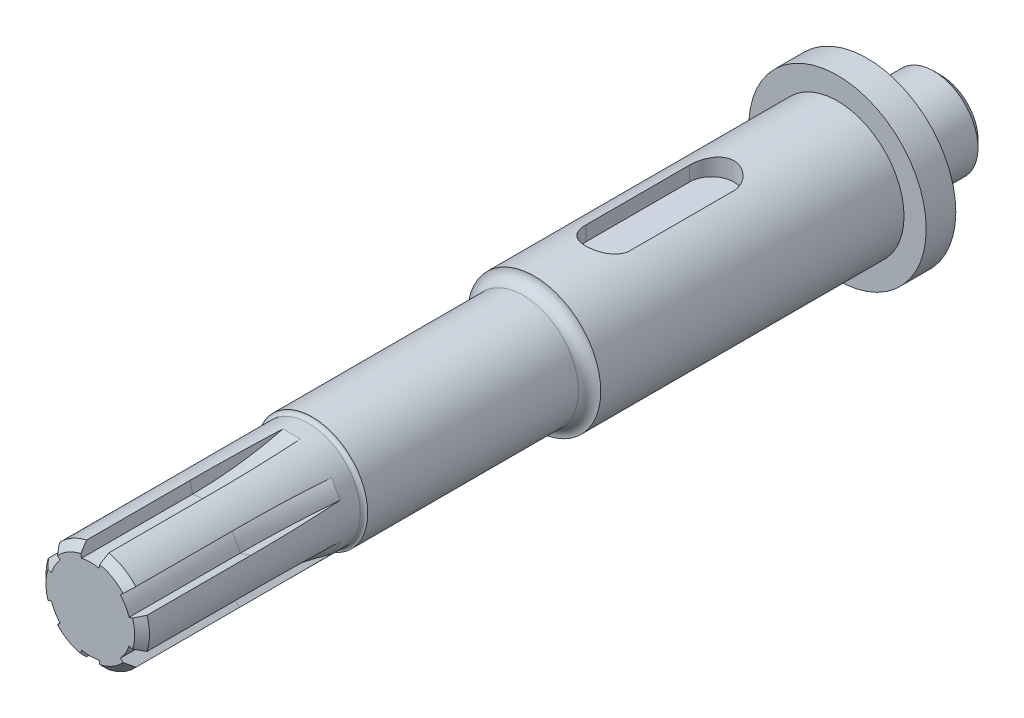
ISO-10303-21;
HEADER;
FILE_DESCRIPTION(('STEP AP214'),'2;1');
FILE_NAME('part.step','',(''),(''),'','','');
FILE_SCHEMA(('AUTOMOTIVE_DESIGN { 1 0 10303 214 1 1 1 1 }'));
ENDSEC;
DATA;
#1=APPLICATION_CONTEXT('core data for automotive mechanical design processes');
#2=APPLICATION_PROTOCOL_DEFINITION('international standard','automotive_design',2000,#1);
#3=PRODUCT_CONTEXT('',#1,'mechanical');
#4=PRODUCT('Part','Part','',(#3));
#5=PRODUCT_RELATED_PRODUCT_CATEGORY('part','',(#4));
#6=PRODUCT_DEFINITION_FORMATION('','',#4);
#7=PRODUCT_DEFINITION_CONTEXT('part definition',#1,'design');
#8=PRODUCT_DEFINITION('design','',#6,#7);
#9=PRODUCT_DEFINITION_SHAPE('','',#8);
#10=(LENGTH_UNIT() NAMED_UNIT(*) SI_UNIT(.MILLI.,.METRE.));
#11=(NAMED_UNIT(*) PLANE_ANGLE_UNIT() SI_UNIT($,.RADIAN.));
#12=(NAMED_UNIT(*) SI_UNIT($,.STERADIAN.) SOLID_ANGLE_UNIT());
#13=UNCERTAINTY_MEASURE_WITH_UNIT(LENGTH_MEASURE(1.E-05),#10,'distance_accuracy_value','');
#14=(GEOMETRIC_REPRESENTATION_CONTEXT(3) GLOBAL_UNCERTAINTY_ASSIGNED_CONTEXT((#13)) GLOBAL_UNIT_ASSIGNED_CONTEXT((#10,
#11,#12)) REPRESENTATION_CONTEXT('',''));
#15=CARTESIAN_POINT('',(0.,0.,0.));
#16=DIRECTION('',(0.,0.,1.));
#17=DIRECTION('',(1.,0.,0.));
#18=AXIS2_PLACEMENT_3D('',#15,#16,#17);
#19=CARTESIAN_POINT('',(0.,0.,115.));
#20=DIRECTION('',(0.,0.,-1.));
#21=DIRECTION('',(-1.,0.,0.));
#22=AXIS2_PLACEMENT_3D('',#19,#20,#21);
#23=CYLINDRICAL_SURFACE('',#22,7.);
#24=CARTESIAN_POINT('',(0.,0.,85.5));
#25=DIRECTION('',(0.,0.,1.));
#26=DIRECTION('',(1.,0.,0.));
#27=AXIS2_PLACEMENT_3D('',#24,#25,#26);
#28=CIRCLE('',#27,7.);
#29=CARTESIAN_POINT('',(7.,0.,85.5));
#30=VERTEX_POINT('',#29);
#31=EDGE_CURVE('E718',#30,#30,#28,.T.);
#32=ORIENTED_EDGE('',*,*,#31,.T.);
#33=EDGE_LOOP('',(#32));
#34=FACE_BOUND('',#33,.T.);
#35=DIRECTION('',(0.,0.,-1.));
#36=VECTOR('',#35,1.);
#37=CARTESIAN_POINT('',(6.67135964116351,2.11966047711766,116.));
#38=LINE('',#37,#36);
#39=CARTESIAN_POINT('',(6.67135964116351,2.11966047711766,114.));
#40=VERTEX_POINT('',#39);
#41=CARTESIAN_POINT('',(6.67135964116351,2.11966047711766,100.));
#42=VERTEX_POINT('',#41);
#43=EDGE_CURVE('E738',#40,#42,#38,.T.);
#44=ORIENTED_EDGE('',*,*,#43,.F.);
#45=CARTESIAN_POINT('',(0.,0.,114.));
#46=DIRECTION('',(0.,0.,1.));
#47=DIRECTION('',(1.,0.,0.));
#48=AXIS2_PLACEMENT_3D('',#45,#46,#47);
#49=CIRCLE('',#48,7.);
#50=CARTESIAN_POINT('',(6.6713596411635,-2.11966047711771,114.));
#51=VERTEX_POINT('',#50);
#52=EDGE_CURVE('E498',#40,#51,#49,.F.);
#53=ORIENTED_EDGE('',*,*,#52,.T.);
#54=DIRECTION('',(0.,0.,-1.));
#55=VECTOR('',#54,1.);
#56=CARTESIAN_POINT('',(6.6713596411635,-2.11966047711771,116.));
#57=LINE('',#56,#55);
#58=CARTESIAN_POINT('',(6.6713596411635,-2.11966047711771,100.));
#59=VERTEX_POINT('',#58);
#60=EDGE_CURVE('E363',#51,#59,#57,.T.);
#61=ORIENTED_EDGE('',*,*,#60,.T.);
#62=CARTESIAN_POINT('',(6.6713596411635,-2.11966047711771,100.));
#63=CARTESIAN_POINT('',(6.67135729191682,-2.11966077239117,99.4992681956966));
#64=CARTESIAN_POINT('',(6.67085200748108,-2.12125851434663,98.9985378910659));
#65=CARTESIAN_POINT('',(6.66883147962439,-2.12760538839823,97.9970919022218));
#66=CARTESIAN_POINT('',(6.66731622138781,-2.13235456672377,97.4963762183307));
#67=CARTESIAN_POINT('',(6.66218112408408,-2.14835981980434,96.2249815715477));
#68=CARTESIAN_POINT('',(6.65786700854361,-2.1617437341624,95.45433063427));
#69=CARTESIAN_POINT('',(6.64949772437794,-2.18729431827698,94.2984951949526));
#70=CARTESIAN_POINT('',(6.64639161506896,-2.19672362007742,93.9132405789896));
#71=CARTESIAN_POINT('',(6.63953821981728,-2.21735254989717,93.1427846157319));
#72=CARTESIAN_POINT('',(6.63579093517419,-2.22855217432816,92.7575832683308));
#73=CARTESIAN_POINT('',(6.62756671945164,-2.25289220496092,91.9871115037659));
#74=CARTESIAN_POINT('',(6.62308952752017,-2.26603330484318,91.6018411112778));
#75=CARTESIAN_POINT('',(6.61339318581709,-2.29417780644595,90.8313786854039));
#76=CARTESIAN_POINT('',(6.6081740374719,-2.30918120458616,90.4461866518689));
#77=CARTESIAN_POINT('',(6.59702156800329,-2.34085202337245,89.6758452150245));
#78=CARTESIAN_POINT('',(6.59108817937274,-2.35751960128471,89.290695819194));
#79=CARTESIAN_POINT('',(6.57852398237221,-2.39235571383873,88.5204763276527));
#80=CARTESIAN_POINT('',(6.57189317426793,-2.41052424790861,88.1354062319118));
#81=CARTESIAN_POINT('',(6.56492183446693,-2.42936232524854,87.7503757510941));
#82=B_SPLINE_CURVE_WITH_KNOTS('',3,(#62,#63,#64,#65,#66,#67,#68,#69,#70,#71,#72,#73,#74,#75,#76,
#77,#78,#79,#80,#81),.UNSPECIFIED.,.F.,.F.,(4,2,2,2,2,2,2,2,2,4),(0.,1.50218977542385,
3.00440158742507,5.31669407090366,6.47283809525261,7.6289797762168,8.78553554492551,
9.94208909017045,11.0987520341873,12.2554145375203),.UNSPECIFIED.);
#83=CARTESIAN_POINT('',(6.56492183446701,-2.42936232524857,87.7503757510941));
#84=VERTEX_POINT('',#83);
#85=EDGE_CURVE('E346',#59,#84,#82,.T.);
#86=ORIENTED_EDGE('',*,*,#85,.T.);
#87=CARTESIAN_POINT('',(6.56492183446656,-2.4293623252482,87.7503757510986));
#88=CARTESIAN_POINT('',(6.53098995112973,-2.52108646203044,87.7716793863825));
#89=CARTESIAN_POINT('',(6.49491536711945,-2.61263779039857,87.7903176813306));
#90=CARTESIAN_POINT('',(6.41858934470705,-2.79489363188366,87.8222405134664));
#91=CARTESIAN_POINT('',(6.37833924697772,-2.88559840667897,87.8355267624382));
#92=CARTESIAN_POINT('',(6.29374666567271,-3.06572401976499,87.8567366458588));
#93=CARTESIAN_POINT('',(6.24940396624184,-3.15514479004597,87.8646599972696));
#94=CARTESIAN_POINT('',(6.15677909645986,-3.33227548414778,87.8751366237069));
#95=CARTESIAN_POINT('',(6.10849584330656,-3.41998492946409,87.877688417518));
#96=CARTESIAN_POINT('',(6.00892723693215,-3.59200907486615,87.8774168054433));
#97=CARTESIAN_POINT('',(5.95769444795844,-3.67635433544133,87.8746694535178));
#98=CARTESIAN_POINT('',(5.85185285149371,-3.84259456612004,87.8639509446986));
#99=CARTESIAN_POINT('',(5.79724301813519,-3.92448878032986,87.8559781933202));
#100=CARTESIAN_POINT('',(5.68481622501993,-4.0856495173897,87.8347887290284));
#101=CARTESIAN_POINT('',(5.62699165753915,-4.16490903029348,87.8215590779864));
#102=CARTESIAN_POINT('',(5.50862502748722,-4.32025690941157,87.7898781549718));
#103=CARTESIAN_POINT('',(5.44808374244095,-4.39634617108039,87.7714283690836));
#104=CARTESIAN_POINT('',(5.38635040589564,-4.47070791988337,87.7503757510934));
#105=B_SPLINE_CURVE_WITH_KNOTS('',3,(#87,#88,#89,#90,#91,#92,#93,#94,#95,#96,#97,#98,#99,#100,
#101,#102,#103,#104),.UNSPECIFIED.,.F.,.F.,(4,2,2,2,2,2,2,2,4),(0.,0.300221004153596,
0.600345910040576,0.900486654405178,1.20071015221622,1.49665685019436,1.79269389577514,
2.08946409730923,2.38614989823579),.UNSPECIFIED.);
#106=CARTESIAN_POINT('',(5.38635040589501,-4.47070791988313,87.7503757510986));
#107=VERTEX_POINT('',#106);
#108=EDGE_CURVE('E333',#84,#107,#105,.T.);
#109=ORIENTED_EDGE('',*,*,#108,.T.);
#110=CARTESIAN_POINT('',(5.38635040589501,-4.47070791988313,87.7503757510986));
#111=CARTESIAN_POINT('',(5.36969322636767,-4.49077781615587,88.2504252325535));
#112=CARTESIAN_POINT('',(5.35372075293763,-4.50979202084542,88.7505418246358));
#113=CARTESIAN_POINT('',(5.32344853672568,-4.54548577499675,89.7509083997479));
#114=CARTESIAN_POINT('',(5.30914879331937,-4.56216532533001,90.2511583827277));
#115=CARTESIAN_POINT('',(5.28252522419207,-4.59296665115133,91.2517957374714));
#116=CARTESIAN_POINT('',(5.27020141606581,-4.60708840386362,91.7521831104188));
#117=CARTESIAN_POINT('',(5.25342209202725,-4.62618941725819,92.5028545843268));
#118=CARTESIAN_POINT('',(5.24811337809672,-4.63220949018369,92.7530936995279));
#119=CARTESIAN_POINT('',(5.23800293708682,-4.64363896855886,93.2535964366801));
#120=CARTESIAN_POINT('',(5.2332012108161,-4.64904837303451,93.5038600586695));
#121=CARTESIAN_POINT('',(5.21922645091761,-4.66474850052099,94.2744859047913));
#122=CARTESIAN_POINT('',(5.21092784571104,-4.6740075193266,94.7948856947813));
#123=CARTESIAN_POINT('',(5.1966448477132,-4.68988219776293,95.835758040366));
#124=CARTESIAN_POINT('',(5.19066046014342,-4.69649785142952,96.3562305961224));
#125=CARTESIAN_POINT('',(5.18105182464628,-4.70709637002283,97.3972405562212));
#126=CARTESIAN_POINT('',(5.17742764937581,-4.71107915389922,97.9177779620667));
#127=CARTESIAN_POINT('',(5.17258152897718,-4.71639717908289,98.9588768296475));
#128=CARTESIAN_POINT('',(5.1713595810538,-4.71773242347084,99.4794382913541));
#129=CARTESIAN_POINT('',(5.17135964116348,-4.71773668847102,100.));
#130=B_SPLINE_CURVE_WITH_KNOTS('',3,(#110,#111,#112,#113,#114,#115,#116,#117,#118,#119,#120,
#121,#122,#123,#124,#125,#126,#127,#128,#129),.UNSPECIFIED.,.F.,.F.,(4,2,2,2,2,2,2,2,2,4),(0.,
1.50218879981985,3.00437703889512,4.5065786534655,5.257680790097,6.00878412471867,
7.57041602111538,9.13205144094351,10.6937349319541,12.2554166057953),.UNSPECIFIED.);
#131=CARTESIAN_POINT('',(5.17135964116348,-4.71773668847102,100.));
#132=VERTEX_POINT('',#131);
#133=EDGE_CURVE('E307',#107,#132,#130,.T.);
#134=ORIENTED_EDGE('',*,*,#133,.T.);
#135=DIRECTION('',(0.,0.,-1.));
#136=VECTOR('',#135,1.);
#137=CARTESIAN_POINT('',(5.17135964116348,-4.71773668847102,116.));
#138=LINE('',#137,#136);
#139=CARTESIAN_POINT('',(5.17135964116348,-4.71773668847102,114.));
#140=VERTEX_POINT('',#139);
#141=EDGE_CURVE('E322',#140,#132,#138,.T.);
#142=ORIENTED_EDGE('',*,*,#141,.F.);
#143=CARTESIAN_POINT('',(0.,0.,114.));
#144=DIRECTION('',(0.,0.,1.));
#145=DIRECTION('',(1.,0.,0.));
#146=AXIS2_PLACEMENT_3D('',#143,#144,#145);
#147=CIRCLE('',#146,7.);
#148=CARTESIAN_POINT('',(1.5,-6.83739716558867,114.));
#149=VERTEX_POINT('',#148);
#150=EDGE_CURVE('E495',#140,#149,#147,.F.);
#151=ORIENTED_EDGE('',*,*,#150,.T.);
#152=DIRECTION('',(0.,0.,-1.));
#153=VECTOR('',#152,1.);
#154=CARTESIAN_POINT('',(1.5,-6.83739716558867,116.));
#155=LINE('',#154,#153);
#156=CARTESIAN_POINT('',(1.5,-6.83739716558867,100.));
#157=VERTEX_POINT('',#156);
#158=EDGE_CURVE('E365',#149,#157,#155,.T.);
#159=ORIENTED_EDGE('',*,*,#158,.T.);
#160=CARTESIAN_POINT('',(1.5,-6.83739716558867,100.));
#161=CARTESIAN_POINT('',(1.49999856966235,-6.8373952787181,99.4992681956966));
#162=CARTESIAN_POINT('',(1.49836224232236,-6.83775656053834,98.9985378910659));
#163=CARTESIAN_POINT('',(1.4918554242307,-6.83918016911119,97.9970919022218));
#164=CARTESIAN_POINT('',(1.48698488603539,-6.84024250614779,97.4963762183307));
#165=CARTESIAN_POINT('',(1.47055638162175,-6.84379800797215,96.2249815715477));
#166=CARTESIAN_POINT('',(1.45680851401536,-6.84675383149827,95.45433063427));
#167=CARTESIAN_POINT('',(1.43049641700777,-6.8522811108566,94.2984951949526));
#168=CARTESIAN_POINT('',(1.42077734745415,-6.85430579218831,93.9132405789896));
#169=CARTESIAN_POINT('',(1.39948547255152,-6.85868504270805,93.1427846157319));
#170=CARTESIAN_POINT('',(1.3879126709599,-6.86103961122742,92.7575832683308));
#171=CARTESIAN_POINT('',(1.36272147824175,-6.86608724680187,91.9871115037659));
#172=CARTESIAN_POINT('',(1.34910235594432,-6.86878043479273,91.6018411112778));
#173=CARTESIAN_POINT('',(1.31988033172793,-6.87445540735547,90.8313786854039));
#174=CARTESIAN_POINT('',(1.30427743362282,-6.87743719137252,90.4461866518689));
#175=CARTESIAN_POINT('',(1.27127346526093,-6.88361427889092,89.6758452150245));
#176=CARTESIAN_POINT('',(1.25387222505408,-6.88680960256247,89.290695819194));
#177=CARTESIAN_POINT('',(1.21742116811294,-6.89334674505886,88.5204763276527));
#178=CARTESIAN_POINT('',(1.19837135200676,-6.89668856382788,88.1354062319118));
#179=CARTESIAN_POINT('',(1.17857142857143,-6.90007024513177,87.7503757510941));
#180=B_SPLINE_CURVE_WITH_KNOTS('',3,(#160,#161,#162,#163,#164,#165,#166,#167,#168,#169,#170,
#171,#172,#173,#174,#175,#176,#177,#178,#179),.UNSPECIFIED.,.F.,.F.,(4,2,2,2,2,2,2,2,2,4),(0.,
1.50218977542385,3.00440158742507,5.31669407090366,6.47283809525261,7.6289797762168,
8.78553554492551,9.94208909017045,11.0987520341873,12.2554145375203),.UNSPECIFIED.);
#181=CARTESIAN_POINT('',(1.17857142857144,-6.90007024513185,87.7503757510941));
#182=VERTEX_POINT('',#181);
#183=EDGE_CURVE('E961',#157,#182,#180,.T.);
#184=ORIENTED_EDGE('',*,*,#183,.T.);
#185=CARTESIAN_POINT('',(1.17857142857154,-6.90007024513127,87.7503757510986));
#186=CARTESIAN_POINT('',(1.08217005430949,-6.91654644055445,87.7716793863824));
#187=CARTESIAN_POINT('',(0.984846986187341,-6.93108059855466,87.7903176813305));
#188=CARTESIAN_POINT('',(0.788845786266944,-6.95610824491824,87.8222405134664));
#189=CARTESIAN_POINT('',(0.690168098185,-6.96660302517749,87.8355267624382));
#190=CARTESIAN_POINT('',(0.491878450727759,-6.98340650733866,87.8567366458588));
#191=CARTESIAN_POINT('',(0.392266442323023,-6.98971498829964,87.8646599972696));
#192=CARTESIAN_POINT('',(0.192554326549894,-6.99806484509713,87.8751366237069));
#193=CARTESIAN_POINT('',(0.0924540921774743,-7.00010504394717,87.877688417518));
#194=CARTESIAN_POINT('',(-0.106307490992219,-6.99988817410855,87.8774168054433));
#195=CARTESIAN_POINT('',(-0.204969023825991,-6.99769190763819,87.8746694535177));
#196=CARTESIAN_POINT('',(-0.401858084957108,-6.98915051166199,87.8639509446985));
#197=CARTESIAN_POINT('',(-0.500085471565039,-6.98280411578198,87.8559781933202));
#198=CARTESIAN_POINT('',(-0.695868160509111,-6.96602002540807,87.8347887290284));
#199=CARTESIAN_POINT('',(-0.793421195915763,-6.95557223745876,87.8215590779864));
#200=CARTESIAN_POINT('',(-0.987139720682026,-6.93073766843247,87.7898781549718));
#201=CARTESIAN_POINT('',(-1.08330559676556,-6.91635200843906,87.7714283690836));
#202=CARTESIAN_POINT('',(-1.17857142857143,-6.90007024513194,87.7503757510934));
#203=B_SPLINE_CURVE_WITH_KNOTS('',3,(#185,#186,#187,#188,#189,#190,#191,#192,#193,#194,#195,
#196,#197,#198,#199,#200,#201,#202),.UNSPECIFIED.,.F.,.F.,(4,2,2,2,2,2,2,2,4),(0.,
0.300221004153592,0.600345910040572,0.900486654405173,1.20071015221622,1.49665685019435,
1.79269389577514,2.08946409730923,2.38614989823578),.UNSPECIFIED.);
#204=CARTESIAN_POINT('',(-1.17857142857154,-6.90007024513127,87.7503757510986));
#205=VERTEX_POINT('',#204);
#206=EDGE_CURVE('E953',#182,#205,#203,.T.);
#207=ORIENTED_EDGE('',*,*,#206,.T.);
#208=CARTESIAN_POINT('',(-1.17857142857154,-6.90007024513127,87.7503757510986));
#209=CARTESIAN_POINT('',(-1.20428105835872,-6.89567965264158,88.2504252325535));
#210=CARTESIAN_POINT('',(-1.22873407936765,-6.89135418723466,88.7505418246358));
#211=CARTESIAN_POINT('',(-1.27478188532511,-6.88298455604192,89.7509083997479));
#212=CARTESIAN_POINT('',(-1.29637667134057,-6.87894039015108,90.2511583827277));
#213=CARTESIAN_POINT('',(-1.33636318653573,-6.87128436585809,91.2517957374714));
#214=CARTESIAN_POINT('',(-1.35475488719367,-6.86767251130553,91.7521831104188));
#215=CARTESIAN_POINT('',(-1.37968651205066,-6.86269169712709,92.5028545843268));
#216=CARTESIAN_POINT('',(-1.38755440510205,-6.86110425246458,92.7530936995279));
#217=CARTESIAN_POINT('',(-1.4025078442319,-6.85806309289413,93.2535964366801));
#218=CARTESIAN_POINT('',(-1.40959338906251,-6.85660937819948,93.5038600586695));
#219=CARTESIAN_POINT('',(-1.43017747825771,-6.85235694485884,94.2744859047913));
#220=CARTESIAN_POINT('',(-1.44234532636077,-6.84979965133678,94.7948856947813));
#221=CARTESIAN_POINT('',(-1.46323470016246,-6.84536755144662,95.835758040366));
#222=CARTESIAN_POINT('',(-1.47195621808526,-6.84349274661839,96.3562305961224));
#223=CARTESIAN_POINT('',(-1.48593912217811,-6.84047068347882,97.3972405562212));
#224=CARTESIAN_POINT('',(-1.49120040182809,-6.83932344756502,97.9177779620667));
#225=CARTESIAN_POINT('',(-1.49822900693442,-6.83778559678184,98.9588768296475));
#226=CARTESIAN_POINT('',(-1.49999633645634,-6.83739498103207,99.4794382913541));
#227=CARTESIAN_POINT('',(-1.5,-6.83739716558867,100.));
#228=B_SPLINE_CURVE_WITH_KNOTS('',3,(#208,#209,#210,#211,#212,#213,#214,#215,#216,#217,#218,
#219,#220,#221,#222,#223,#224,#225,#226,#227),.UNSPECIFIED.,.F.,.F.,(4,2,2,2,2,2,2,2,2,4),(0.,
1.50218879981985,3.00437703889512,4.5065786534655,5.257680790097,6.00878412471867,
7.57041602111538,9.13205144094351,10.6937349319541,12.2554166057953),.UNSPECIFIED.);
#229=CARTESIAN_POINT('',(-1.5,-6.83739716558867,100.));
#230=VERTEX_POINT('',#229);
#231=EDGE_CURVE('E935',#205,#230,#228,.T.);
#232=ORIENTED_EDGE('',*,*,#231,.T.);
#233=DIRECTION('',(0.,0.,-1.));
#234=VECTOR('',#233,1.);
#235=CARTESIAN_POINT('',(-1.5,-6.83739716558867,116.));
#236=LINE('',#235,#234);
#237=CARTESIAN_POINT('',(-1.5,-6.83739716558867,114.));
#238=VERTEX_POINT('',#237);
#239=EDGE_CURVE('E370',#238,#230,#236,.T.);
#240=ORIENTED_EDGE('',*,*,#239,.F.);
#241=CARTESIAN_POINT('',(0.,0.,114.));
#242=DIRECTION('',(0.,0.,1.));
#243=DIRECTION('',(1.,0.,0.));
#244=AXIS2_PLACEMENT_3D('',#241,#242,#243);
#245=CIRCLE('',#244,7.);
#246=CARTESIAN_POINT('',(-5.17135964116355,-4.71773668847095,114.));
#247=VERTEX_POINT('',#246);
#248=EDGE_CURVE('E67',#238,#247,#245,.F.);
#249=ORIENTED_EDGE('',*,*,#248,.T.);
#250=DIRECTION('',(0.,0.,-1.));
#251=VECTOR('',#250,1.);
#252=CARTESIAN_POINT('',(-5.17135964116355,-4.71773668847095,116.));
#253=LINE('',#252,#251);
#254=CARTESIAN_POINT('',(-5.17135964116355,-4.71773668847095,100.));
#255=VERTEX_POINT('',#254);
#256=EDGE_CURVE('E482',#247,#255,#253,.T.);
#257=ORIENTED_EDGE('',*,*,#256,.T.);
#258=CARTESIAN_POINT('',(-5.17135964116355,-4.71773668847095,100.));
#259=CARTESIAN_POINT('',(-5.17135872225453,-4.71773450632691,99.4992681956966));
#260=CARTESIAN_POINT('',(-5.17248976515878,-4.7164980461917,98.9985378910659));
#261=CARTESIAN_POINT('',(-5.17697605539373,-4.71157478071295,97.9970919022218));
#262=CARTESIAN_POINT('',(-5.18033133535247,-4.707887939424,97.4963762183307));
#263=CARTESIAN_POINT('',(-5.19162474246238,-4.69543818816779,96.2249815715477));
#264=CARTESIAN_POINT('',(-5.2010584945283,-4.68501009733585,95.45433063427));
#265=CARTESIAN_POINT('',(-5.21900130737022,-4.6649867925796,94.2984951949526));
#266=CARTESIAN_POINT('',(-5.22561426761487,-4.65758217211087,93.9132405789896));
#267=CARTESIAN_POINT('',(-5.24005274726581,-4.64133249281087,93.1427846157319));
#268=CARTESIAN_POINT('',(-5.24787826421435,-4.63248743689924,92.7575832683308));
#269=CARTESIAN_POINT('',(-5.26484524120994,-4.61319504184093,91.9871115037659));
#270=CARTESIAN_POINT('',(-5.27398717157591,-4.60274712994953,91.6018411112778));
#271=CARTESIAN_POINT('',(-5.29351285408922,-4.5802776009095,90.8313786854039));
#272=CARTESIAN_POINT('',(-5.30389660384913,-4.56825598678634,90.4461866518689));
#273=CARTESIAN_POINT('',(-5.32574810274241,-4.54276225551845,89.6758452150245));
#274=CARTESIAN_POINT('',(-5.33721595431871,-4.52929000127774,89.290695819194));
#275=CARTESIAN_POINT('',(-5.36110281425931,-4.50099103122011,88.5204763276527));
#276=CARTESIAN_POINT('',(-5.37352182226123,-4.48616431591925,88.1354062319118));
#277=CARTESIAN_POINT('',(-5.38635040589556,-4.47070791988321,87.7503757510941));
#278=B_SPLINE_CURVE_WITH_KNOTS('',3,(#258,#259,#260,#261,#262,#263,#264,#265,#266,#267,#268,
#269,#270,#271,#272,#273,#274,#275,#276,#277),.UNSPECIFIED.,.F.,.F.,(4,2,2,2,2,2,2,2,2,4),(0.,
1.50218977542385,3.00440158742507,5.31669407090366,6.47283809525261,7.6289797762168,
8.78553554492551,9.94208909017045,11.0987520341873,12.2554145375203),.UNSPECIFIED.);
#279=CARTESIAN_POINT('',(-5.38635040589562,-4.47070791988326,87.7503757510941));
#280=VERTEX_POINT('',#279);
#281=EDGE_CURVE('E449',#255,#280,#278,.T.);
#282=ORIENTED_EDGE('',*,*,#281,.T.);
#283=CARTESIAN_POINT('',(-5.38635040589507,-4.47070791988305,87.7503757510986));
#284=CARTESIAN_POINT('',(-5.44881989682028,-4.39545997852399,87.7716793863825));
#285=CARTESIAN_POINT('',(-5.51006838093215,-4.31844280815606,87.7903176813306));
#286=CARTESIAN_POINT('',(-5.62974355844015,-4.16121461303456,87.8222405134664));
#287=CARTESIAN_POINT('',(-5.68817114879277,-4.0810046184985,87.8355267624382));
#288=CARTESIAN_POINT('',(-5.801868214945,-3.91768248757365,87.8567366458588));
#289=CARTESIAN_POINT('',(-5.85713752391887,-3.83457019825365,87.8646599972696));
#290=CARTESIAN_POINT('',(-5.96422476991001,-3.66578936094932,87.875136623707));
#291=CARTESIAN_POINT('',(-6.01604175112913,-3.58012011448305,87.877688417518));
#292=CARTESIAN_POINT('',(-6.11523472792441,-3.40787909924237,87.8774168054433));
#293=CARTESIAN_POINT('',(-6.16266347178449,-3.32133757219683,87.8746694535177));
#294=CARTESIAN_POINT('',(-6.25371093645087,-3.14655594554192,87.8639509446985));
#295=CARTESIAN_POINT('',(-6.29732848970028,-3.05831533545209,87.8559781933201));
#296=CARTESIAN_POINT('',(-6.38068438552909,-2.88037050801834,87.8347887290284));
#297=CARTESIAN_POINT('',(-6.42041285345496,-2.79066320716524,87.8215590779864));
#298=CARTESIAN_POINT('',(-6.49576474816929,-2.61048075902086,87.7898781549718));
#299=CARTESIAN_POINT('',(-6.53138933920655,-2.52000583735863,87.7714283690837));
#300=CARTESIAN_POINT('',(-6.56492183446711,-2.42936232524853,87.7503757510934));
#301=B_SPLINE_CURVE_WITH_KNOTS('',3,(#283,#284,#285,#286,#287,#288,#289,#290,#291,#292,#293,
#294,#295,#296,#297,#298,#299,#300),.UNSPECIFIED.,.F.,.F.,(4,2,2,2,2,2,2,2,4),(0.,
0.300221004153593,0.600345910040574,0.900486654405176,1.20071015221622,1.49665685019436,
1.79269389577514,2.08946409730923,2.38614989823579),.UNSPECIFIED.);
#302=CARTESIAN_POINT('',(-6.56492183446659,-2.42936232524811,87.7503757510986));
#303=VERTEX_POINT('',#302);
#304=EDGE_CURVE('E412',#280,#303,#301,.T.);
#305=ORIENTED_EDGE('',*,*,#304,.T.);
#306=CARTESIAN_POINT('',(-6.56492183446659,-2.42936232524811,87.7503757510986));
#307=CARTESIAN_POINT('',(-6.57397428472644,-2.40490183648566,88.2504252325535));
#308=CARTESIAN_POINT('',(-6.58245483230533,-2.3815621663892,88.7505418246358));
#309=CARTESIAN_POINT('',(-6.59823042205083,-2.33749878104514,89.7509083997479));
#310=CARTESIAN_POINT('',(-6.60552546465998,-2.31677506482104,90.2511583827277));
#311=CARTESIAN_POINT('',(-6.61888841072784,-2.27831771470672,91.2517957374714));
#312=CARTESIAN_POINT('',(-6.62495630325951,-2.26058410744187,91.7521831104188));
#313=CARTESIAN_POINT('',(-6.63310860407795,-2.23650227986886,92.5028545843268));
#314=CARTESIAN_POINT('',(-6.63566778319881,-2.22889476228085,92.7530936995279));
#315=CARTESIAN_POINT('',(-6.64051078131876,-2.21442412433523,93.2535964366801));
#316=CARTESIAN_POINT('',(-6.64279459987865,-2.20756100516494,93.5038600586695));
#317=CARTESIAN_POINT('',(-6.64940392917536,-2.18760844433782,94.2744859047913));
#318=CARTESIAN_POINT('',(-6.65327317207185,-2.17579213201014,94.7948856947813));
#319=CARTESIAN_POINT('',(-6.6598795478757,-2.15548535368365,95.835758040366));
#320=CARTESIAN_POINT('',(-6.66261667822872,-2.14699489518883,96.3562305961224));
#321=CARTESIAN_POINT('',(-6.66699094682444,-2.13337431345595,97.3972405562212));
#322=CARTESIAN_POINT('',(-6.66862805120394,-2.12824429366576,97.9177779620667));
#323=CARTESIAN_POINT('',(-6.67081053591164,-2.12138841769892,98.9588768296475));
#324=CARTESIAN_POINT('',(-6.67135591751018,-2.1196625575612,99.4794382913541));
#325=CARTESIAN_POINT('',(-6.67135964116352,-2.11966047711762,100.));
#326=B_SPLINE_CURVE_WITH_KNOTS('',3,(#306,#307,#308,#309,#310,#311,#312,#313,#314,#315,#316,
#317,#318,#319,#320,#321,#322,#323,#324,#325),.UNSPECIFIED.,.F.,.F.,(4,2,2,2,2,2,2,2,2,4),(0.,
1.50218879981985,3.00437703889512,4.50657865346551,5.257680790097,6.00878412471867,
7.57041602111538,9.13205144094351,10.6937349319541,12.2554166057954),.UNSPECIFIED.);
#327=CARTESIAN_POINT('',(-6.67135964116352,-2.11966047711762,100.));
#328=VERTEX_POINT('',#327);
#329=EDGE_CURVE('E377',#303,#328,#326,.T.);
#330=ORIENTED_EDGE('',*,*,#329,.T.);
#331=DIRECTION('',(0.,0.,-1.));
#332=VECTOR('',#331,1.);
#333=CARTESIAN_POINT('',(-6.67135964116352,-2.11966047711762,116.));
#334=LINE('',#333,#332);
#335=CARTESIAN_POINT('',(-6.67135964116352,-2.11966047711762,114.));
#336=VERTEX_POINT('',#335);
#337=EDGE_CURVE('E471',#336,#328,#334,.T.);
#338=ORIENTED_EDGE('',*,*,#337,.F.);
#339=CARTESIAN_POINT('',(0.,0.,114.));
#340=DIRECTION('',(0.,0.,1.));
#341=DIRECTION('',(1.,0.,0.));
#342=AXIS2_PLACEMENT_3D('',#339,#340,#341);
#343=CIRCLE('',#342,7.);
#344=CARTESIAN_POINT('',(-6.67135964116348,2.11966047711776,114.));
#345=VERTEX_POINT('',#344);
#346=EDGE_CURVE('E490',#336,#345,#343,.F.);
#347=ORIENTED_EDGE('',*,*,#346,.T.);
#348=DIRECTION('',(0.,0.,-1.));
#349=VECTOR('',#348,1.);
#350=CARTESIAN_POINT('',(-6.67135964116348,2.11966047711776,116.));
#351=LINE('',#350,#349);
#352=CARTESIAN_POINT('',(-6.67135964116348,2.11966047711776,100.));
#353=VERTEX_POINT('',#352);
#354=EDGE_CURVE('E388',#345,#353,#351,.T.);
#355=ORIENTED_EDGE('',*,*,#354,.T.);
#356=CARTESIAN_POINT('',(-6.67135964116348,2.11966047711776,100.));
#357=CARTESIAN_POINT('',(-6.6713572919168,2.11966077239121,99.4992681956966));
#358=CARTESIAN_POINT('',(-6.67085200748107,2.12125851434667,98.9985378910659));
#359=CARTESIAN_POINT('',(-6.66883147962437,2.12760538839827,97.9970919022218));
#360=CARTESIAN_POINT('',(-6.66731622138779,2.13235456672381,97.4963762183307));
#361=CARTESIAN_POINT('',(-6.66218112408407,2.14835981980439,96.2249815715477));
#362=CARTESIAN_POINT('',(-6.6578670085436,2.16174373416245,95.45433063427));
#363=CARTESIAN_POINT('',(-6.64949772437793,2.18729431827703,94.2984951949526));
#364=CARTESIAN_POINT('',(-6.64639161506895,2.19672362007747,93.9132405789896));
#365=CARTESIAN_POINT('',(-6.63953821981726,2.21735254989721,93.1427846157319));
#366=CARTESIAN_POINT('',(-6.63579093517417,2.2285521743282,92.7575832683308));
#367=CARTESIAN_POINT('',(-6.62756671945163,2.25289220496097,91.9871115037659));
#368=CARTESIAN_POINT('',(-6.62308952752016,2.26603330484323,91.6018411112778));
#369=CARTESIAN_POINT('',(-6.61339318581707,2.294177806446,90.8313786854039));
#370=CARTESIAN_POINT('',(-6.60817403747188,2.30918120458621,90.4461866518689));
#371=CARTESIAN_POINT('',(-6.59702156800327,2.34085202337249,89.6758452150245));
#372=CARTESIAN_POINT('',(-6.59108817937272,2.35751960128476,89.290695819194));
#373=CARTESIAN_POINT('',(-6.57852398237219,2.39235571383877,88.5204763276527));
#374=CARTESIAN_POINT('',(-6.57189317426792,2.41052424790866,88.1354062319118));
#375=CARTESIAN_POINT('',(-6.56492183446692,2.42936232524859,87.7503757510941));
#376=B_SPLINE_CURVE_WITH_KNOTS('',3,(#356,#357,#358,#359,#360,#361,#362,#363,#364,#365,#366,
#367,#368,#369,#370,#371,#372,#373,#374,#375),.UNSPECIFIED.,.F.,.F.,(4,2,2,2,2,2,2,2,2,4),(0.,
1.50218977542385,3.00440158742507,5.31669407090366,6.47283809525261,7.6289797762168,
8.78553554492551,9.94208909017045,11.0987520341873,12.2554145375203),.UNSPECIFIED.);
#377=CARTESIAN_POINT('',(-6.56492183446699,2.42936232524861,87.7503757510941));
#378=VERTEX_POINT('',#377);
#379=EDGE_CURVE('E815',#353,#378,#376,.T.);
#380=ORIENTED_EDGE('',*,*,#379,.T.);
#381=CARTESIAN_POINT('',(-6.56492183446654,2.42936232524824,87.7503757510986));
#382=CARTESIAN_POINT('',(-6.53098995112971,2.52108646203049,87.7716793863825));
#383=CARTESIAN_POINT('',(-6.49491536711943,2.61263779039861,87.7903176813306));
#384=CARTESIAN_POINT('',(-6.41858934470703,2.79489363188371,87.8222405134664));
#385=CARTESIAN_POINT('',(-6.3783392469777,2.88559840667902,87.8355267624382));
#386=CARTESIAN_POINT('',(-6.29374666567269,3.06572401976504,87.8567366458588));
#387=CARTESIAN_POINT('',(-6.24940396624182,3.15514479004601,87.8646599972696));
#388=CARTESIAN_POINT('',(-6.15677909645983,3.33227548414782,87.8751366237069));
#389=CARTESIAN_POINT('',(-6.10849584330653,3.41998492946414,87.877688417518));
#390=CARTESIAN_POINT('',(-6.00892723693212,3.59200907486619,87.8774168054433));
#391=CARTESIAN_POINT('',(-5.95769444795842,3.67635433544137,87.8746694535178));
#392=CARTESIAN_POINT('',(-5.85185285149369,3.84259456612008,87.8639509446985));
#393=CARTESIAN_POINT('',(-5.79724301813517,3.9244887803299,87.8559781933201));
#394=CARTESIAN_POINT('',(-5.68481622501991,4.08564951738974,87.8347887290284));
#395=CARTESIAN_POINT('',(-5.62699165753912,4.16490903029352,87.8215590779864));
#396=CARTESIAN_POINT('',(-5.50862502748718,4.32025690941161,87.7898781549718));
#397=CARTESIAN_POINT('',(-5.44808374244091,4.39634617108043,87.7714283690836));
#398=CARTESIAN_POINT('',(-5.38635040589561,4.47070791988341,87.7503757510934));
#399=B_SPLINE_CURVE_WITH_KNOTS('',3,(#381,#382,#383,#384,#385,#386,#387,#388,#389,#390,#391,
#392,#393,#394,#395,#396,#397,#398),.UNSPECIFIED.,.F.,.F.,(4,2,2,2,2,2,2,2,4),(0.,
0.300221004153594,0.600345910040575,0.900486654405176,1.20071015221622,1.49665685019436,
1.79269389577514,2.08946409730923,2.38614989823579),.UNSPECIFIED.);
#400=CARTESIAN_POINT('',(-5.38635040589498,4.47070791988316,87.7503757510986));
#401=VERTEX_POINT('',#400);
#402=EDGE_CURVE('E850',#378,#401,#399,.T.);
#403=ORIENTED_EDGE('',*,*,#402,.T.);
#404=CARTESIAN_POINT('',(-5.38635040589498,4.47070791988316,87.7503757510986));
#405=CARTESIAN_POINT('',(-5.36969322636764,4.49077781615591,88.2504252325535));
#406=CARTESIAN_POINT('',(-5.3537207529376,4.50979202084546,88.7505418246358));
#407=CARTESIAN_POINT('',(-5.32344853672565,4.54548577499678,89.7509083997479));
#408=CARTESIAN_POINT('',(-5.30914879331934,4.56216532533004,90.2511583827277));
#409=CARTESIAN_POINT('',(-5.28252522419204,4.59296665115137,91.2517957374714));
#410=CARTESIAN_POINT('',(-5.27020141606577,4.60708840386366,91.7521831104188));
#411=CARTESIAN_POINT('',(-5.25342209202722,4.62618941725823,92.5028545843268));
#412=CARTESIAN_POINT('',(-5.24811337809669,4.63220949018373,92.7530936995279));
#413=CARTESIAN_POINT('',(-5.23800293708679,4.6436389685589,93.2535964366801));
#414=CARTESIAN_POINT('',(-5.23320121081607,4.64904837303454,93.5038600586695));
#415=CARTESIAN_POINT('',(-5.21922645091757,4.66474850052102,94.2744859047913));
#416=CARTESIAN_POINT('',(-5.210927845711,4.67400751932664,94.7948856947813));
#417=CARTESIAN_POINT('',(-5.19664484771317,4.68988219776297,95.835758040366));
#418=CARTESIAN_POINT('',(-5.19066046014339,4.69649785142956,96.3562305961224));
#419=CARTESIAN_POINT('',(-5.18105182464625,4.70709637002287,97.3972405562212));
#420=CARTESIAN_POINT('',(-5.17742764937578,4.71107915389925,97.9177779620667));
#421=CARTESIAN_POINT('',(-5.17258152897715,4.71639717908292,98.9588768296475));
#422=CARTESIAN_POINT('',(-5.17135958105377,4.71773242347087,99.4794382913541));
#423=CARTESIAN_POINT('',(-5.17135964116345,4.71773668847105,100.));
#424=B_SPLINE_CURVE_WITH_KNOTS('',3,(#404,#405,#406,#407,#408,#409,#410,#411,#412,#413,#414,
#415,#416,#417,#418,#419,#420,#421,#422,#423),.UNSPECIFIED.,.F.,.F.,(4,2,2,2,2,2,2,2,2,4),(0.,
1.50218879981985,3.00437703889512,4.5065786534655,5.257680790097,6.00878412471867,
7.57041602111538,9.13205144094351,10.6937349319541,12.2554166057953),.UNSPECIFIED.);
#425=CARTESIAN_POINT('',(-5.17135964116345,4.71773668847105,100.));
#426=VERTEX_POINT('',#425);
#427=EDGE_CURVE('E844',#401,#426,#424,.T.);
#428=ORIENTED_EDGE('',*,*,#427,.T.);
#429=DIRECTION('',(0.,0.,-1.));
#430=VECTOR('',#429,1.);
#431=CARTESIAN_POINT('',(-5.17135964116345,4.71773668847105,116.));
#432=LINE('',#431,#430);
#433=CARTESIAN_POINT('',(-5.17135964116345,4.71773668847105,114.));
#434=VERTEX_POINT('',#433);
#435=EDGE_CURVE('E773',#434,#426,#432,.T.);
#436=ORIENTED_EDGE('',*,*,#435,.F.);
#437=CARTESIAN_POINT('',(0.,0.,114.));
#438=DIRECTION('',(0.,0.,1.));
#439=DIRECTION('',(1.,0.,0.));
#440=AXIS2_PLACEMENT_3D('',#437,#438,#439);
#441=CIRCLE('',#440,7.);
#442=CARTESIAN_POINT('',(-1.5,6.83739716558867,114.));
#443=VERTEX_POINT('',#442);
#444=EDGE_CURVE('E486',#434,#443,#441,.F.);
#445=ORIENTED_EDGE('',*,*,#444,.T.);
#446=DIRECTION('',(0.,0.,-1.));
#447=VECTOR('',#446,1.);
#448=CARTESIAN_POINT('',(-1.5,6.83739716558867,116.));
#449=LINE('',#448,#447);
#450=CARTESIAN_POINT('',(-1.5,6.83739716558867,100.));
#451=VERTEX_POINT('',#450);
#452=EDGE_CURVE('E696',#443,#451,#449,.T.);
#453=ORIENTED_EDGE('',*,*,#452,.T.);
#454=CARTESIAN_POINT('',(-1.5,6.83739716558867,100.));
#455=CARTESIAN_POINT('',(-1.49999856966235,6.8373952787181,99.4992681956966));
#456=CARTESIAN_POINT('',(-1.49836224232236,6.83775656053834,98.9985378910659));
#457=CARTESIAN_POINT('',(-1.4918554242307,6.83918016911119,97.9970919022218));
#458=CARTESIAN_POINT('',(-1.48698488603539,6.84024250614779,97.4963762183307));
#459=CARTESIAN_POINT('',(-1.47055638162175,6.84379800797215,96.2249815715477));
#460=CARTESIAN_POINT('',(-1.45680851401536,6.84675383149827,95.45433063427));
#461=CARTESIAN_POINT('',(-1.43049641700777,6.8522811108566,94.2984951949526));
#462=CARTESIAN_POINT('',(-1.42077734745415,6.85430579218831,93.9132405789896));
#463=CARTESIAN_POINT('',(-1.39948547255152,6.85868504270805,93.1427846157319));
#464=CARTESIAN_POINT('',(-1.3879126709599,6.86103961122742,92.7575832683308));
#465=CARTESIAN_POINT('',(-1.36272147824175,6.86608724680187,91.9871115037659));
#466=CARTESIAN_POINT('',(-1.34910235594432,6.86878043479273,91.6018411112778));
#467=CARTESIAN_POINT('',(-1.31988033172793,6.87445540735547,90.8313786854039));
#468=CARTESIAN_POINT('',(-1.30427743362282,6.87743719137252,90.4461866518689));
#469=CARTESIAN_POINT('',(-1.27127346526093,6.88361427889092,89.6758452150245));
#470=CARTESIAN_POINT('',(-1.25387222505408,6.88680960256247,89.290695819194));
#471=CARTESIAN_POINT('',(-1.21742116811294,6.89334674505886,88.5204763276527));
#472=CARTESIAN_POINT('',(-1.19837135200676,6.89668856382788,88.1354062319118));
#473=CARTESIAN_POINT('',(-1.17857142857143,6.90007024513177,87.7503757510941));
#474=B_SPLINE_CURVE_WITH_KNOTS('',3,(#454,#455,#456,#457,#458,#459,#460,#461,#462,#463,#464,
#465,#466,#467,#468,#469,#470,#471,#472,#473),.UNSPECIFIED.,.F.,.F.,(4,2,2,2,2,2,2,2,2,4),(0.,
1.50218977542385,3.00440158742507,5.31669407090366,6.47283809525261,7.6289797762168,
8.78553554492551,9.94208909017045,11.0987520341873,12.2554145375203),.UNSPECIFIED.);
#475=CARTESIAN_POINT('',(-1.17857142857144,6.90007024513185,87.7503757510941));
#476=VERTEX_POINT('',#475);
#477=EDGE_CURVE('E626',#451,#476,#474,.T.);
#478=ORIENTED_EDGE('',*,*,#477,.T.);
#479=CARTESIAN_POINT('',(-1.17857142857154,6.90007024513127,87.7503757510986));
#480=CARTESIAN_POINT('',(-1.08217005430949,6.91654644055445,87.7716793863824));
#481=CARTESIAN_POINT('',(-0.984846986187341,6.93108059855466,87.7903176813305));
#482=CARTESIAN_POINT('',(-0.788845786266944,6.95610824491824,87.8222405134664));
#483=CARTESIAN_POINT('',(-0.690168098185,6.96660302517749,87.8355267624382));
#484=CARTESIAN_POINT('',(-0.491878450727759,6.98340650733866,87.8567366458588));
#485=CARTESIAN_POINT('',(-0.392266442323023,6.98971498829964,87.8646599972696));
#486=CARTESIAN_POINT('',(-0.192554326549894,6.99806484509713,87.8751366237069));
#487=CARTESIAN_POINT('',(-0.0924540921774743,7.00010504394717,87.877688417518));
#488=CARTESIAN_POINT('',(0.106307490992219,6.99988817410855,87.8774168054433));
#489=CARTESIAN_POINT('',(0.204969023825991,6.99769190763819,87.8746694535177));
#490=CARTESIAN_POINT('',(0.401858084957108,6.98915051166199,87.8639509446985));
#491=CARTESIAN_POINT('',(0.500085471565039,6.98280411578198,87.8559781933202));
#492=CARTESIAN_POINT('',(0.695868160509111,6.96602002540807,87.8347887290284));
#493=CARTESIAN_POINT('',(0.793421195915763,6.95557223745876,87.8215590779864));
#494=CARTESIAN_POINT('',(0.987139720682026,6.93073766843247,87.7898781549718));
#495=CARTESIAN_POINT('',(1.08330559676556,6.91635200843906,87.7714283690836));
#496=CARTESIAN_POINT('',(1.17857142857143,6.90007024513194,87.7503757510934));
#497=B_SPLINE_CURVE_WITH_KNOTS('',3,(#479,#480,#481,#482,#483,#484,#485,#486,#487,#488,#489,
#490,#491,#492,#493,#494,#495,#496),.UNSPECIFIED.,.F.,.F.,(4,2,2,2,2,2,2,2,4),(0.,
0.300221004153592,0.600345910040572,0.900486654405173,1.20071015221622,1.49665685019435,
1.79269389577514,2.08946409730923,2.38614989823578),.UNSPECIFIED.);
#498=CARTESIAN_POINT('',(1.17857142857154,6.90007024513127,87.7503757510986));
#499=VERTEX_POINT('',#498);
#500=EDGE_CURVE('E633',#476,#499,#497,.T.);
#501=ORIENTED_EDGE('',*,*,#500,.T.);
#502=CARTESIAN_POINT('',(1.17857142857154,6.90007024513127,87.7503757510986));
#503=CARTESIAN_POINT('',(1.20428105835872,6.89567965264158,88.2504252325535));
#504=CARTESIAN_POINT('',(1.22873407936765,6.89135418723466,88.7505418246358));
#505=CARTESIAN_POINT('',(1.27478188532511,6.88298455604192,89.7509083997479));
#506=CARTESIAN_POINT('',(1.29637667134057,6.87894039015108,90.2511583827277));
#507=CARTESIAN_POINT('',(1.33636318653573,6.87128436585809,91.2517957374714));
#508=CARTESIAN_POINT('',(1.35475488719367,6.86767251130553,91.7521831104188));
#509=CARTESIAN_POINT('',(1.37968651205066,6.86269169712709,92.5028545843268));
#510=CARTESIAN_POINT('',(1.38755440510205,6.86110425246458,92.7530936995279));
#511=CARTESIAN_POINT('',(1.4025078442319,6.85806309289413,93.2535964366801));
#512=CARTESIAN_POINT('',(1.40959338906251,6.85660937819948,93.5038600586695));
#513=CARTESIAN_POINT('',(1.43017747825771,6.85235694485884,94.2744859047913));
#514=CARTESIAN_POINT('',(1.44234532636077,6.84979965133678,94.7948856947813));
#515=CARTESIAN_POINT('',(1.46323470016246,6.84536755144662,95.835758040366));
#516=CARTESIAN_POINT('',(1.47195621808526,6.84349274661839,96.3562305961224));
#517=CARTESIAN_POINT('',(1.48593912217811,6.84047068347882,97.3972405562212));
#518=CARTESIAN_POINT('',(1.49120040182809,6.83932344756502,97.9177779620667));
#519=CARTESIAN_POINT('',(1.49822900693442,6.83778559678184,98.9588768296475));
#520=CARTESIAN_POINT('',(1.49999633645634,6.83739498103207,99.4794382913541));
#521=CARTESIAN_POINT('',(1.5,6.83739716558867,100.));
#522=B_SPLINE_CURVE_WITH_KNOTS('',3,(#502,#503,#504,#505,#506,#507,#508,#509,#510,#511,#512,
#513,#514,#515,#516,#517,#518,#519,#520,#521),.UNSPECIFIED.,.F.,.F.,(4,2,2,2,2,2,2,2,2,4),(0.,
1.50218879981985,3.00437703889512,4.5065786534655,5.257680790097,6.00878412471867,
7.57041602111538,9.13205144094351,10.6937349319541,12.2554166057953),.UNSPECIFIED.);
#523=CARTESIAN_POINT('',(1.5,6.83739716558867,100.));
#524=VERTEX_POINT('',#523);
#525=EDGE_CURVE('E673',#499,#524,#522,.T.);
#526=ORIENTED_EDGE('',*,*,#525,.T.);
#527=DIRECTION('',(0.,0.,-1.));
#528=VECTOR('',#527,1.);
#529=CARTESIAN_POINT('',(1.5,6.83739716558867,116.));
#530=LINE('',#529,#528);
#531=CARTESIAN_POINT('',(1.5,6.83739716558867,114.));
#532=VERTEX_POINT('',#531);
#533=EDGE_CURVE('E754',#532,#524,#530,.T.);
#534=ORIENTED_EDGE('',*,*,#533,.F.);
#535=CARTESIAN_POINT('',(0.,0.,114.));
#536=DIRECTION('',(0.,0.,1.));
#537=DIRECTION('',(1.,0.,0.));
#538=AXIS2_PLACEMENT_3D('',#535,#536,#537);
#539=CIRCLE('',#538,7.);
#540=CARTESIAN_POINT('',(5.17135964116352,4.71773668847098,114.));
#541=VERTEX_POINT('',#540);
#542=EDGE_CURVE('E483',#532,#541,#539,.F.);
#543=ORIENTED_EDGE('',*,*,#542,.T.);
#544=DIRECTION('',(0.,0.,-1.));
#545=VECTOR('',#544,1.);
#546=CARTESIAN_POINT('',(5.17135964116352,4.71773668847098,116.));
#547=LINE('',#546,#545);
#548=CARTESIAN_POINT('',(5.17135964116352,4.71773668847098,100.));
#549=VERTEX_POINT('',#548);
#550=EDGE_CURVE('E751',#541,#549,#547,.T.);
#551=ORIENTED_EDGE('',*,*,#550,.T.);
#552=CARTESIAN_POINT('',(5.17135964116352,4.71773668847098,100.));
#553=CARTESIAN_POINT('',(5.1713587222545,4.71773450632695,99.4992681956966));
#554=CARTESIAN_POINT('',(5.17248976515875,4.71649804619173,98.9985378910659));
#555=CARTESIAN_POINT('',(5.1769760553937,4.71157478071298,97.9970919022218));
#556=CARTESIAN_POINT('',(5.18033133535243,4.70788793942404,97.4963762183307));
#557=CARTESIAN_POINT('',(5.19162474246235,4.69543818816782,96.2249815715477));
#558=CARTESIAN_POINT('',(5.20105849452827,4.68501009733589,95.45433063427));
#559=CARTESIAN_POINT('',(5.21900130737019,4.66498679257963,94.2984951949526));
#560=CARTESIAN_POINT('',(5.22561426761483,4.65758217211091,93.9132405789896));
#561=CARTESIAN_POINT('',(5.24005274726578,4.6413324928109,93.1427846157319));
#562=CARTESIAN_POINT('',(5.24787826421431,4.63248743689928,92.7575832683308));
#563=CARTESIAN_POINT('',(5.26484524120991,4.61319504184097,91.9871115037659));
#564=CARTESIAN_POINT('',(5.27398717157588,4.60274712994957,91.6018411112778));
#565=CARTESIAN_POINT('',(5.29351285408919,4.58027760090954,90.8313786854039));
#566=CARTESIAN_POINT('',(5.3038966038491,4.56825598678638,90.4461866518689));
#567=CARTESIAN_POINT('',(5.32574810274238,4.54276225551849,89.6758452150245));
#568=CARTESIAN_POINT('',(5.33721595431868,4.52929000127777,89.290695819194));
#569=CARTESIAN_POINT('',(5.36110281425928,4.50099103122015,88.5204763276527));
#570=CARTESIAN_POINT('',(5.3735218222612,4.48616431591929,88.1354062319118));
#571=CARTESIAN_POINT('',(5.38635040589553,4.47070791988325,87.7503757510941));
#572=B_SPLINE_CURVE_WITH_KNOTS('',3,(#552,#553,#554,#555,#556,#557,#558,#559,#560,#561,#562,
#563,#564,#565,#566,#567,#568,#569,#570,#571),.UNSPECIFIED.,.F.,.F.,(4,2,2,2,2,2,2,2,2,4),(0.,
1.50218977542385,3.00440158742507,5.31669407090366,6.47283809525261,7.6289797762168,
8.78553554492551,9.94208909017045,11.0987520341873,12.2554145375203),.UNSPECIFIED.);
#573=CARTESIAN_POINT('',(5.38635040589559,4.4707079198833,87.7503757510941));
#574=VERTEX_POINT('',#573);
#575=EDGE_CURVE('E1217',#549,#574,#572,.T.);
#576=ORIENTED_EDGE('',*,*,#575,.T.);
#577=CARTESIAN_POINT('',(5.38635040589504,4.47070791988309,87.7503757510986));
#578=CARTESIAN_POINT('',(5.44881989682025,4.39545997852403,87.7716793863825));
#579=CARTESIAN_POINT('',(5.51006838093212,4.3184428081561,87.7903176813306));
#580=CARTESIAN_POINT('',(5.62974355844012,4.16121461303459,87.8222405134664));
#581=CARTESIAN_POINT('',(5.68817114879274,4.08100461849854,87.8355267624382));
#582=CARTESIAN_POINT('',(5.80186821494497,3.91768248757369,87.8567366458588));
#583=CARTESIAN_POINT('',(5.85713752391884,3.83457019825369,87.8646599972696));
#584=CARTESIAN_POINT('',(5.96422476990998,3.66578936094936,87.8751366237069));
#585=CARTESIAN_POINT('',(6.01604175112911,3.58012011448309,87.877688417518));
#586=CARTESIAN_POINT('',(6.11523472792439,3.40787909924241,87.8774168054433));
#587=CARTESIAN_POINT('',(6.16266347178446,3.32133757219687,87.8746694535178));
#588=CARTESIAN_POINT('',(6.25371093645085,3.14655594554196,87.8639509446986));
#589=CARTESIAN_POINT('',(6.29732848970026,3.05831533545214,87.8559781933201));
#590=CARTESIAN_POINT('',(6.38068438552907,2.88037050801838,87.8347887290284));
#591=CARTESIAN_POINT('',(6.42041285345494,2.79066320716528,87.8215590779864));
#592=CARTESIAN_POINT('',(6.49576474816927,2.6104807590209,87.7898781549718));
#593=CARTESIAN_POINT('',(6.53138933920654,2.52000583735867,87.7714283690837));
#594=CARTESIAN_POINT('',(6.5649218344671,2.42936232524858,87.7503757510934));
#595=B_SPLINE_CURVE_WITH_KNOTS('',3,(#577,#578,#579,#580,#581,#582,#583,#584,#585,#586,#587,
#588,#589,#590,#591,#592,#593,#594),.UNSPECIFIED.,.F.,.F.,(4,2,2,2,2,2,2,2,4),(0.,
0.300221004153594,0.600345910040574,0.900486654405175,1.20071015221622,1.49665685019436,
1.79269389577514,2.08946409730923,2.38614989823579),.UNSPECIFIED.);
#596=CARTESIAN_POINT('',(6.56492183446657,2.42936232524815,87.7503757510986));
#597=VERTEX_POINT('',#596);
#598=EDGE_CURVE('E1225',#574,#597,#595,.T.);
#599=ORIENTED_EDGE('',*,*,#598,.T.);
#600=CARTESIAN_POINT('',(6.56492183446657,2.42936232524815,87.7503757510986));
#601=CARTESIAN_POINT('',(6.57397428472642,2.40490183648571,88.2504252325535));
#602=CARTESIAN_POINT('',(6.58245483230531,2.38156216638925,88.7505418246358));
#603=CARTESIAN_POINT('',(6.59823042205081,2.33749878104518,89.7509083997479));
#604=CARTESIAN_POINT('',(6.60552546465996,2.31677506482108,90.2511583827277));
#605=CARTESIAN_POINT('',(6.61888841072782,2.27831771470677,91.2517957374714));
#606=CARTESIAN_POINT('',(6.6249563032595,2.26058410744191,91.7521831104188));
#607=CARTESIAN_POINT('',(6.63310860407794,2.23650227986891,92.5028545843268));
#608=CARTESIAN_POINT('',(6.6356677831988,2.22889476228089,92.7530936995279));
#609=CARTESIAN_POINT('',(6.64051078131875,2.21442412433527,93.2535964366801));
#610=CARTESIAN_POINT('',(6.64279459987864,2.20756100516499,93.5038600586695));
#611=CARTESIAN_POINT('',(6.64940392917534,2.18760844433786,94.2744859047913));
#612=CARTESIAN_POINT('',(6.65327317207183,2.17579213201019,94.7948856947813));
#613=CARTESIAN_POINT('',(6.65987954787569,2.1554853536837,95.835758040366));
#614=CARTESIAN_POINT('',(6.66261667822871,2.14699489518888,96.3562305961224));
#615=CARTESIAN_POINT('',(6.66699094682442,2.133374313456,97.3972405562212));
#616=CARTESIAN_POINT('',(6.66862805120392,2.12824429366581,97.9177779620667));
#617=CARTESIAN_POINT('',(6.67081053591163,2.12138841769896,98.9588768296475));
#618=CARTESIAN_POINT('',(6.67135591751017,2.11966255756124,99.4794382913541));
#619=CARTESIAN_POINT('',(6.67135964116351,2.11966047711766,100.));
#620=B_SPLINE_CURVE_WITH_KNOTS('',3,(#600,#601,#602,#603,#604,#605,#606,#607,#608,#609,#610,
#611,#612,#613,#614,#615,#616,#617,#618,#619),.UNSPECIFIED.,.F.,.F.,(4,2,2,2,2,2,2,2,2,4),(0.,
1.50218879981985,3.00437703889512,4.50657865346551,5.257680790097,6.00878412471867,
7.57041602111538,9.13205144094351,10.6937349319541,12.2554166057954),.UNSPECIFIED.);
#621=EDGE_CURVE('E782',#597,#42,#620,.T.);
#622=ORIENTED_EDGE('',*,*,#621,.T.);
#623=EDGE_LOOP('',(#44,#53,#61,#86,#109,#134,#142,#151,#159,#184,#207,#232,#240,#249,#257,#282,
#305,#330,#338,#347,#355,#380,#403,#428,#436,#445,#453,#478,#501,#526,#534,#543,#551,#576,#599,#622));
#624=FACE_BOUND('',#623,.T.);
#625=ADVANCED_FACE('F42',(#34,#624),#23,.T.);
#626=CARTESIAN_POINT('',(0.,0.,115.));
#627=DIRECTION('',(0.,0.,1.));
#628=DIRECTION('',(1.,0.,0.));
#629=AXIS2_PLACEMENT_3D('',#626,#627,#628);
#630=PLANE('',#629);
#631=DIRECTION('',(-0.953051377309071,0.302808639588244,0.));
#632=VECTOR('',#631,1.);
#633=CARTESIAN_POINT('',(5.24178257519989,-1.66544751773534,115.));
#634=LINE('',#633,#632);
#635=CARTESIAN_POINT('',(5.71830826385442,-1.81685183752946,115.));
#636=VERTEX_POINT('',#635);
#637=CARTESIAN_POINT('',(5.24178257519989,-1.66544751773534,115.));
#638=VERTEX_POINT('',#637);
#639=EDGE_CURVE('E362',#636,#638,#634,.T.);
#640=ORIENTED_EDGE('',*,*,#639,.F.);
#641=CARTESIAN_POINT('',(0.,0.,115.));
#642=DIRECTION('',(0.,0.,1.));
#643=DIRECTION('',(1.,0.,0.));
#644=AXIS2_PLACEMENT_3D('',#641,#642,#643);
#645=CIRCLE('',#644,5.99999999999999);
#646=CARTESIAN_POINT('',(5.71830826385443,1.81685183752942,115.));
#647=VERTEX_POINT('',#646);
#648=EDGE_CURVE('E734',#636,#647,#645,.T.);
#649=ORIENTED_EDGE('',*,*,#648,.T.);
#650=DIRECTION('',(0.953051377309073,0.302808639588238,0.));
#651=VECTOR('',#650,1.);
#652=CARTESIAN_POINT('',(5.2417825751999,1.66544751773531,115.));
#653=LINE('',#652,#651);
#654=CARTESIAN_POINT('',(5.2417825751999,1.66544751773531,115.));
#655=VERTEX_POINT('',#654);
#656=EDGE_CURVE('E742',#655,#647,#653,.T.);
#657=ORIENTED_EDGE('',*,*,#656,.F.);
#658=CARTESIAN_POINT('',(0.,0.,115.));
#659=DIRECTION('',(0.,0.,1.));
#660=DIRECTION('',(0.499999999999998,-0.86602540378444,0.));
#661=AXIS2_PLACEMENT_3D('',#658,#659,#660);
#662=CIRCLE('',#661,5.5);
#663=CARTESIAN_POINT('',(4.06321114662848,3.70679311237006,115.));
#664=VERTEX_POINT('',#663);
#665=EDGE_CURVE('E1214',#664,#655,#662,.F.);
#666=ORIENTED_EDGE('',*,*,#665,.F.);
#667=DIRECTION('',(-0.73876566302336,-0.673962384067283,0.));
#668=VECTOR('',#667,1.);
#669=CARTESIAN_POINT('',(4.06321114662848,3.70679311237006,115.));
#670=LINE('',#669,#668);
#671=CARTESIAN_POINT('',(4.43259397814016,4.0437743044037,115.));
#672=VERTEX_POINT('',#671);
#673=EDGE_CURVE('E710',#672,#664,#670,.T.);
#674=ORIENTED_EDGE('',*,*,#673,.F.);
#675=CARTESIAN_POINT('',(0.,0.,115.));
#676=DIRECTION('',(0.,0.,1.));
#677=DIRECTION('',(1.,0.,0.));
#678=AXIS2_PLACEMENT_3D('',#675,#676,#677);
#679=CIRCLE('',#678,6.);
#680=CARTESIAN_POINT('',(1.28571428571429,5.86062614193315,115.));
#681=VERTEX_POINT('',#680);
#682=EDGE_CURVE('E713',#672,#681,#679,.T.);
#683=ORIENTED_EDGE('',*,*,#682,.T.);
#684=DIRECTION('',(0.214285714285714,0.976771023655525,0.));
#685=VECTOR('',#684,1.);
#686=CARTESIAN_POINT('',(1.17857142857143,5.37224063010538,115.));
#687=LINE('',#686,#685);
#688=CARTESIAN_POINT('',(1.17857142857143,5.37224063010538,115.));
#689=VERTEX_POINT('',#688);
#690=EDGE_CURVE('E681',#689,#681,#687,.T.);
#691=ORIENTED_EDGE('',*,*,#690,.F.);
#692=CARTESIAN_POINT('',(0.,0.,115.));
#693=DIRECTION('',(0.,0.,1.));
#694=DIRECTION('',(1.,0.,0.));
#695=AXIS2_PLACEMENT_3D('',#692,#693,#694);
#696=CIRCLE('',#695,5.5);
#697=CARTESIAN_POINT('',(-1.17857142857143,5.37224063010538,115.));
#698=VERTEX_POINT('',#697);
#699=EDGE_CURVE('E697',#698,#689,#696,.F.);
#700=ORIENTED_EDGE('',*,*,#699,.F.);
#701=DIRECTION('',(0.214285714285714,-0.976771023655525,0.));
#702=VECTOR('',#701,1.);
#703=CARTESIAN_POINT('',(-1.17857142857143,5.37224063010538,115.));
#704=LINE('',#703,#702);
#705=CARTESIAN_POINT('',(-1.28571428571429,5.86062614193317,115.));
#706=VERTEX_POINT('',#705);
#707=EDGE_CURVE('E702',#706,#698,#704,.T.);
#708=ORIENTED_EDGE('',*,*,#707,.F.);
#709=CARTESIAN_POINT('',(0.,0.,115.));
#710=DIRECTION('',(0.,0.,1.));
#711=DIRECTION('',(1.,0.,0.));
#712=AXIS2_PLACEMENT_3D('',#709,#710,#711);
#713=CIRCLE('',#712,6.00000000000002);
#714=CARTESIAN_POINT('',(-4.43259397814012,4.04377430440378,115.));
#715=VERTEX_POINT('',#714);
#716=EDGE_CURVE('E717',#706,#715,#713,.T.);
#717=ORIENTED_EDGE('',*,*,#716,.T.);
#718=DIRECTION('',(-0.73876566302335,0.673962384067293,0.));
#719=VECTOR('',#718,1.);
#720=CARTESIAN_POINT('',(-4.06321114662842,3.70679311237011,115.));
#721=LINE('',#720,#719);
#722=CARTESIAN_POINT('',(-4.06321114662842,3.70679311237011,115.));
#723=VERTEX_POINT('',#722);
#724=EDGE_CURVE('E792',#723,#715,#721,.T.);
#725=ORIENTED_EDGE('',*,*,#724,.F.);
#726=CARTESIAN_POINT('',(0.,0.,115.));
#727=DIRECTION('',(0.,0.,1.));
#728=DIRECTION('',(0.50000000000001,0.866025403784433,0.));
#729=AXIS2_PLACEMENT_3D('',#726,#727,#728);
#730=CIRCLE('',#729,5.5);
#731=CARTESIAN_POINT('',(-5.24178257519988,1.66544751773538,115.));
#732=VERTEX_POINT('',#731);
#733=EDGE_CURVE('E812',#732,#723,#730,.F.);
#734=ORIENTED_EDGE('',*,*,#733,.F.);
#735=DIRECTION('',(0.953051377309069,-0.302808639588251,0.));
#736=VECTOR('',#735,1.);
#737=CARTESIAN_POINT('',(-5.24178257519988,1.66544751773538,115.));
#738=LINE('',#737,#736);
#739=CARTESIAN_POINT('',(-5.7183082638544,1.8168518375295,115.));
#740=VERTEX_POINT('',#739);
#741=EDGE_CURVE('E769',#740,#732,#738,.T.);
#742=ORIENTED_EDGE('',*,*,#741,.F.);
#743=CARTESIAN_POINT('',(0.,0.,115.));
#744=DIRECTION('',(0.,0.,1.));
#745=DIRECTION('',(1.,0.,0.));
#746=AXIS2_PLACEMENT_3D('',#743,#744,#745);
#747=CIRCLE('',#746,5.99999999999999);
#748=CARTESIAN_POINT('',(-5.71830826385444,-1.81685183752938,115.));
#749=VERTEX_POINT('',#748);
#750=EDGE_CURVE('E722',#740,#749,#747,.T.);
#751=ORIENTED_EDGE('',*,*,#750,.T.);
#752=DIRECTION('',(-0.953051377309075,-0.302808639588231,0.));
#753=VECTOR('',#752,1.);
#754=CARTESIAN_POINT('',(-5.24178257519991,-1.66544751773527,115.));
#755=LINE('',#754,#753);
#756=CARTESIAN_POINT('',(-5.24178257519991,-1.66544751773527,115.));
#757=VERTEX_POINT('',#756);
#758=EDGE_CURVE('E468',#757,#749,#755,.T.);
#759=ORIENTED_EDGE('',*,*,#758,.F.);
#760=CARTESIAN_POINT('',(0.,0.,115.));
#761=DIRECTION('',(0.,0.,1.));
#762=DIRECTION('',(-0.499999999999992,0.866025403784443,0.));
#763=AXIS2_PLACEMENT_3D('',#760,#761,#762);
#764=CIRCLE('',#763,5.5);
#765=CARTESIAN_POINT('',(-4.0632111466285,-3.70679311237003,115.));
#766=VERTEX_POINT('',#765);
#767=EDGE_CURVE('E457',#766,#757,#764,.F.);
#768=ORIENTED_EDGE('',*,*,#767,.F.);
#769=DIRECTION('',(0.738765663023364,0.673962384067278,0.));
#770=VECTOR('',#769,1.);
#771=CARTESIAN_POINT('',(-4.0632111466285,-3.70679311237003,115.));
#772=LINE('',#771,#770);
#773=CARTESIAN_POINT('',(-4.43259397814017,-4.04377430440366,115.));
#774=VERTEX_POINT('',#773);
#775=EDGE_CURVE('E481',#774,#766,#772,.T.);
#776=ORIENTED_EDGE('',*,*,#775,.F.);
#777=CARTESIAN_POINT('',(0.,0.,115.));
#778=DIRECTION('',(0.,0.,1.));
#779=DIRECTION('',(1.,0.,0.));
#780=AXIS2_PLACEMENT_3D('',#777,#778,#779);
#781=CIRCLE('',#780,5.99999999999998);
#782=CARTESIAN_POINT('',(-1.28571428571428,-5.86062614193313,115.));
#783=VERTEX_POINT('',#782);
#784=EDGE_CURVE('E726',#774,#783,#781,.T.);
#785=ORIENTED_EDGE('',*,*,#784,.T.);
#786=DIRECTION('',(-0.214285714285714,-0.976771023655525,0.));
#787=VECTOR('',#786,1.);
#788=CARTESIAN_POINT('',(-1.17857142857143,-5.37224063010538,115.));
#789=LINE('',#788,#787);
#790=CARTESIAN_POINT('',(-1.17857142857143,-5.37224063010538,115.));
#791=VERTEX_POINT('',#790);
#792=EDGE_CURVE('E976',#791,#783,#789,.T.);
#793=ORIENTED_EDGE('',*,*,#792,.F.);
#794=CARTESIAN_POINT('',(0.,0.,115.));
#795=DIRECTION('',(0.,0.,1.));
#796=DIRECTION('',(-1.,0.,0.));
#797=AXIS2_PLACEMENT_3D('',#794,#795,#796);
#798=CIRCLE('',#797,5.5);
#799=CARTESIAN_POINT('',(1.17857142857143,-5.37224063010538,115.));
#800=VERTEX_POINT('',#799);
#801=EDGE_CURVE('E965',#800,#791,#798,.F.);
#802=ORIENTED_EDGE('',*,*,#801,.F.);
#803=DIRECTION('',(-0.214285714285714,0.976771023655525,0.));
#804=VECTOR('',#803,1.);
#805=CARTESIAN_POINT('',(1.17857142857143,-5.37224063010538,115.));
#806=LINE('',#805,#804);
#807=CARTESIAN_POINT('',(1.28571428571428,-5.86062614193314,115.));
#808=VERTEX_POINT('',#807);
#809=EDGE_CURVE('E369',#808,#800,#806,.T.);
#810=ORIENTED_EDGE('',*,*,#809,.F.);
#811=CARTESIAN_POINT('',(0.,0.,115.));
#812=DIRECTION('',(0.,0.,1.));
#813=DIRECTION('',(1.,0.,0.));
#814=AXIS2_PLACEMENT_3D('',#811,#812,#813);
#815=CIRCLE('',#814,5.99999999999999);
#816=CARTESIAN_POINT('',(4.43259397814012,-4.04377430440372,115.));
#817=VERTEX_POINT('',#816);
#818=EDGE_CURVE('E730',#808,#817,#815,.T.);
#819=ORIENTED_EDGE('',*,*,#818,.T.);
#820=DIRECTION('',(0.738765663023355,-0.673962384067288,0.));
#821=VECTOR('',#820,1.);
#822=CARTESIAN_POINT('',(4.06321114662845,-3.70679311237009,115.));
#823=LINE('',#822,#821);
#824=CARTESIAN_POINT('',(4.06321114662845,-3.70679311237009,115.));
#825=VERTEX_POINT('',#824);
#826=EDGE_CURVE('E344',#825,#817,#823,.T.);
#827=ORIENTED_EDGE('',*,*,#826,.F.);
#828=CARTESIAN_POINT('',(0.,0.,115.));
#829=DIRECTION('',(0.,0.,1.));
#830=DIRECTION('',(-0.500000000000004,-0.866025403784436,0.));
#831=AXIS2_PLACEMENT_3D('',#828,#829,#830);
#832=CIRCLE('',#831,5.5);
#833=EDGE_CURVE('E337',#638,#825,#832,.F.);
#834=ORIENTED_EDGE('',*,*,#833,.F.);
#835=EDGE_LOOP('',(#640,#649,#657,#666,#674,#683,#691,#700,#708,#717,#725,#734,#742,#751,#759,
#768,#776,#785,#793,#802,#810,#819,#827,#834));
#836=FACE_BOUND('',#835,.T.);
#837=ADVANCED_FACE('F549',(#836),#630,.T.);
#838=CARTESIAN_POINT('',(0.,0.,55.));
#839=DIRECTION('',(0.,0.,-1.));
#840=DIRECTION('',(-1.,0.,0.));
#841=AXIS2_PLACEMENT_3D('',#838,#839,#840);
#842=CYLINDRICAL_SURFACE('',#841,9.);
#843=CARTESIAN_POINT('',(0.,0.,55.));
#844=DIRECTION('',(0.,0.,1.));
#845=DIRECTION('',(1.,0.,0.));
#846=AXIS2_PLACEMENT_3D('',#843,#844,#845);
#847=CIRCLE('',#846,9.);
#848=CARTESIAN_POINT('',(9.,0.,55.));
#849=VERTEX_POINT('',#848);
#850=EDGE_CURVE('E1160',#849,#849,#847,.T.);
#851=ORIENTED_EDGE('',*,*,#850,.F.);
#852=EDGE_LOOP('',(#851));
#853=FACE_BOUND('',#852,.T.);
#854=CARTESIAN_POINT('',(0.,0.,14.));
#855=DIRECTION('',(0.,0.,1.));
#856=DIRECTION('',(1.,0.,0.));
#857=AXIS2_PLACEMENT_3D('',#854,#855,#856);
#858=CIRCLE('',#857,9.);
#859=CARTESIAN_POINT('',(9.,0.,14.));
#860=VERTEX_POINT('',#859);
#861=EDGE_CURVE('E1146',#860,#860,#858,.T.);
#862=ORIENTED_EDGE('',*,*,#861,.T.);
#863=EDGE_LOOP('',(#862));
#864=FACE_BOUND('',#863,.T.);
#865=CARTESIAN_POINT('',(3.,8.48528137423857,31.));
#866=CARTESIAN_POINT('',(3.00001078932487,8.48526831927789,30.9181515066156));
#867=CARTESIAN_POINT('',(2.99665064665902,8.48646532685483,30.8363103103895));
#868=CARTESIAN_POINT('',(2.98327254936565,8.49118228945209,30.6732627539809));
#869=CARTESIAN_POINT('',(2.97325639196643,8.49470161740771,30.5920562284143));
#870=CARTESIAN_POINT('',(2.94668951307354,8.50395246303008,30.4310914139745));
#871=CARTESIAN_POINT('',(2.93015817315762,8.50967741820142,30.351329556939));
#872=CARTESIAN_POINT('',(2.89073017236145,8.52315143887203,30.1935900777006));
#873=CARTESIAN_POINT('',(2.86783328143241,8.53090057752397,30.115612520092));
#874=CARTESIAN_POINT('',(2.7898986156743,8.55683928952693,29.8852461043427));
#875=CARTESIAN_POINT('',(2.72557700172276,8.57773492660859,29.7361850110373));
#876=CARTESIAN_POINT('',(2.5742134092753,8.62436440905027,29.4509478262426));
#877=CARTESIAN_POINT('',(2.48715747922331,8.65010122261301,29.3147797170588));
#878=CARTESIAN_POINT('',(2.28915595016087,8.70463418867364,29.0538485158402));
#879=CARTESIAN_POINT('',(2.17747541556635,8.73350627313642,28.9296578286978));
#880=CARTESIAN_POINT('',(1.93496485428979,8.79041552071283,28.7013794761));
#881=CARTESIAN_POINT('',(1.80413142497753,8.81845253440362,28.597295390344));
#882=CARTESIAN_POINT('',(1.52281106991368,8.87141647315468,28.4095621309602));
#883=CARTESIAN_POINT('',(1.3719003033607,8.8962431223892,28.3265172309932));
#884=CARTESIAN_POINT('',(1.05728771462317,8.9390882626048,28.1872230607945));
#885=CARTESIAN_POINT('',(0.893589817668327,8.95710883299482,28.1309656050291));
#886=CARTESIAN_POINT('',(0.564088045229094,8.98377213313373,28.0487928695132));
#887=CARTESIAN_POINT('',(0.398555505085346,8.99271926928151,28.0218901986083));
#888=CARTESIAN_POINT('',(0.0650969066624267,9.0013082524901,27.9960510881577));
#889=CARTESIAN_POINT('',(-0.102828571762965,9.00095231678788,27.9971079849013));
#890=CARTESIAN_POINT('',(-0.429311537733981,8.99118115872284,28.0265328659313));
#891=CARTESIAN_POINT('',(-0.587978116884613,8.98212182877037,28.0538279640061));
#892=CARTESIAN_POINT('',(-0.898332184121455,8.9564088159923,28.1331795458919));
#893=CARTESIAN_POINT('',(-1.05001928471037,8.93975471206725,28.1852374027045));
#894=CARTESIAN_POINT('',(-1.34445790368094,8.90027004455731,28.3132642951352));
#895=CARTESIAN_POINT('',(-1.48706564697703,8.8773611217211,28.3895388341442));
#896=CARTESIAN_POINT('',(-1.757773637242,8.82775164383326,28.5635791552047));
#897=CARTESIAN_POINT('',(-1.88586992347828,8.80105005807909,28.6613507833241));
#898=CARTESIAN_POINT('',(-2.13029252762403,8.74518810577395,28.8810158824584));
#899=CARTESIAN_POINT('',(-2.24578277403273,8.71597116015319,29.0038270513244));
#900=CARTESIAN_POINT('',(-2.45481413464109,8.65942491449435,29.2673140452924));
#901=CARTESIAN_POINT('',(-2.54834815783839,8.63209622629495,29.4079956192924));
#902=CARTESIAN_POINT('',(-2.71201733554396,8.58210018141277,29.7060800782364));
#903=CARTESIAN_POINT('',(-2.78178668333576,8.55950759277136,29.8636991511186));
#904=CARTESIAN_POINT('',(-2.86551808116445,8.5316849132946,30.1076841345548));
#905=CARTESIAN_POINT('',(-2.889939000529,8.52342263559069,30.1902567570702));
#906=CARTESIAN_POINT('',(-2.93162549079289,8.50917513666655,30.3573703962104));
#907=CARTESIAN_POINT('',(-2.94889432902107,8.50318887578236,30.441910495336));
#908=CARTESIAN_POINT('',(-2.97496555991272,8.49410161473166,30.6052332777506));
#909=CARTESIAN_POINT('',(-2.98435073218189,8.49080270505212,30.6839128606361));
#910=CARTESIAN_POINT('',(-2.99686829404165,8.48638843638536,30.8417255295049));
#911=CARTESIAN_POINT('',(-3.00000875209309,8.48527025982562,30.9208578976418));
#912=CARTESIAN_POINT('',(-3.,8.48528137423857,31.));
#913=B_SPLINE_CURVE_WITH_KNOTS('',3,(#865,#866,#867,#868,#869,#870,#871,#872,#873,#874,#875,
#876,#877,#878,#879,#880,#881,#882,#883,#884,#885,#886,#887,#888,#889,#890,#891,#892,#893,#894,
#895,#896,#897,#898,#899,#900,#901,#902,#903,#904,#905,#906,#907,#908,#909,#910,#911,#912),
.UNSPECIFIED.,.F.,.F.,(4,2,2,2,2,2,2,2,2,2,2,2,2,2,2,2,2,2,2,2,2,2,2,4),(0.,0.245455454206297,
0.490844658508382,0.735509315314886,0.980182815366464,1.46881220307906,1.95774215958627,
2.46393436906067,2.97021661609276,3.48971320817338,4.00905095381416,4.51032334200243,
5.01147626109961,5.49297177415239,5.97449398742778,6.46234978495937,6.9503384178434,
7.46126084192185,7.97234804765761,8.49098011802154,8.75020549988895,9.00931232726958,
9.24695816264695,9.4842967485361),.UNSPECIFIED.);
#914=CARTESIAN_POINT('',(3.,8.48528137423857,31.));
#915=VERTEX_POINT('',#914);
#916=CARTESIAN_POINT('',(-3.,8.48528137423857,31.));
#917=VERTEX_POINT('',#916);
#918=EDGE_CURVE('E575',#915,#917,#913,.T.);
#919=ORIENTED_EDGE('',*,*,#918,.F.);
#920=DIRECTION('',(0.,0.,-1.));
#921=VECTOR('',#920,1.);
#922=CARTESIAN_POINT('',(3.,8.48528137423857,55.));
#923=LINE('',#922,#921);
#924=CARTESIAN_POINT('',(3.,8.48528137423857,45.));
#925=VERTEX_POINT('',#924);
#926=EDGE_CURVE('E592',#925,#915,#923,.T.);
#927=ORIENTED_EDGE('',*,*,#926,.F.);
#928=CARTESIAN_POINT('',(-3.,8.48528137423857,45.));
#929=CARTESIAN_POINT('',(-3.00001078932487,8.48526831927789,45.0818484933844));
#930=CARTESIAN_POINT('',(-2.99665064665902,8.48646532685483,45.1636896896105));
#931=CARTESIAN_POINT('',(-2.98327254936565,8.49118228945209,45.3267372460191));
#932=CARTESIAN_POINT('',(-2.97325639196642,8.49470161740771,45.4079437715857));
#933=CARTESIAN_POINT('',(-2.94668951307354,8.50395246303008,45.5689085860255));
#934=CARTESIAN_POINT('',(-2.93015817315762,8.50967741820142,45.648670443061));
#935=CARTESIAN_POINT('',(-2.89073017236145,8.52315143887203,45.8064099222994));
#936=CARTESIAN_POINT('',(-2.86783328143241,8.53090057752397,45.884387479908));
#937=CARTESIAN_POINT('',(-2.78989861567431,8.55683928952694,46.1147538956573));
#938=CARTESIAN_POINT('',(-2.72557700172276,8.57773492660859,46.2638149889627));
#939=CARTESIAN_POINT('',(-2.5742134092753,8.62436440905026,46.5490521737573));
#940=CARTESIAN_POINT('',(-2.48715747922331,8.65010122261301,46.6852202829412));
#941=CARTESIAN_POINT('',(-2.28915595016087,8.70463418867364,46.9461514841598));
#942=CARTESIAN_POINT('',(-2.17747541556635,8.73350627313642,47.0703421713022));
#943=CARTESIAN_POINT('',(-1.93496485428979,8.79041552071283,47.2986205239));
#944=CARTESIAN_POINT('',(-1.80413142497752,8.81845253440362,47.402704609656));
#945=CARTESIAN_POINT('',(-1.52281106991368,8.87141647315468,47.5904378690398));
#946=CARTESIAN_POINT('',(-1.37190030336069,8.8962431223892,47.6734827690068));
#947=CARTESIAN_POINT('',(-1.05728771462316,8.9390882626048,47.8127769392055));
#948=CARTESIAN_POINT('',(-0.89358981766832,8.95710883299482,47.8690343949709));
#949=CARTESIAN_POINT('',(-0.564088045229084,8.98377213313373,47.9512071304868));
#950=CARTESIAN_POINT('',(-0.398555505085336,8.99271926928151,47.9781098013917));
#951=CARTESIAN_POINT('',(-0.0650969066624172,9.0013082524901,48.0039489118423));
#952=CARTESIAN_POINT('',(0.102828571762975,9.00095231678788,48.0028920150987));
#953=CARTESIAN_POINT('',(0.42931153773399,8.99118115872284,47.9734671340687));
#954=CARTESIAN_POINT('',(0.587978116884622,8.98212182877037,47.9461720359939));
#955=CARTESIAN_POINT('',(0.898332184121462,8.9564088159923,47.8668204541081));
#956=CARTESIAN_POINT('',(1.05001928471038,8.93975471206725,47.8147625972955));
#957=CARTESIAN_POINT('',(1.34445790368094,8.90027004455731,47.6867357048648));
#958=CARTESIAN_POINT('',(1.48706564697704,8.8773611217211,47.6104611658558));
#959=CARTESIAN_POINT('',(1.75777363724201,8.82775164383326,47.4364208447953));
#960=CARTESIAN_POINT('',(1.88586992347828,8.80105005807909,47.3386492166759));
#961=CARTESIAN_POINT('',(2.13029252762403,8.74518810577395,47.1189841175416));
#962=CARTESIAN_POINT('',(2.24578277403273,8.71597116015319,46.9961729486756));
#963=CARTESIAN_POINT('',(2.45481413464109,8.65942491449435,46.7326859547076));
#964=CARTESIAN_POINT('',(2.54834815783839,8.63209622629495,46.5920043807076));
#965=CARTESIAN_POINT('',(2.71201733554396,8.58210018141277,46.2939199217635));
#966=CARTESIAN_POINT('',(2.78178668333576,8.55950759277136,46.1363008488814));
#967=CARTESIAN_POINT('',(2.86551808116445,8.5316849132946,45.8923158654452));
#968=CARTESIAN_POINT('',(2.889939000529,8.52342263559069,45.8097432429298));
#969=CARTESIAN_POINT('',(2.93162549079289,8.50917513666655,45.6426296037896));
#970=CARTESIAN_POINT('',(2.94889432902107,8.50318887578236,45.5580895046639));
#971=CARTESIAN_POINT('',(2.97496555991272,8.49410161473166,45.3947667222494));
#972=CARTESIAN_POINT('',(2.98435073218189,8.49080270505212,45.3160871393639));
#973=CARTESIAN_POINT('',(2.99686829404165,8.48638843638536,45.1582744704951));
#974=CARTESIAN_POINT('',(3.00000875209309,8.48527025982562,45.0791421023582));
#975=CARTESIAN_POINT('',(3.,8.48528137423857,45.));
#976=B_SPLINE_CURVE_WITH_KNOTS('',3,(#928,#929,#930,#931,#932,#933,#934,#935,#936,#937,#938,
#939,#940,#941,#942,#943,#944,#945,#946,#947,#948,#949,#950,#951,#952,#953,#954,#955,#956,#957,
#958,#959,#960,#961,#962,#963,#964,#965,#966,#967,#968,#969,#970,#971,#972,#973,#974,#975),
.UNSPECIFIED.,.F.,.F.,(4,2,2,2,2,2,2,2,2,2,2,2,2,2,2,2,2,2,2,2,2,2,2,4),(0.,0.245455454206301,
0.490844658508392,0.735509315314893,0.980182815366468,1.46881220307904,1.95774215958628,
2.46393436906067,2.97021661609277,3.48971320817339,4.00905095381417,4.51032334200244,
5.01147626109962,5.49297177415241,5.97449398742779,6.46234978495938,6.9503384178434,
7.46126084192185,7.97234804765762,8.49098011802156,8.75020549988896,9.00931232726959,
9.24695816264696,9.4842967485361),.UNSPECIFIED.);
#977=CARTESIAN_POINT('',(-3.,8.48528137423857,45.));
#978=VERTEX_POINT('',#977);
#979=EDGE_CURVE('E584',#978,#925,#976,.T.);
#980=ORIENTED_EDGE('',*,*,#979,.F.);
#981=DIRECTION('',(0.,0.,-1.));
#982=VECTOR('',#981,1.);
#983=CARTESIAN_POINT('',(-3.,8.48528137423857,55.));
#984=LINE('',#983,#982);
#985=EDGE_CURVE('E593',#917,#978,#984,.F.);
#986=ORIENTED_EDGE('',*,*,#985,.F.);
#987=EDGE_LOOP('',(#919,#927,#980,#986));
#988=FACE_BOUND('',#987,.T.);
#989=ADVANCED_FACE('F555',(#853,#864,#988),#842,.T.);
#990=CARTESIAN_POINT('',(0.,0.,10.));
#991=DIRECTION('',(0.,0.,-1.));
#992=DIRECTION('',(-1.,0.,0.));
#993=AXIS2_PLACEMENT_3D('',#990,#991,#992);
#994=CYLINDRICAL_SURFACE('',#993,6.);
#995=CARTESIAN_POINT('',(0.,0.,0.999999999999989));
#996=DIRECTION('',(0.,0.,1.));
#997=DIRECTION('',(1.,0.,0.));
#998=AXIS2_PLACEMENT_3D('',#995,#996,#997);
#999=CIRCLE('',#998,6.);
#1000=CARTESIAN_POINT('',(6.,0.,0.999999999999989));
#1001=VERTEX_POINT('',#1000);
#1002=EDGE_CURVE('E52',#1001,#1001,#999,.T.);
#1003=ORIENTED_EDGE('',*,*,#1002,.T.);
#1004=EDGE_LOOP('',(#1003));
#1005=FACE_BOUND('',#1004,.T.);
#1006=CARTESIAN_POINT('',(0.,0.,10.));
#1007=DIRECTION('',(0.,0.,1.));
#1008=DIRECTION('',(1.,0.,0.));
#1009=AXIS2_PLACEMENT_3D('',#1006,#1007,#1008);
#1010=CIRCLE('',#1009,6.);
#1011=CARTESIAN_POINT('',(6.,0.,10.));
#1012=VERTEX_POINT('',#1011);
#1013=EDGE_CURVE('E1149',#1012,#1012,#1010,.T.);
#1014=ORIENTED_EDGE('',*,*,#1013,.F.);
#1015=EDGE_LOOP('',(#1014));
#1016=FACE_BOUND('',#1015,.T.);
#1017=ADVANCED_FACE('F536',(#1005,#1016),#994,.T.);
#1018=CARTESIAN_POINT('',(0.,0.,0.));
#1019=DIRECTION('',(0.,0.,1.));
#1020=DIRECTION('',(1.,0.,0.));
#1021=AXIS2_PLACEMENT_3D('',#1018,#1019,#1020);
#1022=PLANE('',#1021);
#1023=CARTESIAN_POINT('',(0.,0.,0.));
#1024=DIRECTION('',(0.,0.,1.));
#1025=DIRECTION('',(1.,0.,0.));
#1026=AXIS2_PLACEMENT_3D('',#1023,#1024,#1025);
#1027=CIRCLE('',#1026,5.00000000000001);
#1028=CARTESIAN_POINT('',(5.00000000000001,0.,0.));
#1029=VERTEX_POINT('',#1028);
#1030=EDGE_CURVE('E11',#1029,#1029,#1027,.F.);
#1031=ORIENTED_EDGE('',*,*,#1030,.T.);
#1032=EDGE_LOOP('',(#1031));
#1033=FACE_BOUND('',#1032,.T.);
#1034=ADVANCED_FACE('F1551',(#1033),#1022,.F.);
#1035=CARTESIAN_POINT('',(0.,0.,14.));
#1036=DIRECTION('',(0.,0.,-1.));
#1037=DIRECTION('',(-1.,0.,0.));
#1038=AXIS2_PLACEMENT_3D('',#1035,#1036,#1037);
#1039=CYLINDRICAL_SURFACE('',#1038,12.);
#1040=CARTESIAN_POINT('',(0.,0.,14.));
#1041=DIRECTION('',(0.,0.,1.));
#1042=DIRECTION('',(1.,0.,0.));
#1043=AXIS2_PLACEMENT_3D('',#1040,#1041,#1042);
#1044=CIRCLE('',#1043,12.);
#1045=CARTESIAN_POINT('',(12.,0.,14.));
#1046=VERTEX_POINT('',#1045);
#1047=EDGE_CURVE('E1153',#1046,#1046,#1044,.T.);
#1048=ORIENTED_EDGE('',*,*,#1047,.F.);
#1049=EDGE_LOOP('',(#1048));
#1050=FACE_BOUND('',#1049,.T.);
#1051=CARTESIAN_POINT('',(0.,0.,10.));
#1052=DIRECTION('',(0.,0.,1.));
#1053=DIRECTION('',(1.,0.,0.));
#1054=AXIS2_PLACEMENT_3D('',#1051,#1052,#1053);
#1055=CIRCLE('',#1054,12.);
#1056=CARTESIAN_POINT('',(12.,0.,10.));
#1057=VERTEX_POINT('',#1056);
#1058=EDGE_CURVE('E1156',#1057,#1057,#1055,.T.);
#1059=ORIENTED_EDGE('',*,*,#1058,.T.);
#1060=EDGE_LOOP('',(#1059));
#1061=FACE_BOUND('',#1060,.T.);
#1062=ADVANCED_FACE('F1537',(#1050,#1061),#1039,.T.);
#1063=CARTESIAN_POINT('',(0.,0.,14.));
#1064=DIRECTION('',(0.,0.,1.));
#1065=DIRECTION('',(1.,0.,0.));
#1066=AXIS2_PLACEMENT_3D('',#1063,#1064,#1065);
#1067=PLANE('',#1066);
#1068=ORIENTED_EDGE('',*,*,#861,.F.);
#1069=EDGE_LOOP('',(#1068));
#1070=FACE_BOUND('',#1069,.T.);
#1071=ORIENTED_EDGE('',*,*,#1047,.T.);
#1072=EDGE_LOOP('',(#1071));
#1073=FACE_BOUND('',#1072,.T.);
#1074=ADVANCED_FACE('F571',(#1070,#1073),#1067,.T.);
#1075=CARTESIAN_POINT('',(0.,0.,10.));
#1076=DIRECTION('',(0.,0.,1.));
#1077=DIRECTION('',(1.,0.,0.));
#1078=AXIS2_PLACEMENT_3D('',#1075,#1076,#1077);
#1079=PLANE('',#1078);
#1080=ORIENTED_EDGE('',*,*,#1013,.T.);
#1081=EDGE_LOOP('',(#1080));
#1082=FACE_BOUND('',#1081,.T.);
#1083=ORIENTED_EDGE('',*,*,#1058,.F.);
#1084=EDGE_LOOP('',(#1083));
#1085=FACE_BOUND('',#1084,.T.);
#1086=ADVANCED_FACE('F565',(#1082,#1085),#1079,.F.);
#1087=CARTESIAN_POINT('',(0.,0.,85.));
#1088=DIRECTION('',(0.,0.,-1.));
#1089=DIRECTION('',(-1.,0.,0.));
#1090=AXIS2_PLACEMENT_3D('',#1087,#1088,#1089);
#1091=CYLINDRICAL_SURFACE('',#1090,7.5);
#1092=CARTESIAN_POINT('',(0.,0.,56.5));
#1093=DIRECTION('',(0.,0.,1.));
#1094=DIRECTION('',(1.,0.,0.));
#1095=AXIS2_PLACEMENT_3D('',#1092,#1093,#1094);
#1096=CIRCLE('',#1095,7.5);
#1097=CARTESIAN_POINT('',(7.5,0.,56.5));
#1098=VERTEX_POINT('',#1097);
#1099=EDGE_CURVE('E1138',#1098,#1098,#1096,.T.);
#1100=ORIENTED_EDGE('',*,*,#1099,.T.);
#1101=EDGE_LOOP('',(#1100));
#1102=FACE_BOUND('',#1101,.T.);
#1103=CARTESIAN_POINT('',(0.,0.,85.));
#1104=DIRECTION('',(0.,0.,1.));
#1105=DIRECTION('',(1.,0.,0.));
#1106=AXIS2_PLACEMENT_3D('',#1103,#1104,#1105);
#1107=CIRCLE('',#1106,7.5);
#1108=CARTESIAN_POINT('',(7.5,0.,85.));
#1109=VERTEX_POINT('',#1108);
#1110=EDGE_CURVE('E1164',#1109,#1109,#1107,.T.);
#1111=ORIENTED_EDGE('',*,*,#1110,.F.);
#1112=EDGE_LOOP('',(#1111));
#1113=FACE_BOUND('',#1112,.T.);
#1114=ADVANCED_FACE('F561',(#1102,#1113),#1091,.T.);
#1115=CARTESIAN_POINT('',(0.,6.50000000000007,45.));
#1116=DIRECTION('',(0.,1.,0.));
#1117=DIRECTION('',(0.,0.,1.));
#1118=AXIS2_PLACEMENT_3D('',#1115,#1116,#1117);
#1119=CYLINDRICAL_SURFACE('',#1118,3.);
#1120=DIRECTION('',(0.,1.,0.));
#1121=VECTOR('',#1120,1.);
#1122=CARTESIAN_POINT('',(-3.,6.50000000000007,45.));
#1123=LINE('',#1122,#1121);
#1124=CARTESIAN_POINT('',(-3.,6.50000000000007,45.));
#1125=VERTEX_POINT('',#1124);
#1126=EDGE_CURVE('E1168',#1125,#978,#1123,.T.);
#1127=ORIENTED_EDGE('',*,*,#1126,.T.);
#1128=ORIENTED_EDGE('',*,*,#979,.T.);
#1129=DIRECTION('',(0.,1.,0.));
#1130=VECTOR('',#1129,1.);
#1131=CARTESIAN_POINT('',(3.,6.50000000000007,45.));
#1132=LINE('',#1131,#1130);
#1133=CARTESIAN_POINT('',(3.,6.50000000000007,45.));
#1134=VERTEX_POINT('',#1133);
#1135=EDGE_CURVE('E1180',#1134,#925,#1132,.T.);
#1136=ORIENTED_EDGE('',*,*,#1135,.F.);
#1137=CARTESIAN_POINT('',(0.,6.50000000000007,45.));
#1138=DIRECTION('',(0.,-1.,0.));
#1139=DIRECTION('',(0.,0.,1.));
#1140=AXIS2_PLACEMENT_3D('',#1137,#1138,#1139);
#1141=CIRCLE('',#1140,3.);
#1142=EDGE_CURVE('E701',#1134,#1125,#1141,.T.);
#1143=ORIENTED_EDGE('',*,*,#1142,.T.);
#1144=EDGE_LOOP('',(#1127,#1128,#1136,#1143));
#1145=FACE_BOUND('',#1144,.T.);
#1146=ADVANCED_FACE('F564',(#1145),#1119,.F.);
#1147=CARTESIAN_POINT('',(-3.,6.50000000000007,45.));
#1148=DIRECTION('',(1.,0.,0.));
#1149=DIRECTION('',(0.,0.,-1.));
#1150=AXIS2_PLACEMENT_3D('',#1147,#1148,#1149);
#1151=PLANE('',#1150);
#1152=ORIENTED_EDGE('',*,*,#985,.T.);
#1153=ORIENTED_EDGE('',*,*,#1126,.F.);
#1154=DIRECTION('',(0.,0.,-1.));
#1155=VECTOR('',#1154,1.);
#1156=CARTESIAN_POINT('',(-3.,6.50000000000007,45.));
#1157=LINE('',#1156,#1155);
#1158=CARTESIAN_POINT('',(-3.,6.50000000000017,31.));
#1159=VERTEX_POINT('',#1158);
#1160=EDGE_CURVE('E1189',#1125,#1159,#1157,.T.);
#1161=ORIENTED_EDGE('',*,*,#1160,.T.);
#1162=DIRECTION('',(0.,1.,0.));
#1163=VECTOR('',#1162,1.);
#1164=CARTESIAN_POINT('',(-3.,6.50000000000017,31.));
#1165=LINE('',#1164,#1163);
#1166=EDGE_CURVE('E1172',#1159,#917,#1165,.T.);
#1167=ORIENTED_EDGE('',*,*,#1166,.T.);
#1168=EDGE_LOOP('',(#1152,#1153,#1161,#1167));
#1169=FACE_BOUND('',#1168,.T.);
#1170=ADVANCED_FACE('F598',(#1169),#1151,.T.);
#1171=CARTESIAN_POINT('',(0.,6.50000000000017,31.));
#1172=DIRECTION('',(0.,1.,0.));
#1173=DIRECTION('',(0.,0.,1.));
#1174=AXIS2_PLACEMENT_3D('',#1171,#1172,#1173);
#1175=CYLINDRICAL_SURFACE('',#1174,3.);
#1176=DIRECTION('',(0.,1.,0.));
#1177=VECTOR('',#1176,1.);
#1178=CARTESIAN_POINT('',(3.,6.50000000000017,31.));
#1179=LINE('',#1178,#1177);
#1180=CARTESIAN_POINT('',(3.,6.50000000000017,31.));
#1181=VERTEX_POINT('',#1180);
#1182=EDGE_CURVE('E1176',#1181,#915,#1179,.T.);
#1183=ORIENTED_EDGE('',*,*,#1182,.T.);
#1184=ORIENTED_EDGE('',*,*,#918,.T.);
#1185=ORIENTED_EDGE('',*,*,#1166,.F.);
#1186=CARTESIAN_POINT('',(0.,6.50000000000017,31.));
#1187=DIRECTION('',(0.,-1.,0.));
#1188=DIRECTION('',(0.,0.,-1.));
#1189=AXIS2_PLACEMENT_3D('',#1186,#1187,#1188);
#1190=CIRCLE('',#1189,3.);
#1191=EDGE_CURVE('E1186',#1159,#1181,#1190,.T.);
#1192=ORIENTED_EDGE('',*,*,#1191,.T.);
#1193=EDGE_LOOP('',(#1183,#1184,#1185,#1192));
#1194=FACE_BOUND('',#1193,.T.);
#1195=ADVANCED_FACE('F601',(#1194),#1175,.F.);
#1196=CARTESIAN_POINT('',(3.,6.50000000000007,45.));
#1197=DIRECTION('',(-1.,0.,0.));
#1198=DIRECTION('',(0.,0.,1.));
#1199=AXIS2_PLACEMENT_3D('',#1196,#1197,#1198);
#1200=PLANE('',#1199);
#1201=ORIENTED_EDGE('',*,*,#926,.T.);
#1202=ORIENTED_EDGE('',*,*,#1182,.F.);
#1203=DIRECTION('',(0.,0.,1.));
#1204=VECTOR('',#1203,1.);
#1205=CARTESIAN_POINT('',(3.,6.50000000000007,45.));
#1206=LINE('',#1205,#1204);
#1207=EDGE_CURVE('E1183',#1181,#1134,#1206,.T.);
#1208=ORIENTED_EDGE('',*,*,#1207,.T.);
#1209=ORIENTED_EDGE('',*,*,#1135,.T.);
#1210=EDGE_LOOP('',(#1201,#1202,#1208,#1209));
#1211=FACE_BOUND('',#1210,.T.);
#1212=ADVANCED_FACE('F606',(#1211),#1200,.T.);
#1213=CARTESIAN_POINT('',(0.,6.50000000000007,45.));
#1214=DIRECTION('',(0.,1.,0.));
#1215=DIRECTION('',(0.,0.,1.));
#1216=AXIS2_PLACEMENT_3D('',#1213,#1214,#1215);
#1217=PLANE('',#1216);
#1218=ORIENTED_EDGE('',*,*,#1142,.F.);
#1219=ORIENTED_EDGE('',*,*,#1207,.F.);
#1220=ORIENTED_EDGE('',*,*,#1191,.F.);
#1221=ORIENTED_EDGE('',*,*,#1160,.F.);
#1222=EDGE_LOOP('',(#1218,#1219,#1220,#1221));
#1223=FACE_BOUND('',#1222,.T.);
#1224=ADVANCED_FACE('F610',(#1223),#1217,.T.);
#1225=CARTESIAN_POINT('',(0.,0.,56.5));
#1226=DIRECTION('',(0.,0.,1.));
#1227=DIRECTION('',(1.,0.,0.));
#1228=AXIS2_PLACEMENT_3D('',#1225,#1226,#1227);
#1229=TOROIDAL_SURFACE('',#1228,9.,1.5);
#1230=ORIENTED_EDGE('',*,*,#850,.T.);
#1231=EDGE_LOOP('',(#1230));
#1232=FACE_BOUND('',#1231,.T.);
#1233=ORIENTED_EDGE('',*,*,#1099,.F.);
#1234=EDGE_LOOP('',(#1233));
#1235=FACE_BOUND('',#1234,.T.);
#1236=ADVANCED_FACE('F614',(#1232,#1235),#1229,.F.);
#1237=CARTESIAN_POINT('',(0.,0.,85.5));
#1238=DIRECTION('',(0.,0.,1.));
#1239=DIRECTION('',(1.,0.,0.));
#1240=AXIS2_PLACEMENT_3D('',#1237,#1238,#1239);
#1241=TOROIDAL_SURFACE('',#1240,7.5,0.5);
#1242=ORIENTED_EDGE('',*,*,#1110,.T.);
#1243=EDGE_LOOP('',(#1242));
#1244=FACE_BOUND('',#1243,.T.);
#1245=ORIENTED_EDGE('',*,*,#31,.F.);
#1246=EDGE_LOOP('',(#1245));
#1247=FACE_BOUND('',#1246,.T.);
#1248=ADVANCED_FACE('F1464',(#1244,#1247),#1241,.F.);
#1249=CARTESIAN_POINT('',(-1.17857142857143,5.37224063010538,116.));
#1250=DIRECTION('',(0.976771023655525,0.214285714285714,0.));
#1251=DIRECTION('',(-0.214285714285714,0.976771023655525,0.));
#1252=AXIS2_PLACEMENT_3D('',#1249,#1250,#1251);
#1253=PLANE('',#1252);
#1254=ORIENTED_EDGE('',*,*,#452,.F.);
#1255=DIRECTION('',(0.151522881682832,-0.690681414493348,0.707106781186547));
#1256=VECTOR('',#1255,1.);
#1257=CARTESIAN_POINT('',(0.,0.,121.));
#1258=LINE('',#1257,#1256);
#1259=EDGE_CURVE('E524',#443,#706,#1258,.T.);
#1260=ORIENTED_EDGE('',*,*,#1259,.T.);
#1261=ORIENTED_EDGE('',*,*,#707,.T.);
#1262=DIRECTION('',(0.,0.,-1.));
#1263=VECTOR('',#1262,1.);
#1264=CARTESIAN_POINT('',(-1.17857142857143,5.37224063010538,116.));
#1265=LINE('',#1264,#1263);
#1266=CARTESIAN_POINT('',(-1.17857142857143,5.37224063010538,100.));
#1267=VERTEX_POINT('',#1266);
#1268=EDGE_CURVE('E691',#698,#1267,#1265,.T.);
#1269=ORIENTED_EDGE('',*,*,#1268,.T.);
#1270=DIRECTION('',(0.214285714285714,-0.976771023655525,0.));
#1271=VECTOR('',#1270,1.);
#1272=CARTESIAN_POINT('',(-1.17857142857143,5.37224063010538,100.));
#1273=LINE('',#1272,#1271);
#1274=EDGE_CURVE('E692',#451,#1267,#1273,.T.);
#1275=ORIENTED_EDGE('',*,*,#1274,.F.);
#1276=EDGE_LOOP('',(#1254,#1260,#1261,#1269,#1275));
#1277=FACE_BOUND('',#1276,.T.);
#1278=ADVANCED_FACE('F1300',(#1277),#1253,.T.);
#1279=CARTESIAN_POINT('',(0.,0.,116.));
#1280=DIRECTION('',(0.,0.,-1.));
#1281=DIRECTION('',(-1.,0.,0.));
#1282=AXIS2_PLACEMENT_3D('',#1279,#1280,#1281);
#1283=CYLINDRICAL_SURFACE('',#1282,5.5);
#1284=ORIENTED_EDGE('',*,*,#699,.T.);
#1285=DIRECTION('',(0.,0.,-1.));
#1286=VECTOR('',#1285,1.);
#1287=CARTESIAN_POINT('',(1.17857142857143,5.37224063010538,116.));
#1288=LINE('',#1287,#1286);
#1289=CARTESIAN_POINT('',(1.17857142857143,5.37224063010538,100.));
#1290=VERTEX_POINT('',#1289);
#1291=EDGE_CURVE('E686',#689,#1290,#1288,.T.);
#1292=ORIENTED_EDGE('',*,*,#1291,.T.);
#1293=CARTESIAN_POINT('',(0.,0.,100.));
#1294=DIRECTION('',(0.,0.,-1.));
#1295=DIRECTION('',(1.,0.,0.));
#1296=AXIS2_PLACEMENT_3D('',#1293,#1294,#1295);
#1297=CIRCLE('',#1296,5.5);
#1298=EDGE_CURVE('E687',#1267,#1290,#1297,.T.);
#1299=ORIENTED_EDGE('',*,*,#1298,.F.);
#1300=ORIENTED_EDGE('',*,*,#1268,.F.);
#1301=EDGE_LOOP('',(#1284,#1292,#1299,#1300));
#1302=FACE_BOUND('',#1301,.T.);
#1303=ADVANCED_FACE('F1293',(#1302),#1283,.T.);
#1304=CARTESIAN_POINT('',(1.17857142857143,5.37224063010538,116.));
#1305=DIRECTION('',(-0.976771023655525,0.214285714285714,0.));
#1306=DIRECTION('',(-0.214285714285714,-0.976771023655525,0.));
#1307=AXIS2_PLACEMENT_3D('',#1304,#1305,#1306);
#1308=PLANE('',#1307);
#1309=ORIENTED_EDGE('',*,*,#690,.T.);
#1310=DIRECTION('',(0.151522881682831,0.690681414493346,-0.707106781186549));
#1311=VECTOR('',#1310,1.);
#1312=CARTESIAN_POINT('',(0.,0.,121.));
#1313=LINE('',#1312,#1311);
#1314=EDGE_CURVE('E527',#681,#532,#1313,.T.);
#1315=ORIENTED_EDGE('',*,*,#1314,.T.);
#1316=ORIENTED_EDGE('',*,*,#533,.T.);
#1317=DIRECTION('',(0.214285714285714,0.976771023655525,0.));
#1318=VECTOR('',#1317,1.);
#1319=CARTESIAN_POINT('',(1.17857142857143,5.37224063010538,100.));
#1320=LINE('',#1319,#1318);
#1321=EDGE_CURVE('E682',#1290,#524,#1320,.T.);
#1322=ORIENTED_EDGE('',*,*,#1321,.F.);
#1323=ORIENTED_EDGE('',*,*,#1291,.F.);
#1324=EDGE_LOOP('',(#1309,#1315,#1316,#1322,#1323));
#1325=FACE_BOUND('',#1324,.T.);
#1326=ADVANCED_FACE('F666',(#1325),#1308,.T.);
#1327=CARTESIAN_POINT('',(-1.5,6.83739716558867,100.));
#1328=CARTESIAN_POINT('',(-1.5,6.83739716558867,97.5196697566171));
#1329=CARTESIAN_POINT('',(-1.5,7.02944162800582,95.0167657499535));
#1330=CARTESIAN_POINT('',(-1.5,7.78947993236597,90.1038589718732));
#1331=CARTESIAN_POINT('',(-1.5,8.38427217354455,87.6813522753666));
#1332=CARTESIAN_POINT('',(-1.5,9.09523493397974,85.2890846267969));
#1333=CARTESIAN_POINT('',(-1.17857142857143,5.37224063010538,100.));
#1334=CARTESIAN_POINT('',(-1.17857142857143,5.37224063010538,97.4406708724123));
#1335=CARTESIAN_POINT('',(-1.17857142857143,5.56919939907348,94.8723376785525));
#1336=CARTESIAN_POINT('',(-1.17857142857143,6.35385701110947,89.8002918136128));
#1337=CARTESIAN_POINT('',(-1.17857142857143,6.96751330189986,87.3053921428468));
#1338=CARTESIAN_POINT('',(-1.17857142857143,7.69078873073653,84.8716944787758));
#1339=B_SPLINE_SURFACE_WITH_KNOTS('',1,3,((#1327,#1328,#1329,#1330,#1331,#1332),(#1333,#1334,
#1335,#1336,#1337,#1338)),.UNSPECIFIED.,.F.,.F.,.F.,(2,2),(4,2,4),(0.,1.),(0.51076258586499,
0.755381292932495,1.),.UNSPECIFIED.);
#1340=CARTESIAN_POINT('',(-1.17857142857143,5.37224063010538,100.));
#1341=CARTESIAN_POINT('',(-1.17857142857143,5.37224063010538,97.4406708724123));
#1342=CARTESIAN_POINT('',(-1.17857142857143,5.56919939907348,94.8723376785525));
#1343=CARTESIAN_POINT('',(-1.17857142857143,6.35385701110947,89.8002918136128));
#1344=CARTESIAN_POINT('',(-1.17857142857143,6.96751330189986,87.3053921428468));
#1345=CARTESIAN_POINT('',(-1.17857142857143,7.69078873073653,84.8716944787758));
#1346=B_SPLINE_CURVE_WITH_KNOTS('',3,(#1340,#1341,#1342,#1343,#1344,#1345),.UNSPECIFIED.,.F.,
.F.,(4,2,4),(0.51076258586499,0.755381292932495,1.),.UNSPECIFIED.);
#1347=EDGE_CURVE('E642',#1267,#476,#1346,.T.);
#1348=ORIENTED_EDGE('',*,*,#1274,.T.);
#1349=ORIENTED_EDGE('',*,*,#1347,.T.);
#1350=ORIENTED_EDGE('',*,*,#477,.F.);
#1351=EDGE_LOOP('',(#1348,#1349,#1350));
#1352=FACE_BOUND('',#1351,.T.);
#1353=ADVANCED_FACE('F618',(#1352),#1339,.T.);
#1354=CARTESIAN_POINT('',(-1.17857142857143,5.37224063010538,100.));
#1355=CARTESIAN_POINT('',(-1.17857142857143,5.37224063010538,97.4406708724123));
#1356=CARTESIAN_POINT('',(-1.17857142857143,5.56919939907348,94.8723376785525));
#1357=CARTESIAN_POINT('',(-1.17857142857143,6.35385701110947,89.8002918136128));
#1358=CARTESIAN_POINT('',(-1.17857142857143,6.96751330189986,87.3053921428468));
#1359=CARTESIAN_POINT('',(-1.17857142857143,7.69078873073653,84.8716944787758));
#1360=CARTESIAN_POINT('',(-0.399036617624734,5.54325632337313,100.));
#1361=CARTESIAN_POINT('',(-0.399036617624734,5.54325632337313,97.449891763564));
#1362=CARTESIAN_POINT('',(-0.399036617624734,5.73964148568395,94.8891955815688));
#1363=CARTESIAN_POINT('',(-0.399036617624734,6.52142548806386,89.8357247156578));
#1364=CARTESIAN_POINT('',(-0.399036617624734,7.13287993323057,87.3492748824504));
#1365=CARTESIAN_POINT('',(-0.399036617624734,7.85471820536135,84.9204130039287));
#1366=CARTESIAN_POINT('',(0.399036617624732,5.54325632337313,100.));
#1367=CARTESIAN_POINT('',(0.399036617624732,5.54325632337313,97.449891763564));
#1368=CARTESIAN_POINT('',(0.399036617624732,5.73964148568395,94.8891955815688));
#1369=CARTESIAN_POINT('',(0.399036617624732,6.52142548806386,89.8357247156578));
#1370=CARTESIAN_POINT('',(0.399036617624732,7.13287993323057,87.3492748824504));
#1371=CARTESIAN_POINT('',(0.399036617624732,7.85471820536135,84.9204130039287));
#1372=CARTESIAN_POINT('',(1.17857142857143,5.37224063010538,100.));
#1373=CARTESIAN_POINT('',(1.17857142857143,5.37224063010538,97.4406708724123));
#1374=CARTESIAN_POINT('',(1.17857142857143,5.56919939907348,94.8723376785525));
#1375=CARTESIAN_POINT('',(1.17857142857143,6.35385701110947,89.8002918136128));
#1376=CARTESIAN_POINT('',(1.17857142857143,6.96751330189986,87.3053921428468));
#1377=CARTESIAN_POINT('',(1.17857142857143,7.69078873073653,84.8716944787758));
#1378=(BOUNDED_SURFACE() B_SPLINE_SURFACE(3,3,((#1354,#1355,#1356,#1357,#1358,#1359),(#1360,
#1361,#1362,#1363,#1364,#1365),(#1366,#1367,#1368,#1369,#1370,#1371),(#1372,#1373,#1374,#1375,
#1376,#1377)),.UNSPECIFIED.,.F.,.F.,.F.) B_SPLINE_SURFACE_WITH_KNOTS((4,4),(4,2,4),(0.,1.),
(0.51076258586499,0.755381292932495,1.),
.UNSPECIFIED.) GEOMETRIC_REPRESENTATION_ITEM() RATIONAL_B_SPLINE_SURFACE(((1.,1.,1.,1.,1.,1.),
(0.98451401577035,0.98451401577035,0.98451401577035,0.98451401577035,0.98451401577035,
0.98451401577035),(0.98451401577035,0.98451401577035,0.98451401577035,0.98451401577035,
0.98451401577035,0.98451401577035),(1.,1.,1.,1.,1.,1.))) REPRESENTATION_ITEM('') SURFACE());
#1379=CARTESIAN_POINT('',(1.17857142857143,5.37224063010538,100.));
#1380=CARTESIAN_POINT('',(1.17857142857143,5.37224063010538,97.4406708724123));
#1381=CARTESIAN_POINT('',(1.17857142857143,5.56919939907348,94.8723376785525));
#1382=CARTESIAN_POINT('',(1.17857142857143,6.35385701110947,89.8002918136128));
#1383=CARTESIAN_POINT('',(1.17857142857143,6.96751330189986,87.3053921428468));
#1384=CARTESIAN_POINT('',(1.17857142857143,7.69078873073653,84.8716944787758));
#1385=B_SPLINE_CURVE_WITH_KNOTS('',3,(#1379,#1380,#1381,#1382,#1383,#1384),.UNSPECIFIED.,.F.,
.F.,(4,2,4),(0.51076258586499,0.755381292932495,1.),.UNSPECIFIED.);
#1386=EDGE_CURVE('E641',#1290,#499,#1385,.T.);
#1387=ORIENTED_EDGE('',*,*,#1347,.F.);
#1388=ORIENTED_EDGE('',*,*,#1298,.T.);
#1389=ORIENTED_EDGE('',*,*,#1386,.T.);
#1390=ORIENTED_EDGE('',*,*,#500,.F.);
#1391=EDGE_LOOP('',(#1387,#1388,#1389,#1390));
#1392=FACE_BOUND('',#1391,.T.);
#1393=ADVANCED_FACE('F646',(#1392),#1378,.T.);
#1394=CARTESIAN_POINT('',(1.17857142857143,5.37224063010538,100.));
#1395=CARTESIAN_POINT('',(1.17857142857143,5.37224063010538,97.4406708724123));
#1396=CARTESIAN_POINT('',(1.17857142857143,5.56919939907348,94.8723376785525));
#1397=CARTESIAN_POINT('',(1.17857142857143,6.35385701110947,89.8002918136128));
#1398=CARTESIAN_POINT('',(1.17857142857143,6.96751330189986,87.3053921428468));
#1399=CARTESIAN_POINT('',(1.17857142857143,7.69078873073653,84.8716944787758));
#1400=CARTESIAN_POINT('',(1.5,6.83739716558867,100.));
#1401=CARTESIAN_POINT('',(1.5,6.83739716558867,97.5196697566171));
#1402=CARTESIAN_POINT('',(1.5,7.02944162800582,95.0167657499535));
#1403=CARTESIAN_POINT('',(1.5,7.78947993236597,90.1038589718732));
#1404=CARTESIAN_POINT('',(1.5,8.38427217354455,87.6813522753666));
#1405=CARTESIAN_POINT('',(1.5,9.09523493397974,85.2890846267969));
#1406=B_SPLINE_SURFACE_WITH_KNOTS('',1,3,((#1394,#1395,#1396,#1397,#1398,#1399),(#1400,#1401,
#1402,#1403,#1404,#1405)),.UNSPECIFIED.,.F.,.F.,.F.,(2,2),(4,2,4),(0.,1.),(0.51076258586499,
0.755381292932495,1.),.UNSPECIFIED.);
#1407=ORIENTED_EDGE('',*,*,#1386,.F.);
#1408=ORIENTED_EDGE('',*,*,#1321,.T.);
#1409=ORIENTED_EDGE('',*,*,#525,.F.);
#1410=EDGE_LOOP('',(#1407,#1408,#1409));
#1411=FACE_BOUND('',#1410,.T.);
#1412=ADVANCED_FACE('F652',(#1411),#1406,.T.);
#1413=CARTESIAN_POINT('',(4.06321114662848,3.70679311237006,116.));
#1414=DIRECTION('',(0.673962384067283,-0.73876566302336,0.));
#1415=DIRECTION('',(0.73876566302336,0.673962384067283,0.));
#1416=AXIS2_PLACEMENT_3D('',#1413,#1414,#1415);
#1417=PLANE('',#1416);
#1418=ORIENTED_EDGE('',*,*,#550,.F.);
#1419=DIRECTION('',(-0.522386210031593,-0.476563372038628,0.707106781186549));
#1420=VECTOR('',#1419,1.);
#1421=CARTESIAN_POINT('',(0.,0.,121.));
#1422=LINE('',#1421,#1420);
#1423=EDGE_CURVE('E530',#541,#672,#1422,.T.);
#1424=ORIENTED_EDGE('',*,*,#1423,.T.);
#1425=ORIENTED_EDGE('',*,*,#673,.T.);
#1426=DIRECTION('',(0.,0.,-1.));
#1427=VECTOR('',#1426,1.);
#1428=CARTESIAN_POINT('',(4.06321114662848,3.70679311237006,116.));
#1429=LINE('',#1428,#1427);
#1430=CARTESIAN_POINT('',(4.06321114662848,3.70679311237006,100.));
#1431=VERTEX_POINT('',#1430);
#1432=EDGE_CURVE('E1207',#664,#1431,#1429,.T.);
#1433=ORIENTED_EDGE('',*,*,#1432,.T.);
#1434=DIRECTION('',(-0.73876566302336,-0.673962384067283,0.));
#1435=VECTOR('',#1434,1.);
#1436=CARTESIAN_POINT('',(4.06321114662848,3.70679311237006,100.));
#1437=LINE('',#1436,#1435);
#1438=EDGE_CURVE('E1221',#549,#1431,#1437,.T.);
#1439=ORIENTED_EDGE('',*,*,#1438,.F.);
#1440=EDGE_LOOP('',(#1418,#1424,#1425,#1433,#1439));
#1441=FACE_BOUND('',#1440,.T.);
#1442=ADVANCED_FACE('F664',(#1441),#1417,.T.);
#1443=CARTESIAN_POINT('',(5.2417825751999,1.66544751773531,116.));
#1444=DIRECTION('',(-0.302808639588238,0.953051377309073,0.));
#1445=DIRECTION('',(-0.953051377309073,-0.302808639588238,0.));
#1446=AXIS2_PLACEMENT_3D('',#1443,#1444,#1445);
#1447=PLANE('',#1446);
#1448=ORIENTED_EDGE('',*,*,#656,.T.);
#1449=DIRECTION('',(0.673909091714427,0.214118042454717,-0.707106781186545));
#1450=VECTOR('',#1449,1.);
#1451=CARTESIAN_POINT('',(0.,0.,121.));
#1452=LINE('',#1451,#1450);
#1453=EDGE_CURVE('E487',#647,#40,#1452,.T.);
#1454=ORIENTED_EDGE('',*,*,#1453,.T.);
#1455=ORIENTED_EDGE('',*,*,#43,.T.);
#1456=DIRECTION('',(0.953051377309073,0.302808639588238,0.));
#1457=VECTOR('',#1456,1.);
#1458=CARTESIAN_POINT('',(5.2417825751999,1.66544751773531,100.));
#1459=LINE('',#1458,#1457);
#1460=CARTESIAN_POINT('',(5.2417825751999,1.66544751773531,100.));
#1461=VERTEX_POINT('',#1460);
#1462=EDGE_CURVE('E1236',#1461,#42,#1459,.T.);
#1463=ORIENTED_EDGE('',*,*,#1462,.F.);
#1464=DIRECTION('',(0.,0.,-1.));
#1465=VECTOR('',#1464,1.);
#1466=CARTESIAN_POINT('',(5.2417825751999,1.66544751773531,116.));
#1467=LINE('',#1466,#1465);
#1468=EDGE_CURVE('E1210',#655,#1461,#1467,.T.);
#1469=ORIENTED_EDGE('',*,*,#1468,.F.);
#1470=EDGE_LOOP('',(#1448,#1454,#1455,#1463,#1469));
#1471=FACE_BOUND('',#1470,.T.);
#1472=ADVANCED_FACE('F1272',(#1471),#1447,.T.);
#1473=CARTESIAN_POINT('',(0.,0.,116.));
#1474=DIRECTION('',(0.,0.,-1.));
#1475=DIRECTION('',(-0.499999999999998,0.86602540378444,0.));
#1476=AXIS2_PLACEMENT_3D('',#1473,#1474,#1475);
#1477=CYLINDRICAL_SURFACE('',#1476,5.5);
#1478=ORIENTED_EDGE('',*,*,#665,.T.);
#1479=ORIENTED_EDGE('',*,*,#1468,.T.);
#1480=CARTESIAN_POINT('',(0.,0.,100.));
#1481=DIRECTION('',(0.,0.,-1.));
#1482=DIRECTION('',(0.499999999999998,-0.86602540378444,0.));
#1483=AXIS2_PLACEMENT_3D('',#1480,#1481,#1482);
#1484=CIRCLE('',#1483,5.5);
#1485=EDGE_CURVE('E1229',#1431,#1461,#1484,.T.);
#1486=ORIENTED_EDGE('',*,*,#1485,.F.);
#1487=ORIENTED_EDGE('',*,*,#1432,.F.);
#1488=EDGE_LOOP('',(#1478,#1479,#1486,#1487));
#1489=FACE_BOUND('',#1488,.T.);
#1490=ADVANCED_FACE('F1276',(#1489),#1477,.T.);
#1491=CARTESIAN_POINT('',(5.17135964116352,4.71773668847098,100.));
#1492=CARTESIAN_POINT('',(5.17135964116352,4.71773668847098,97.5196697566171));
#1493=CARTESIAN_POINT('',(5.33767502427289,4.81375891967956,95.0167657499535));
#1494=CARTESIAN_POINT('',(5.99588750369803,5.19377807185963,90.1038589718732));
#1495=CARTESIAN_POINT('',(6.51099269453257,5.49117419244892,87.6813522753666));
#1496=CARTESIAN_POINT('',(7.12670450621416,5.84665557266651,85.2890846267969));
#1497=CARTESIAN_POINT('',(4.06321114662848,3.70679311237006,100.));
#1498=CARTESIAN_POINT('',(4.06321114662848,3.70679311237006,97.4406708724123));
#1499=CARTESIAN_POINT('',(4.23378244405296,3.80527249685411,94.8723376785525));
#1500=CARTESIAN_POINT('',(4.91331586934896,4.1976013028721,89.8002918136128));
#1501=CARTESIAN_POINT('',(5.44475780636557,4.50442944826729,87.3053921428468));
#1502=CARTESIAN_POINT('',(6.07113270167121,4.86606716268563,84.8716944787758));
#1503=B_SPLINE_SURFACE_WITH_KNOTS('',1,3,((#1491,#1492,#1493,#1494,#1495,#1496),(#1497,#1498,
#1499,#1500,#1501,#1502)),.UNSPECIFIED.,.F.,.F.,.F.,(2,2),(4,2,4),(0.,1.),(0.51076258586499,
0.755381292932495,1.),.UNSPECIFIED.);
#1504=CARTESIAN_POINT('',(4.06321114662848,3.70679311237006,100.));
#1505=CARTESIAN_POINT('',(4.06321114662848,3.70679311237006,97.4406708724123));
#1506=CARTESIAN_POINT('',(4.23378244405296,3.80527249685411,94.8723376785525));
#1507=CARTESIAN_POINT('',(4.91331586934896,4.1976013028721,89.8002918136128));
#1508=CARTESIAN_POINT('',(5.44475780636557,4.50442944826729,87.3053921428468));
#1509=CARTESIAN_POINT('',(6.07113270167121,4.86606716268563,84.8716944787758));
#1510=B_SPLINE_CURVE_WITH_KNOTS('',3,(#1504,#1505,#1506,#1507,#1508,#1509),.UNSPECIFIED.,.F.,
.F.,(4,2,4),(0.51076258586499,0.755381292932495,1.),.UNSPECIFIED.);
#1511=EDGE_CURVE('E1233',#1431,#574,#1510,.T.);
#1512=ORIENTED_EDGE('',*,*,#1438,.T.);
#1513=ORIENTED_EDGE('',*,*,#1511,.T.);
#1514=ORIENTED_EDGE('',*,*,#575,.F.);
#1515=EDGE_LOOP('',(#1512,#1513,#1514));
#1516=FACE_BOUND('',#1515,.T.);
#1517=ADVANCED_FACE('F1267',(#1516),#1503,.T.);
#1518=CARTESIAN_POINT('',(4.06321114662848,3.70679311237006,100.));
#1519=CARTESIAN_POINT('',(4.06321114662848,3.70679311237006,97.4406708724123));
#1520=CARTESIAN_POINT('',(4.23378244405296,3.80527249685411,94.8723376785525));
#1521=CARTESIAN_POINT('',(4.91331586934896,4.1976013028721,89.8002918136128));
#1522=CARTESIAN_POINT('',(5.44475780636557,4.50442944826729,87.3053921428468));
#1523=CARTESIAN_POINT('',(6.07113270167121,4.86606716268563,84.8716944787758));
#1524=CARTESIAN_POINT('',(4.60108248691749,3.11720400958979,100.));
#1525=CARTESIAN_POINT('',(4.60108248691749,3.11720400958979,97.449891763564));
#1526=CARTESIAN_POINT('',(4.771157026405,3.2153965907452,94.8891955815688));
#1527=CARTESIAN_POINT('',(5.44820183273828,3.60628859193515,89.8357247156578));
#1528=CARTESIAN_POINT('',(5.97773691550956,3.91201581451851,87.3492748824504));
#1529=CARTESIAN_POINT('',(6.60286719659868,4.27293495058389,84.9204130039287));
#1530=CARTESIAN_POINT('',(5.00011910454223,2.42605231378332,100.));
#1531=CARTESIAN_POINT('',(5.00011910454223,2.42605231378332,97.449891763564));
#1532=CARTESIAN_POINT('',(5.17019364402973,2.52424489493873,94.8891955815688));
#1533=CARTESIAN_POINT('',(5.84723845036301,2.91513689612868,89.8357247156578));
#1534=CARTESIAN_POINT('',(6.3767735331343,3.22086411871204,87.3492748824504));
#1535=CARTESIAN_POINT('',(7.00190381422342,3.58178325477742,84.9204130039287));
#1536=CARTESIAN_POINT('',(5.2417825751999,1.66544751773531,100.));
#1537=CARTESIAN_POINT('',(5.2417825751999,1.66544751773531,97.4406708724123));
#1538=CARTESIAN_POINT('',(5.41235387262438,1.76392690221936,94.8723376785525));
#1539=CARTESIAN_POINT('',(6.09188729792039,2.15625570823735,89.8002918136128));
#1540=CARTESIAN_POINT('',(6.62332923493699,2.46308385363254,87.3053921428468));
#1541=CARTESIAN_POINT('',(7.24970413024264,2.82472156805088,84.8716944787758));
#1542=(BOUNDED_SURFACE() B_SPLINE_SURFACE(3,3,((#1518,#1519,#1520,#1521,#1522,#1523),(#1524,
#1525,#1526,#1527,#1528,#1529),(#1530,#1531,#1532,#1533,#1534,#1535),(#1536,#1537,#1538,#1539,
#1540,#1541)),.UNSPECIFIED.,.F.,.F.,.F.) B_SPLINE_SURFACE_WITH_KNOTS((4,4),(4,2,4),(0.,1.),
(0.51076258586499,0.755381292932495,1.),
.UNSPECIFIED.) GEOMETRIC_REPRESENTATION_ITEM() RATIONAL_B_SPLINE_SURFACE(((1.,1.,1.,1.,1.,1.),
(0.98451401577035,0.98451401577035,0.98451401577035,0.98451401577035,0.98451401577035,
0.98451401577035),(0.98451401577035,0.98451401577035,0.98451401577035,0.98451401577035,
0.98451401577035,0.98451401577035),(1.,1.,1.,1.,1.,1.))) REPRESENTATION_ITEM('') SURFACE());
#1543=CARTESIAN_POINT('',(5.2417825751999,1.66544751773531,100.));
#1544=CARTESIAN_POINT('',(5.2417825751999,1.66544751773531,97.4406708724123));
#1545=CARTESIAN_POINT('',(5.41235387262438,1.76392690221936,94.8723376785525));
#1546=CARTESIAN_POINT('',(6.09188729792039,2.15625570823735,89.8002918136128));
#1547=CARTESIAN_POINT('',(6.62332923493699,2.46308385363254,87.3053921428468));
#1548=CARTESIAN_POINT('',(7.24970413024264,2.82472156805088,84.8716944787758));
#1549=B_SPLINE_CURVE_WITH_KNOTS('',3,(#1543,#1544,#1545,#1546,#1547,#1548),.UNSPECIFIED.,.F.,
.F.,(4,2,4),(0.51076258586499,0.755381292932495,1.),.UNSPECIFIED.);
#1550=EDGE_CURVE('E1240',#1461,#597,#1549,.T.);
#1551=ORIENTED_EDGE('',*,*,#1511,.F.);
#1552=ORIENTED_EDGE('',*,*,#1485,.T.);
#1553=ORIENTED_EDGE('',*,*,#1550,.T.);
#1554=ORIENTED_EDGE('',*,*,#598,.F.);
#1555=EDGE_LOOP('',(#1551,#1552,#1553,#1554));
#1556=FACE_BOUND('',#1555,.T.);
#1557=ADVANCED_FACE('F1262',(#1556),#1542,.T.);
#1558=CARTESIAN_POINT('',(5.2417825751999,1.66544751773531,100.));
#1559=CARTESIAN_POINT('',(5.2417825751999,1.66544751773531,97.4406708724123));
#1560=CARTESIAN_POINT('',(5.41235387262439,1.76392690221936,94.8723376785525));
#1561=CARTESIAN_POINT('',(6.09188729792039,2.15625570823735,89.8002918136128));
#1562=CARTESIAN_POINT('',(6.62332923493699,2.46308385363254,87.3053921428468));
#1563=CARTESIAN_POINT('',(7.24970413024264,2.82472156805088,84.8716944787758));
#1564=CARTESIAN_POINT('',(6.67135964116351,2.11966047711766,100.));
#1565=CARTESIAN_POINT('',(6.67135964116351,2.11966047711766,97.5196697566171));
#1566=CARTESIAN_POINT('',(6.83767502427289,2.21568270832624,95.0167657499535));
#1567=CARTESIAN_POINT('',(7.49588750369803,2.59570186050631,90.1038589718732));
#1568=CARTESIAN_POINT('',(8.01099269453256,2.8930979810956,87.6813522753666));
#1569=CARTESIAN_POINT('',(8.62670450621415,3.24857936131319,85.2890846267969));
#1570=B_SPLINE_SURFACE_WITH_KNOTS('',1,3,((#1558,#1559,#1560,#1561,#1562,#1563),(#1564,#1565,
#1566,#1567,#1568,#1569)),.UNSPECIFIED.,.F.,.F.,.F.,(2,2),(4,2,4),(0.,1.),(0.51076258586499,
0.755381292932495,1.),.UNSPECIFIED.);
#1571=ORIENTED_EDGE('',*,*,#1550,.F.);
#1572=ORIENTED_EDGE('',*,*,#1462,.T.);
#1573=ORIENTED_EDGE('',*,*,#621,.F.);
#1574=EDGE_LOOP('',(#1571,#1572,#1573));
#1575=FACE_BOUND('',#1574,.T.);
#1576=ADVANCED_FACE('F836',(#1575),#1570,.T.);
#1577=CARTESIAN_POINT('',(5.24178257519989,-1.66544751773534,116.));
#1578=DIRECTION('',(-0.302808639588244,-0.953051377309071,0.));
#1579=DIRECTION('',(0.953051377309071,-0.302808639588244,0.));
#1580=AXIS2_PLACEMENT_3D('',#1577,#1578,#1579);
#1581=PLANE('',#1580);
#1582=ORIENTED_EDGE('',*,*,#60,.F.);
#1583=DIRECTION('',(-0.673909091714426,0.214118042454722,0.707106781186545));
#1584=VECTOR('',#1583,1.);
#1585=CARTESIAN_POINT('',(0.,0.,121.));
#1586=LINE('',#1585,#1584);
#1587=EDGE_CURVE('E501',#51,#636,#1586,.T.);
#1588=ORIENTED_EDGE('',*,*,#1587,.T.);
#1589=ORIENTED_EDGE('',*,*,#639,.T.);
#1590=DIRECTION('',(0.,0.,-1.));
#1591=VECTOR('',#1590,1.);
#1592=CARTESIAN_POINT('',(5.24178257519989,-1.66544751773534,116.));
#1593=LINE('',#1592,#1591);
#1594=CARTESIAN_POINT('',(5.24178257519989,-1.66544751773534,100.));
#1595=VERTEX_POINT('',#1594);
#1596=EDGE_CURVE('E339',#638,#1595,#1593,.T.);
#1597=ORIENTED_EDGE('',*,*,#1596,.T.);
#1598=DIRECTION('',(-0.953051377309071,0.302808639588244,0.));
#1599=VECTOR('',#1598,1.);
#1600=CARTESIAN_POINT('',(5.24178257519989,-1.66544751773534,100.));
#1601=LINE('',#1600,#1599);
#1602=EDGE_CURVE('E988',#59,#1595,#1601,.T.);
#1603=ORIENTED_EDGE('',*,*,#1602,.F.);
#1604=EDGE_LOOP('',(#1582,#1588,#1589,#1597,#1603));
#1605=FACE_BOUND('',#1604,.T.);
#1606=ADVANCED_FACE('F1009',(#1605),#1581,.T.);
#1607=CARTESIAN_POINT('',(4.06321114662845,-3.70679311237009,116.));
#1608=DIRECTION('',(0.673962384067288,0.738765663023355,0.));
#1609=DIRECTION('',(-0.738765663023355,0.673962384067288,0.));
#1610=AXIS2_PLACEMENT_3D('',#1607,#1608,#1609);
#1611=PLANE('',#1610);
#1612=ORIENTED_EDGE('',*,*,#826,.T.);
#1613=DIRECTION('',(0.522386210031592,-0.476563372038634,-0.707106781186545));
#1614=VECTOR('',#1613,1.);
#1615=CARTESIAN_POINT('',(0.,0.,121.));
#1616=LINE('',#1615,#1614);
#1617=EDGE_CURVE('E504',#817,#140,#1616,.T.);
#1618=ORIENTED_EDGE('',*,*,#1617,.T.);
#1619=ORIENTED_EDGE('',*,*,#141,.T.);
#1620=DIRECTION('',(0.738765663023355,-0.673962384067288,0.));
#1621=VECTOR('',#1620,1.);
#1622=CARTESIAN_POINT('',(4.06321114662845,-3.70679311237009,100.));
#1623=LINE('',#1622,#1621);
#1624=CARTESIAN_POINT('',(4.06321114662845,-3.70679311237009,100.));
#1625=VERTEX_POINT('',#1624);
#1626=EDGE_CURVE('E305',#1625,#132,#1623,.T.);
#1627=ORIENTED_EDGE('',*,*,#1626,.F.);
#1628=DIRECTION('',(0.,0.,-1.));
#1629=VECTOR('',#1628,1.);
#1630=CARTESIAN_POINT('',(4.06321114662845,-3.70679311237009,116.));
#1631=LINE('',#1630,#1629);
#1632=EDGE_CURVE('E319',#825,#1625,#1631,.T.);
#1633=ORIENTED_EDGE('',*,*,#1632,.F.);
#1634=EDGE_LOOP('',(#1612,#1618,#1619,#1627,#1633));
#1635=FACE_BOUND('',#1634,.T.);
#1636=ADVANCED_FACE('F317',(#1635),#1611,.T.);
#1637=CARTESIAN_POINT('',(0.,0.,116.));
#1638=DIRECTION('',(0.,0.,-1.));
#1639=DIRECTION('',(0.500000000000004,0.866025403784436,0.));
#1640=AXIS2_PLACEMENT_3D('',#1637,#1638,#1639);
#1641=CYLINDRICAL_SURFACE('',#1640,5.5);
#1642=ORIENTED_EDGE('',*,*,#833,.T.);
#1643=ORIENTED_EDGE('',*,*,#1632,.T.);
#1644=CARTESIAN_POINT('',(0.,0.,100.));
#1645=DIRECTION('',(0.,0.,-1.));
#1646=DIRECTION('',(-0.500000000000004,-0.866025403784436,0.));
#1647=AXIS2_PLACEMENT_3D('',#1644,#1645,#1646);
#1648=CIRCLE('',#1647,5.5);
#1649=EDGE_CURVE('E327',#1595,#1625,#1648,.T.);
#1650=ORIENTED_EDGE('',*,*,#1649,.F.);
#1651=ORIENTED_EDGE('',*,*,#1596,.F.);
#1652=EDGE_LOOP('',(#1642,#1643,#1650,#1651));
#1653=FACE_BOUND('',#1652,.T.);
#1654=ADVANCED_FACE('F335',(#1653),#1641,.T.);
#1655=CARTESIAN_POINT('',(6.6713596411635,-2.11966047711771,100.));
#1656=CARTESIAN_POINT('',(6.6713596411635,-2.11966047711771,97.5196697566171));
#1657=CARTESIAN_POINT('',(6.83767502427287,-2.21568270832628,95.0167657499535));
#1658=CARTESIAN_POINT('',(7.49588750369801,-2.59570186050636,90.1038589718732));
#1659=CARTESIAN_POINT('',(8.01099269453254,-2.89309798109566,87.6813522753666));
#1660=CARTESIAN_POINT('',(8.62670450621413,-3.24857936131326,85.2890846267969));
#1661=CARTESIAN_POINT('',(5.24178257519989,-1.66544751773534,100.));
#1662=CARTESIAN_POINT('',(5.24178257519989,-1.66544751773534,97.4406708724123));
#1663=CARTESIAN_POINT('',(5.41235387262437,-1.76392690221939,94.8723376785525));
#1664=CARTESIAN_POINT('',(6.09188729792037,-2.15625570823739,89.8002918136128));
#1665=CARTESIAN_POINT('',(6.62332923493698,-2.46308385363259,87.3053921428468));
#1666=CARTESIAN_POINT('',(7.24970413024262,-2.82472156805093,84.8716944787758));
#1667=B_SPLINE_SURFACE_WITH_KNOTS('',1,3,((#1655,#1656,#1657,#1658,#1659,#1660),(#1661,#1662,
#1663,#1664,#1665,#1666)),.UNSPECIFIED.,.F.,.F.,.F.,(2,2),(4,2,4),(0.,1.),(0.51076258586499,
0.755381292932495,1.),.UNSPECIFIED.);
#1668=CARTESIAN_POINT('',(5.24178257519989,-1.66544751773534,100.));
#1669=CARTESIAN_POINT('',(5.24178257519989,-1.66544751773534,97.4406708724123));
#1670=CARTESIAN_POINT('',(5.41235387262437,-1.76392690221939,94.8723376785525));
#1671=CARTESIAN_POINT('',(6.09188729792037,-2.15625570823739,89.8002918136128));
#1672=CARTESIAN_POINT('',(6.62332923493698,-2.46308385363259,87.3053921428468));
#1673=CARTESIAN_POINT('',(7.24970413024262,-2.82472156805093,84.8716944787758));
#1674=B_SPLINE_CURVE_WITH_KNOTS('',3,(#1668,#1669,#1670,#1671,#1672,#1673),.UNSPECIFIED.,.F.,
.F.,(4,2,4),(0.51076258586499,0.755381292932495,1.),.UNSPECIFIED.);
#1675=EDGE_CURVE('E324',#1595,#84,#1674,.T.);
#1676=ORIENTED_EDGE('',*,*,#1602,.T.);
#1677=ORIENTED_EDGE('',*,*,#1675,.T.);
#1678=ORIENTED_EDGE('',*,*,#85,.F.);
#1679=EDGE_LOOP('',(#1676,#1677,#1678));
#1680=FACE_BOUND('',#1679,.T.);
#1681=ADVANCED_FACE('F1000',(#1680),#1667,.T.);
#1682=CARTESIAN_POINT('',(5.24178257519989,-1.66544751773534,100.));
#1683=CARTESIAN_POINT('',(5.24178257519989,-1.66544751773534,97.4406708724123));
#1684=CARTESIAN_POINT('',(5.41235387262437,-1.76392690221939,94.8723376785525));
#1685=CARTESIAN_POINT('',(6.09188729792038,-2.15625570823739,89.8002918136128));
#1686=CARTESIAN_POINT('',(6.62332923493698,-2.46308385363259,87.3053921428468));
#1687=CARTESIAN_POINT('',(7.24970413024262,-2.82472156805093,84.8716944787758));
#1688=CARTESIAN_POINT('',(5.00011910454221,-2.42605231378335,100.));
#1689=CARTESIAN_POINT('',(5.00011910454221,-2.42605231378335,97.449891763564));
#1690=CARTESIAN_POINT('',(5.17019364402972,-2.52424489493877,94.8891955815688));
#1691=CARTESIAN_POINT('',(5.84723845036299,-2.91513689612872,89.8357247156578));
#1692=CARTESIAN_POINT('',(6.37677353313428,-3.22086411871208,87.3492748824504));
#1693=CARTESIAN_POINT('',(7.00190381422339,-3.58178325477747,84.9204130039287));
#1694=CARTESIAN_POINT('',(4.60108248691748,-3.11720400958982,100.));
#1695=CARTESIAN_POINT('',(4.60108248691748,-3.11720400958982,97.449891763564));
#1696=CARTESIAN_POINT('',(4.77115702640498,-3.21539659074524,94.8891955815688));
#1697=CARTESIAN_POINT('',(5.44820183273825,-3.60628859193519,89.8357247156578));
#1698=CARTESIAN_POINT('',(5.97773691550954,-3.91201581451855,87.3492748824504));
#1699=CARTESIAN_POINT('',(6.60286719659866,-4.27293495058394,84.9204130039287));
#1700=CARTESIAN_POINT('',(4.06321114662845,-3.70679311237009,100.));
#1701=CARTESIAN_POINT('',(4.06321114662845,-3.70679311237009,97.4406708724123));
#1702=CARTESIAN_POINT('',(4.23378244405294,-3.80527249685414,94.8723376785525));
#1703=CARTESIAN_POINT('',(4.91331586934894,-4.19760130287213,89.8002918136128));
#1704=CARTESIAN_POINT('',(5.44475780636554,-4.50442944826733,87.3053921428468));
#1705=CARTESIAN_POINT('',(6.07113270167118,-4.86606716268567,84.8716944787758));
#1706=(BOUNDED_SURFACE() B_SPLINE_SURFACE(3,3,((#1682,#1683,#1684,#1685,#1686,#1687),(#1688,
#1689,#1690,#1691,#1692,#1693),(#1694,#1695,#1696,#1697,#1698,#1699),(#1700,#1701,#1702,#1703,
#1704,#1705)),.UNSPECIFIED.,.F.,.F.,.F.) B_SPLINE_SURFACE_WITH_KNOTS((4,4),(4,2,4),(0.,1.),
(0.51076258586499,0.755381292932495,1.),
.UNSPECIFIED.) GEOMETRIC_REPRESENTATION_ITEM() RATIONAL_B_SPLINE_SURFACE(((1.,1.,1.,1.,1.,1.),
(0.98451401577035,0.98451401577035,0.98451401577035,0.98451401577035,0.98451401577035,
0.98451401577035),(0.98451401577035,0.98451401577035,0.98451401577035,0.98451401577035,
0.98451401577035,0.98451401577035),(1.,1.,1.,1.,1.,1.))) REPRESENTATION_ITEM('') SURFACE());
#1707=CARTESIAN_POINT('',(4.06321114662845,-3.70679311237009,100.));
#1708=CARTESIAN_POINT('',(4.06321114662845,-3.70679311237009,97.4406708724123));
#1709=CARTESIAN_POINT('',(4.23378244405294,-3.80527249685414,94.8723376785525));
#1710=CARTESIAN_POINT('',(4.91331586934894,-4.19760130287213,89.8002918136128));
#1711=CARTESIAN_POINT('',(5.44475780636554,-4.50442944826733,87.3053921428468));
#1712=CARTESIAN_POINT('',(6.07113270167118,-4.86606716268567,84.8716944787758));
#1713=B_SPLINE_CURVE_WITH_KNOTS('',3,(#1707,#1708,#1709,#1710,#1711,#1712),.UNSPECIFIED.,.F.,
.F.,(4,2,4),(0.51076258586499,0.755381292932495,1.),.UNSPECIFIED.);
#1714=EDGE_CURVE('E302',#1625,#107,#1713,.T.);
#1715=ORIENTED_EDGE('',*,*,#1675,.F.);
#1716=ORIENTED_EDGE('',*,*,#1649,.T.);
#1717=ORIENTED_EDGE('',*,*,#1714,.T.);
#1718=ORIENTED_EDGE('',*,*,#108,.F.);
#1719=EDGE_LOOP('',(#1715,#1716,#1717,#1718));
#1720=FACE_BOUND('',#1719,.T.);
#1721=ADVANCED_FACE('F328',(#1720),#1706,.T.);
#1722=CARTESIAN_POINT('',(4.06321114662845,-3.70679311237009,100.));
#1723=CARTESIAN_POINT('',(4.06321114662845,-3.70679311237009,97.4406708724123));
#1724=CARTESIAN_POINT('',(4.23378244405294,-3.80527249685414,94.8723376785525));
#1725=CARTESIAN_POINT('',(4.91331586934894,-4.19760130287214,89.8002918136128));
#1726=CARTESIAN_POINT('',(5.44475780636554,-4.50442944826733,87.3053921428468));
#1727=CARTESIAN_POINT('',(6.07113270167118,-4.86606716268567,84.8716944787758));
#1728=CARTESIAN_POINT('',(5.17135964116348,-4.71773668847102,100.));
#1729=CARTESIAN_POINT('',(5.17135964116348,-4.71773668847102,97.5196697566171));
#1730=CARTESIAN_POINT('',(5.33767502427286,-4.81375891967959,95.0167657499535));
#1731=CARTESIAN_POINT('',(5.995887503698,-5.19377807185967,90.1038589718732));
#1732=CARTESIAN_POINT('',(6.51099269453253,-5.49117419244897,87.6813522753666));
#1733=CARTESIAN_POINT('',(7.12670450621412,-5.84665557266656,85.2890846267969));
#1734=B_SPLINE_SURFACE_WITH_KNOTS('',1,3,((#1722,#1723,#1724,#1725,#1726,#1727),(#1728,#1729,
#1730,#1731,#1732,#1733)),.UNSPECIFIED.,.F.,.F.,.F.,(2,2),(4,2,4),(0.,1.),(0.51076258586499,
0.755381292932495,1.),.UNSPECIFIED.);
#1735=ORIENTED_EDGE('',*,*,#1714,.F.);
#1736=ORIENTED_EDGE('',*,*,#1626,.T.);
#1737=ORIENTED_EDGE('',*,*,#133,.F.);
#1738=EDGE_LOOP('',(#1735,#1736,#1737));
#1739=FACE_BOUND('',#1738,.T.);
#1740=ADVANCED_FACE('F304',(#1739),#1734,.T.);
#1741=CARTESIAN_POINT('',(1.17857142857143,-5.37224063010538,116.));
#1742=DIRECTION('',(-0.976771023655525,-0.214285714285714,0.));
#1743=DIRECTION('',(0.214285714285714,-0.976771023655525,0.));
#1744=AXIS2_PLACEMENT_3D('',#1741,#1742,#1743);
#1745=PLANE('',#1744);
#1746=ORIENTED_EDGE('',*,*,#158,.F.);
#1747=DIRECTION('',(-0.151522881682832,0.69068141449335,0.707106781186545));
#1748=VECTOR('',#1747,1.);
#1749=CARTESIAN_POINT('',(0.,0.,121.));
#1750=LINE('',#1749,#1748);
#1751=EDGE_CURVE('E507',#149,#808,#1750,.T.);
#1752=ORIENTED_EDGE('',*,*,#1751,.T.);
#1753=ORIENTED_EDGE('',*,*,#809,.T.);
#1754=DIRECTION('',(0.,0.,-1.));
#1755=VECTOR('',#1754,1.);
#1756=CARTESIAN_POINT('',(1.17857142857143,-5.37224063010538,116.));
#1757=LINE('',#1756,#1755);
#1758=CARTESIAN_POINT('',(1.17857142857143,-5.37224063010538,100.));
#1759=VERTEX_POINT('',#1758);
#1760=EDGE_CURVE('E972',#800,#1759,#1757,.T.);
#1761=ORIENTED_EDGE('',*,*,#1760,.T.);
#1762=DIRECTION('',(-0.214285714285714,0.976771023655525,0.));
#1763=VECTOR('',#1762,1.);
#1764=CARTESIAN_POINT('',(1.17857142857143,-5.37224063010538,100.));
#1765=LINE('',#1764,#1763);
#1766=EDGE_CURVE('E957',#157,#1759,#1765,.T.);
#1767=ORIENTED_EDGE('',*,*,#1766,.F.);
#1768=EDGE_LOOP('',(#1746,#1752,#1753,#1761,#1767));
#1769=FACE_BOUND('',#1768,.T.);
#1770=ADVANCED_FACE('F1040',(#1769),#1745,.T.);
#1771=CARTESIAN_POINT('',(-1.17857142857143,-5.37224063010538,116.));
#1772=DIRECTION('',(0.976771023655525,-0.214285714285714,0.));
#1773=DIRECTION('',(0.214285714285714,0.976771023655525,0.));
#1774=AXIS2_PLACEMENT_3D('',#1771,#1772,#1773);
#1775=PLANE('',#1774);
#1776=ORIENTED_EDGE('',*,*,#792,.T.);
#1777=DIRECTION('',(-0.151522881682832,-0.690681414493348,-0.707106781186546));
#1778=VECTOR('',#1777,1.);
#1779=CARTESIAN_POINT('',(0.,0.,121.));
#1780=LINE('',#1779,#1778);
#1781=EDGE_CURVE('E510',#783,#238,#1780,.T.);
#1782=ORIENTED_EDGE('',*,*,#1781,.T.);
#1783=ORIENTED_EDGE('',*,*,#239,.T.);
#1784=DIRECTION('',(-0.214285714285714,-0.976771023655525,0.));
#1785=VECTOR('',#1784,1.);
#1786=CARTESIAN_POINT('',(-1.17857142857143,-5.37224063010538,100.));
#1787=LINE('',#1786,#1785);
#1788=CARTESIAN_POINT('',(-1.17857142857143,-5.37224063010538,100.));
#1789=VERTEX_POINT('',#1788);
#1790=EDGE_CURVE('E942',#1789,#230,#1787,.T.);
#1791=ORIENTED_EDGE('',*,*,#1790,.F.);
#1792=DIRECTION('',(0.,0.,-1.));
#1793=VECTOR('',#1792,1.);
#1794=CARTESIAN_POINT('',(-1.17857142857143,-5.37224063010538,116.));
#1795=LINE('',#1794,#1793);
#1796=EDGE_CURVE('E968',#791,#1789,#1795,.T.);
#1797=ORIENTED_EDGE('',*,*,#1796,.F.);
#1798=EDGE_LOOP('',(#1776,#1782,#1783,#1791,#1797));
#1799=FACE_BOUND('',#1798,.T.);
#1800=ADVANCED_FACE('F1049',(#1799),#1775,.T.);
#1801=CARTESIAN_POINT('',(0.,0.,116.));
#1802=DIRECTION('',(0.,0.,-1.));
#1803=DIRECTION('',(1.,0.,0.));
#1804=AXIS2_PLACEMENT_3D('',#1801,#1802,#1803);
#1805=CYLINDRICAL_SURFACE('',#1804,5.5);
#1806=ORIENTED_EDGE('',*,*,#801,.T.);
#1807=ORIENTED_EDGE('',*,*,#1796,.T.);
#1808=CARTESIAN_POINT('',(0.,0.,100.));
#1809=DIRECTION('',(0.,0.,-1.));
#1810=DIRECTION('',(-1.,0.,0.));
#1811=AXIS2_PLACEMENT_3D('',#1808,#1809,#1810);
#1812=CIRCLE('',#1811,5.5);
#1813=EDGE_CURVE('E949',#1759,#1789,#1812,.T.);
#1814=ORIENTED_EDGE('',*,*,#1813,.F.);
#1815=ORIENTED_EDGE('',*,*,#1760,.F.);
#1816=EDGE_LOOP('',(#1806,#1807,#1814,#1815));
#1817=FACE_BOUND('',#1816,.T.);
#1818=ADVANCED_FACE('F1055',(#1817),#1805,.T.);
#1819=CARTESIAN_POINT('',(1.5,-6.83739716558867,100.));
#1820=CARTESIAN_POINT('',(1.5,-6.83739716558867,97.5196697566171));
#1821=CARTESIAN_POINT('',(1.5,-7.02944162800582,95.0167657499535));
#1822=CARTESIAN_POINT('',(1.5,-7.78947993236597,90.1038589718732));
#1823=CARTESIAN_POINT('',(1.5,-8.38427217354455,87.6813522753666));
#1824=CARTESIAN_POINT('',(1.5,-9.09523493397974,85.2890846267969));
#1825=CARTESIAN_POINT('',(1.17857142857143,-5.37224063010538,100.));
#1826=CARTESIAN_POINT('',(1.17857142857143,-5.37224063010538,97.4406708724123));
#1827=CARTESIAN_POINT('',(1.17857142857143,-5.56919939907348,94.8723376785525));
#1828=CARTESIAN_POINT('',(1.17857142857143,-6.35385701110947,89.8002918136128));
#1829=CARTESIAN_POINT('',(1.17857142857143,-6.96751330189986,87.3053921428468));
#1830=CARTESIAN_POINT('',(1.17857142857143,-7.69078873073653,84.8716944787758));
#1831=B_SPLINE_SURFACE_WITH_KNOTS('',1,3,((#1819,#1820,#1821,#1822,#1823,#1824),(#1825,#1826,
#1827,#1828,#1829,#1830)),.UNSPECIFIED.,.F.,.F.,.F.,(2,2),(4,2,4),(0.,1.),(0.51076258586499,
0.755381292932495,1.),.UNSPECIFIED.);
#1832=CARTESIAN_POINT('',(1.17857142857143,-5.37224063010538,100.));
#1833=CARTESIAN_POINT('',(1.17857142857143,-5.37224063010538,97.4406708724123));
#1834=CARTESIAN_POINT('',(1.17857142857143,-5.56919939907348,94.8723376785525));
#1835=CARTESIAN_POINT('',(1.17857142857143,-6.35385701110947,89.8002918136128));
#1836=CARTESIAN_POINT('',(1.17857142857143,-6.96751330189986,87.3053921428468));
#1837=CARTESIAN_POINT('',(1.17857142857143,-7.69078873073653,84.8716944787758));
#1838=B_SPLINE_CURVE_WITH_KNOTS('',3,(#1832,#1833,#1834,#1835,#1836,#1837),.UNSPECIFIED.,.F.,
.F.,(4,2,4),(0.51076258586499,0.755381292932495,1.),.UNSPECIFIED.);
#1839=EDGE_CURVE('E946',#1759,#182,#1838,.T.);
#1840=ORIENTED_EDGE('',*,*,#1766,.T.);
#1841=ORIENTED_EDGE('',*,*,#1839,.T.);
#1842=ORIENTED_EDGE('',*,*,#183,.F.);
#1843=EDGE_LOOP('',(#1840,#1841,#1842));
#1844=FACE_BOUND('',#1843,.T.);
#1845=ADVANCED_FACE('F1077',(#1844),#1831,.T.);
#1846=CARTESIAN_POINT('',(1.17857142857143,-5.37224063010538,100.));
#1847=CARTESIAN_POINT('',(1.17857142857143,-5.37224063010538,97.4406708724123));
#1848=CARTESIAN_POINT('',(1.17857142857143,-5.56919939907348,94.8723376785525));
#1849=CARTESIAN_POINT('',(1.17857142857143,-6.35385701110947,89.8002918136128));
#1850=CARTESIAN_POINT('',(1.17857142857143,-6.96751330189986,87.3053921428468));
#1851=CARTESIAN_POINT('',(1.17857142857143,-7.69078873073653,84.8716944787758));
#1852=CARTESIAN_POINT('',(0.399036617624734,-5.54325632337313,100.));
#1853=CARTESIAN_POINT('',(0.399036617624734,-5.54325632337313,97.449891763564));
#1854=CARTESIAN_POINT('',(0.399036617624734,-5.73964148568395,94.8891955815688));
#1855=CARTESIAN_POINT('',(0.399036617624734,-6.52142548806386,89.8357247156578));
#1856=CARTESIAN_POINT('',(0.399036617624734,-7.13287993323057,87.3492748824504));
#1857=CARTESIAN_POINT('',(0.399036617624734,-7.85471820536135,84.9204130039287));
#1858=CARTESIAN_POINT('',(-0.399036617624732,-5.54325632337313,100.));
#1859=CARTESIAN_POINT('',(-0.399036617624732,-5.54325632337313,97.449891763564));
#1860=CARTESIAN_POINT('',(-0.399036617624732,-5.73964148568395,94.8891955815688));
#1861=CARTESIAN_POINT('',(-0.399036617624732,-6.52142548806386,89.8357247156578));
#1862=CARTESIAN_POINT('',(-0.399036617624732,-7.13287993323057,87.3492748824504));
#1863=CARTESIAN_POINT('',(-0.399036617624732,-7.85471820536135,84.9204130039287));
#1864=CARTESIAN_POINT('',(-1.17857142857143,-5.37224063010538,100.));
#1865=CARTESIAN_POINT('',(-1.17857142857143,-5.37224063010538,97.4406708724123));
#1866=CARTESIAN_POINT('',(-1.17857142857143,-5.56919939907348,94.8723376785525));
#1867=CARTESIAN_POINT('',(-1.17857142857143,-6.35385701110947,89.8002918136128));
#1868=CARTESIAN_POINT('',(-1.17857142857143,-6.96751330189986,87.3053921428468));
#1869=CARTESIAN_POINT('',(-1.17857142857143,-7.69078873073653,84.8716944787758));
#1870=(BOUNDED_SURFACE() B_SPLINE_SURFACE(3,3,((#1846,#1847,#1848,#1849,#1850,#1851),(#1852,
#1853,#1854,#1855,#1856,#1857),(#1858,#1859,#1860,#1861,#1862,#1863),(#1864,#1865,#1866,#1867,
#1868,#1869)),.UNSPECIFIED.,.F.,.F.,.F.) B_SPLINE_SURFACE_WITH_KNOTS((4,4),(4,2,4),(0.,1.),
(0.51076258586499,0.755381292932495,1.),
.UNSPECIFIED.) GEOMETRIC_REPRESENTATION_ITEM() RATIONAL_B_SPLINE_SURFACE(((1.,1.,1.,1.,1.,1.),
(0.98451401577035,0.98451401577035,0.98451401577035,0.98451401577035,0.98451401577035,
0.98451401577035),(0.98451401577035,0.98451401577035,0.98451401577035,0.98451401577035,
0.98451401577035,0.98451401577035),(1.,1.,1.,1.,1.,1.))) REPRESENTATION_ITEM('') SURFACE());
#1871=CARTESIAN_POINT('',(-1.17857142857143,-5.37224063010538,100.));
#1872=CARTESIAN_POINT('',(-1.17857142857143,-5.37224063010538,97.4406708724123));
#1873=CARTESIAN_POINT('',(-1.17857142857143,-5.56919939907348,94.8723376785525));
#1874=CARTESIAN_POINT('',(-1.17857142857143,-6.35385701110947,89.8002918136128));
#1875=CARTESIAN_POINT('',(-1.17857142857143,-6.96751330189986,87.3053921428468));
#1876=CARTESIAN_POINT('',(-1.17857142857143,-7.69078873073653,84.8716944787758));
#1877=B_SPLINE_CURVE_WITH_KNOTS('',3,(#1871,#1872,#1873,#1874,#1875,#1876),.UNSPECIFIED.,.F.,
.F.,(4,2,4),(0.51076258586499,0.755381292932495,1.),.UNSPECIFIED.);
#1878=EDGE_CURVE('E938',#1789,#205,#1877,.T.);
#1879=ORIENTED_EDGE('',*,*,#1839,.F.);
#1880=ORIENTED_EDGE('',*,*,#1813,.T.);
#1881=ORIENTED_EDGE('',*,*,#1878,.T.);
#1882=ORIENTED_EDGE('',*,*,#206,.F.);
#1883=EDGE_LOOP('',(#1879,#1880,#1881,#1882));
#1884=FACE_BOUND('',#1883,.T.);
#1885=ADVANCED_FACE('F1071',(#1884),#1870,.T.);
#1886=CARTESIAN_POINT('',(-1.17857142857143,-5.37224063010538,100.));
#1887=CARTESIAN_POINT('',(-1.17857142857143,-5.37224063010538,97.4406708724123));
#1888=CARTESIAN_POINT('',(-1.17857142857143,-5.56919939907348,94.8723376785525));
#1889=CARTESIAN_POINT('',(-1.17857142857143,-6.35385701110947,89.8002918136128));
#1890=CARTESIAN_POINT('',(-1.17857142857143,-6.96751330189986,87.3053921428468));
#1891=CARTESIAN_POINT('',(-1.17857142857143,-7.69078873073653,84.8716944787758));
#1892=CARTESIAN_POINT('',(-1.5,-6.83739716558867,100.));
#1893=CARTESIAN_POINT('',(-1.5,-6.83739716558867,97.5196697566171));
#1894=CARTESIAN_POINT('',(-1.5,-7.02944162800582,95.0167657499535));
#1895=CARTESIAN_POINT('',(-1.5,-7.78947993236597,90.1038589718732));
#1896=CARTESIAN_POINT('',(-1.5,-8.38427217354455,87.6813522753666));
#1897=CARTESIAN_POINT('',(-1.5,-9.09523493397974,85.2890846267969));
#1898=B_SPLINE_SURFACE_WITH_KNOTS('',1,3,((#1886,#1887,#1888,#1889,#1890,#1891),(#1892,#1893,
#1894,#1895,#1896,#1897)),.UNSPECIFIED.,.F.,.F.,.F.,(2,2),(4,2,4),(0.,1.),(0.51076258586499,
0.755381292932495,1.),.UNSPECIFIED.);
#1899=ORIENTED_EDGE('',*,*,#1878,.F.);
#1900=ORIENTED_EDGE('',*,*,#1790,.T.);
#1901=ORIENTED_EDGE('',*,*,#231,.F.);
#1902=EDGE_LOOP('',(#1899,#1900,#1901));
#1903=FACE_BOUND('',#1902,.T.);
#1904=ADVANCED_FACE('F1011',(#1903),#1898,.T.);
#1905=CARTESIAN_POINT('',(-4.0632111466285,-3.70679311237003,116.));
#1906=DIRECTION('',(-0.673962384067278,0.738765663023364,0.));
#1907=DIRECTION('',(-0.738765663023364,-0.673962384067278,0.));
#1908=AXIS2_PLACEMENT_3D('',#1905,#1906,#1907);
#1909=PLANE('',#1908);
#1910=ORIENTED_EDGE('',*,*,#256,.F.);
#1911=DIRECTION('',(0.522386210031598,0.476563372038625,0.707106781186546));
#1912=VECTOR('',#1911,1.);
#1913=CARTESIAN_POINT('',(0.,0.,121.));
#1914=LINE('',#1913,#1912);
#1915=EDGE_CURVE('E513',#247,#774,#1914,.T.);
#1916=ORIENTED_EDGE('',*,*,#1915,.T.);
#1917=ORIENTED_EDGE('',*,*,#775,.T.);
#1918=DIRECTION('',(0.,0.,-1.));
#1919=VECTOR('',#1918,1.);
#1920=CARTESIAN_POINT('',(-4.0632111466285,-3.70679311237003,116.));
#1921=LINE('',#1920,#1919);
#1922=CARTESIAN_POINT('',(-4.0632111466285,-3.70679311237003,100.));
#1923=VERTEX_POINT('',#1922);
#1924=EDGE_CURVE('E464',#766,#1923,#1921,.T.);
#1925=ORIENTED_EDGE('',*,*,#1924,.T.);
#1926=DIRECTION('',(0.738765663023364,0.673962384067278,0.));
#1927=VECTOR('',#1926,1.);
#1928=CARTESIAN_POINT('',(-4.0632111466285,-3.70679311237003,100.));
#1929=LINE('',#1928,#1927);
#1930=EDGE_CURVE('E421',#255,#1923,#1929,.T.);
#1931=ORIENTED_EDGE('',*,*,#1930,.F.);
#1932=EDGE_LOOP('',(#1910,#1916,#1917,#1925,#1931));
#1933=FACE_BOUND('',#1932,.T.);
#1934=ADVANCED_FACE('F401',(#1933),#1909,.T.);
#1935=CARTESIAN_POINT('',(-5.24178257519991,-1.66544751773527,116.));
#1936=DIRECTION('',(0.302808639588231,-0.953051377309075,0.));
#1937=DIRECTION('',(0.953051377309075,0.302808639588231,0.));
#1938=AXIS2_PLACEMENT_3D('',#1935,#1936,#1937);
#1939=PLANE('',#1938);
#1940=ORIENTED_EDGE('',*,*,#758,.T.);
#1941=DIRECTION('',(-0.673909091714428,-0.214118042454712,-0.707106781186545));
#1942=VECTOR('',#1941,1.);
#1943=CARTESIAN_POINT('',(0.,0.,121.));
#1944=LINE('',#1943,#1942);
#1945=EDGE_CURVE('E59',#749,#336,#1944,.T.);
#1946=ORIENTED_EDGE('',*,*,#1945,.T.);
#1947=ORIENTED_EDGE('',*,*,#337,.T.);
#1948=DIRECTION('',(-0.953051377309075,-0.302808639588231,0.));
#1949=VECTOR('',#1948,1.);
#1950=CARTESIAN_POINT('',(-5.24178257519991,-1.66544751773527,100.));
#1951=LINE('',#1950,#1949);
#1952=CARTESIAN_POINT('',(-5.24178257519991,-1.66544751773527,100.));
#1953=VERTEX_POINT('',#1952);
#1954=EDGE_CURVE('E909',#1953,#328,#1951,.T.);
#1955=ORIENTED_EDGE('',*,*,#1954,.F.);
#1956=DIRECTION('',(0.,0.,-1.));
#1957=VECTOR('',#1956,1.);
#1958=CARTESIAN_POINT('',(-5.24178257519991,-1.66544751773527,116.));
#1959=LINE('',#1958,#1957);
#1960=EDGE_CURVE('E460',#757,#1953,#1959,.T.);
#1961=ORIENTED_EDGE('',*,*,#1960,.F.);
#1962=EDGE_LOOP('',(#1940,#1946,#1947,#1955,#1961));
#1963=FACE_BOUND('',#1962,.T.);
#1964=ADVANCED_FACE('F907',(#1963),#1939,.T.);
#1965=CARTESIAN_POINT('',(0.,0.,116.));
#1966=DIRECTION('',(0.,0.,-1.));
#1967=DIRECTION('',(0.499999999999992,-0.866025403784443,0.));
#1968=AXIS2_PLACEMENT_3D('',#1965,#1966,#1967);
#1969=CYLINDRICAL_SURFACE('',#1968,5.5);
#1970=ORIENTED_EDGE('',*,*,#767,.T.);
#1971=ORIENTED_EDGE('',*,*,#1960,.T.);
#1972=CARTESIAN_POINT('',(0.,0.,100.));
#1973=DIRECTION('',(0.,0.,-1.));
#1974=DIRECTION('',(-0.499999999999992,0.866025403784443,0.));
#1975=AXIS2_PLACEMENT_3D('',#1972,#1973,#1974);
#1976=CIRCLE('',#1975,5.5);
#1977=EDGE_CURVE('E422',#1923,#1953,#1976,.T.);
#1978=ORIENTED_EDGE('',*,*,#1977,.F.);
#1979=ORIENTED_EDGE('',*,*,#1924,.F.);
#1980=EDGE_LOOP('',(#1970,#1971,#1978,#1979));
#1981=FACE_BOUND('',#1980,.T.);
#1982=ADVANCED_FACE('F442',(#1981),#1969,.T.);
#1983=CARTESIAN_POINT('',(-5.17135964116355,-4.71773668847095,100.));
#1984=CARTESIAN_POINT('',(-5.17135964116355,-4.71773668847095,97.5196697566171));
#1985=CARTESIAN_POINT('',(-5.33767502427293,-4.81375891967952,95.0167657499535));
#1986=CARTESIAN_POINT('',(-5.99588750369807,-5.19377807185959,90.1038589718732));
#1987=CARTESIAN_POINT('',(-6.5109926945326,-5.49117419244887,87.6813522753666));
#1988=CARTESIAN_POINT('',(-7.1267045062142,-5.84665557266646,85.2890846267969));
#1989=CARTESIAN_POINT('',(-4.0632111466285,-3.70679311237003,100.));
#1990=CARTESIAN_POINT('',(-4.0632111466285,-3.70679311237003,97.4406708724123));
#1991=CARTESIAN_POINT('',(-4.23378244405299,-3.80527249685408,94.8723376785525));
#1992=CARTESIAN_POINT('',(-4.91331586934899,-4.19760130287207,89.8002918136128));
#1993=CARTESIAN_POINT('',(-5.4447578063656,-4.50442944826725,87.3053921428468));
#1994=CARTESIAN_POINT('',(-6.07113270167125,-4.86606716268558,84.8716944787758));
#1995=B_SPLINE_SURFACE_WITH_KNOTS('',1,3,((#1983,#1984,#1985,#1986,#1987,#1988),(#1989,#1990,
#1991,#1992,#1993,#1994)),.UNSPECIFIED.,.F.,.F.,.F.,(2,2),(4,2,4),(0.,1.),(0.51076258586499,
0.755381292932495,1.),.UNSPECIFIED.);
#1996=CARTESIAN_POINT('',(-4.0632111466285,-3.70679311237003,100.));
#1997=CARTESIAN_POINT('',(-4.0632111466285,-3.70679311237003,97.4406708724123));
#1998=CARTESIAN_POINT('',(-4.23378244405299,-3.80527249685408,94.8723376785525));
#1999=CARTESIAN_POINT('',(-4.91331586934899,-4.19760130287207,89.8002918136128));
#2000=CARTESIAN_POINT('',(-5.4447578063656,-4.50442944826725,87.3053921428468));
#2001=CARTESIAN_POINT('',(-6.07113270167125,-4.86606716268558,84.8716944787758));
#2002=B_SPLINE_CURVE_WITH_KNOTS('',3,(#1996,#1997,#1998,#1999,#2000,#2001),.UNSPECIFIED.,.F.,
.F.,(4,2,4),(0.51076258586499,0.755381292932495,1.),.UNSPECIFIED.);
#2003=EDGE_CURVE('E914',#1923,#280,#2002,.T.);
#2004=ORIENTED_EDGE('',*,*,#1930,.T.);
#2005=ORIENTED_EDGE('',*,*,#2003,.T.);
#2006=ORIENTED_EDGE('',*,*,#281,.F.);
#2007=EDGE_LOOP('',(#2004,#2005,#2006));
#2008=FACE_BOUND('',#2007,.T.);
#2009=ADVANCED_FACE('F430',(#2008),#1995,.T.);
#2010=CARTESIAN_POINT('',(-4.0632111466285,-3.70679311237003,100.));
#2011=CARTESIAN_POINT('',(-4.0632111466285,-3.70679311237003,97.4406708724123));
#2012=CARTESIAN_POINT('',(-4.23378244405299,-3.80527249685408,94.8723376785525));
#2013=CARTESIAN_POINT('',(-4.91331586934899,-4.19760130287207,89.8002918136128));
#2014=CARTESIAN_POINT('',(-5.4447578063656,-4.50442944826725,87.3053921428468));
#2015=CARTESIAN_POINT('',(-6.07113270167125,-4.86606716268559,84.8716944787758));
#2016=CARTESIAN_POINT('',(-4.60108248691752,-3.11720400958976,100.));
#2017=CARTESIAN_POINT('',(-4.60108248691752,-3.11720400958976,97.449891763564));
#2018=CARTESIAN_POINT('',(-4.77115702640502,-3.21539659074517,94.8891955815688));
#2019=CARTESIAN_POINT('',(-5.4482018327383,-3.60628859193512,89.8357247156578));
#2020=CARTESIAN_POINT('',(-5.97773691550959,-3.91201581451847,87.3492748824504));
#2021=CARTESIAN_POINT('',(-6.60286719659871,-4.27293495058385,84.9204130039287));
#2022=CARTESIAN_POINT('',(-5.00011910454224,-2.42605231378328,100.));
#2023=CARTESIAN_POINT('',(-5.00011910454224,-2.42605231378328,97.449891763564));
#2024=CARTESIAN_POINT('',(-5.17019364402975,-2.52424489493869,94.8891955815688));
#2025=CARTESIAN_POINT('',(-5.84723845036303,-2.91513689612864,89.8357247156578));
#2026=CARTESIAN_POINT('',(-6.37677353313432,-3.22086411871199,87.3492748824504));
#2027=CARTESIAN_POINT('',(-7.00190381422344,-3.58178325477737,84.9204130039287));
#2028=CARTESIAN_POINT('',(-5.24178257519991,-1.66544751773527,100.));
#2029=CARTESIAN_POINT('',(-5.24178257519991,-1.66544751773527,97.4406708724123));
#2030=CARTESIAN_POINT('',(-5.4123538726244,-1.76392690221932,94.8723376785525));
#2031=CARTESIAN_POINT('',(-6.0918872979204,-2.15625570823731,89.8002918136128));
#2032=CARTESIAN_POINT('',(-6.62332923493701,-2.46308385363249,87.3053921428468));
#2033=CARTESIAN_POINT('',(-7.24970413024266,-2.82472156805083,84.8716944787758));
#2034=(BOUNDED_SURFACE() B_SPLINE_SURFACE(3,3,((#2010,#2011,#2012,#2013,#2014,#2015),(#2016,
#2017,#2018,#2019,#2020,#2021),(#2022,#2023,#2024,#2025,#2026,#2027),(#2028,#2029,#2030,#2031,
#2032,#2033)),.UNSPECIFIED.,.F.,.F.,.F.) B_SPLINE_SURFACE_WITH_KNOTS((4,4),(4,2,4),(0.,1.),
(0.51076258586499,0.755381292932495,1.),
.UNSPECIFIED.) GEOMETRIC_REPRESENTATION_ITEM() RATIONAL_B_SPLINE_SURFACE(((1.,1.,1.,1.,1.,1.),
(0.98451401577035,0.98451401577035,0.98451401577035,0.98451401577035,0.98451401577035,
0.98451401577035),(0.98451401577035,0.98451401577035,0.98451401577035,0.98451401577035,
0.98451401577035,0.98451401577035),(1.,1.,1.,1.,1.,1.))) REPRESENTATION_ITEM('') SURFACE());
#2035=CARTESIAN_POINT('',(-5.24178257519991,-1.66544751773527,100.));
#2036=CARTESIAN_POINT('',(-5.24178257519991,-1.66544751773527,97.4406708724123));
#2037=CARTESIAN_POINT('',(-5.4123538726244,-1.76392690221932,94.8723376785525));
#2038=CARTESIAN_POINT('',(-6.0918872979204,-2.15625570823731,89.8002918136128));
#2039=CARTESIAN_POINT('',(-6.62332923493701,-2.46308385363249,87.3053921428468));
#2040=CARTESIAN_POINT('',(-7.24970413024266,-2.82472156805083,84.8716944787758));
#2041=B_SPLINE_CURVE_WITH_KNOTS('',3,(#2035,#2036,#2037,#2038,#2039,#2040),.UNSPECIFIED.,.F.,
.F.,(4,2,4),(0.51076258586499,0.755381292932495,1.),.UNSPECIFIED.);
#2042=EDGE_CURVE('E387',#1953,#303,#2041,.T.);
#2043=ORIENTED_EDGE('',*,*,#2003,.F.);
#2044=ORIENTED_EDGE('',*,*,#1977,.T.);
#2045=ORIENTED_EDGE('',*,*,#2042,.T.);
#2046=ORIENTED_EDGE('',*,*,#304,.F.);
#2047=EDGE_LOOP('',(#2043,#2044,#2045,#2046));
#2048=FACE_BOUND('',#2047,.T.);
#2049=ADVANCED_FACE('F424',(#2048),#2034,.T.);
#2050=CARTESIAN_POINT('',(-5.24178257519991,-1.66544751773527,100.));
#2051=CARTESIAN_POINT('',(-5.24178257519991,-1.66544751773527,97.4406708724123));
#2052=CARTESIAN_POINT('',(-5.4123538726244,-1.76392690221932,94.8723376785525));
#2053=CARTESIAN_POINT('',(-6.0918872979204,-2.15625570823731,89.8002918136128));
#2054=CARTESIAN_POINT('',(-6.62332923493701,-2.46308385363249,87.3053921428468));
#2055=CARTESIAN_POINT('',(-7.24970413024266,-2.82472156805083,84.8716944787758));
#2056=CARTESIAN_POINT('',(-6.67135964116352,-2.11966047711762,100.));
#2057=CARTESIAN_POINT('',(-6.67135964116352,-2.11966047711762,97.5196697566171));
#2058=CARTESIAN_POINT('',(-6.8376750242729,-2.21568270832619,95.0167657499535));
#2059=CARTESIAN_POINT('',(-7.49588750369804,-2.59570186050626,90.1038589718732));
#2060=CARTESIAN_POINT('',(-8.01099269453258,-2.89309798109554,87.6813522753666));
#2061=CARTESIAN_POINT('',(-8.62670450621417,-3.24857936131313,85.2890846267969));
#2062=B_SPLINE_SURFACE_WITH_KNOTS('',1,3,((#2050,#2051,#2052,#2053,#2054,#2055),(#2056,#2057,
#2058,#2059,#2060,#2061)),.UNSPECIFIED.,.F.,.F.,.F.,(2,2),(4,2,4),(0.,1.),(0.51076258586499,
0.755381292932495,1.),.UNSPECIFIED.);
#2063=ORIENTED_EDGE('',*,*,#2042,.F.);
#2064=ORIENTED_EDGE('',*,*,#1954,.T.);
#2065=ORIENTED_EDGE('',*,*,#329,.F.);
#2066=EDGE_LOOP('',(#2063,#2064,#2065));
#2067=FACE_BOUND('',#2066,.T.);
#2068=ADVANCED_FACE('F392',(#2067),#2062,.T.);
#2069=CARTESIAN_POINT('',(-5.24178257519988,1.66544751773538,116.));
#2070=DIRECTION('',(0.302808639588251,0.953051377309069,0.));
#2071=DIRECTION('',(-0.953051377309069,0.302808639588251,0.));
#2072=AXIS2_PLACEMENT_3D('',#2069,#2070,#2071);
#2073=PLANE('',#2072);
#2074=ORIENTED_EDGE('',*,*,#354,.F.);
#2075=DIRECTION('',(0.673909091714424,-0.214118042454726,0.707106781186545));
#2076=VECTOR('',#2075,1.);
#2077=CARTESIAN_POINT('',(0.,0.,121.));
#2078=LINE('',#2077,#2076);
#2079=EDGE_CURVE('E518',#345,#740,#2078,.T.);
#2080=ORIENTED_EDGE('',*,*,#2079,.T.);
#2081=ORIENTED_EDGE('',*,*,#741,.T.);
#2082=DIRECTION('',(0.,0.,-1.));
#2083=VECTOR('',#2082,1.);
#2084=CARTESIAN_POINT('',(-5.24178257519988,1.66544751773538,116.));
#2085=LINE('',#2084,#2083);
#2086=CARTESIAN_POINT('',(-5.24178257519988,1.66544751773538,100.));
#2087=VERTEX_POINT('',#2086);
#2088=EDGE_CURVE('E799',#732,#2087,#2085,.T.);
#2089=ORIENTED_EDGE('',*,*,#2088,.T.);
#2090=DIRECTION('',(0.953051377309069,-0.302808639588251,0.));
#2091=VECTOR('',#2090,1.);
#2092=CARTESIAN_POINT('',(-5.24178257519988,1.66544751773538,100.));
#2093=LINE('',#2092,#2091);
#2094=EDGE_CURVE('E825',#353,#2087,#2093,.T.);
#2095=ORIENTED_EDGE('',*,*,#2094,.F.);
#2096=EDGE_LOOP('',(#2074,#2080,#2081,#2089,#2095));
#2097=FACE_BOUND('',#2096,.T.);
#2098=ADVANCED_FACE('F834',(#2097),#2073,.T.);
#2099=CARTESIAN_POINT('',(-4.06321114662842,3.70679311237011,116.));
#2100=DIRECTION('',(-0.673962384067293,-0.73876566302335,0.));
#2101=DIRECTION('',(0.73876566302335,-0.673962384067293,0.));
#2102=AXIS2_PLACEMENT_3D('',#2099,#2100,#2101);
#2103=PLANE('',#2102);
#2104=ORIENTED_EDGE('',*,*,#724,.T.);
#2105=DIRECTION('',(-0.522386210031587,0.476563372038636,-0.707106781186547));
#2106=VECTOR('',#2105,1.);
#2107=CARTESIAN_POINT('',(0.,0.,121.));
#2108=LINE('',#2107,#2106);
#2109=EDGE_CURVE('E521',#715,#434,#2108,.T.);
#2110=ORIENTED_EDGE('',*,*,#2109,.T.);
#2111=ORIENTED_EDGE('',*,*,#435,.T.);
#2112=DIRECTION('',(-0.73876566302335,0.673962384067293,0.));
#2113=VECTOR('',#2112,1.);
#2114=CARTESIAN_POINT('',(-4.06321114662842,3.70679311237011,100.));
#2115=LINE('',#2114,#2113);
#2116=CARTESIAN_POINT('',(-4.06321114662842,3.70679311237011,100.));
#2117=VERTEX_POINT('',#2116);
#2118=EDGE_CURVE('E887',#2117,#426,#2115,.T.);
#2119=ORIENTED_EDGE('',*,*,#2118,.F.);
#2120=DIRECTION('',(0.,0.,-1.));
#2121=VECTOR('',#2120,1.);
#2122=CARTESIAN_POINT('',(-4.06321114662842,3.70679311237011,116.));
#2123=LINE('',#2122,#2121);
#2124=EDGE_CURVE('E805',#723,#2117,#2123,.T.);
#2125=ORIENTED_EDGE('',*,*,#2124,.F.);
#2126=EDGE_LOOP('',(#2104,#2110,#2111,#2119,#2125));
#2127=FACE_BOUND('',#2126,.T.);
#2128=ADVANCED_FACE('F1306',(#2127),#2103,.T.);
#2129=CARTESIAN_POINT('',(0.,0.,116.));
#2130=DIRECTION('',(0.,0.,-1.));
#2131=DIRECTION('',(-0.50000000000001,-0.866025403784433,0.));
#2132=AXIS2_PLACEMENT_3D('',#2129,#2130,#2131);
#2133=CYLINDRICAL_SURFACE('',#2132,5.5);
#2134=ORIENTED_EDGE('',*,*,#733,.T.);
#2135=ORIENTED_EDGE('',*,*,#2124,.T.);
#2136=CARTESIAN_POINT('',(0.,0.,100.));
#2137=DIRECTION('',(0.,0.,-1.));
#2138=DIRECTION('',(0.50000000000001,0.866025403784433,0.));
#2139=AXIS2_PLACEMENT_3D('',#2136,#2137,#2138);
#2140=CIRCLE('',#2139,5.5);
#2141=EDGE_CURVE('E858',#2087,#2117,#2140,.T.);
#2142=ORIENTED_EDGE('',*,*,#2141,.F.);
#2143=ORIENTED_EDGE('',*,*,#2088,.F.);
#2144=EDGE_LOOP('',(#2134,#2135,#2142,#2143));
#2145=FACE_BOUND('',#2144,.T.);
#2146=ADVANCED_FACE('F877',(#2145),#2133,.T.);
#2147=CARTESIAN_POINT('',(-6.67135964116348,2.11966047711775,100.));
#2148=CARTESIAN_POINT('',(-6.67135964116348,2.11966047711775,97.5196697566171));
#2149=CARTESIAN_POINT('',(-6.83767502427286,2.21568270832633,95.0167657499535));
#2150=CARTESIAN_POINT('',(-7.49588750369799,2.59570186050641,90.1038589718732));
#2151=CARTESIAN_POINT('',(-8.01099269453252,2.89309798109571,87.6813522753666));
#2152=CARTESIAN_POINT('',(-8.6267045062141,3.24857936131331,85.2890846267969));
#2153=CARTESIAN_POINT('',(-5.24178257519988,1.66544751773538,100.));
#2154=CARTESIAN_POINT('',(-5.24178257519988,1.66544751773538,97.4406708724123));
#2155=CARTESIAN_POINT('',(-5.41235387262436,1.76392690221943,94.8723376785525));
#2156=CARTESIAN_POINT('',(-6.09188729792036,2.15625570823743,89.8002918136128));
#2157=CARTESIAN_POINT('',(-6.62332923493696,2.46308385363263,87.3053921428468));
#2158=CARTESIAN_POINT('',(-7.2497041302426,2.82472156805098,84.8716944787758));
#2159=B_SPLINE_SURFACE_WITH_KNOTS('',1,3,((#2147,#2148,#2149,#2150,#2151,#2152),(#2153,#2154,
#2155,#2156,#2157,#2158)),.UNSPECIFIED.,.F.,.F.,.F.,(2,2),(4,2,4),(0.,1.),(0.51076258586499,
0.755381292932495,1.),.UNSPECIFIED.);
#2160=CARTESIAN_POINT('',(-5.24178257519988,1.66544751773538,100.));
#2161=CARTESIAN_POINT('',(-5.24178257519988,1.66544751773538,97.4406708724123));
#2162=CARTESIAN_POINT('',(-5.41235387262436,1.76392690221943,94.8723376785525));
#2163=CARTESIAN_POINT('',(-6.09188729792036,2.15625570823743,89.8002918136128));
#2164=CARTESIAN_POINT('',(-6.62332923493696,2.46308385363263,87.3053921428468));
#2165=CARTESIAN_POINT('',(-7.2497041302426,2.82472156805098,84.8716944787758));
#2166=B_SPLINE_CURVE_WITH_KNOTS('',3,(#2160,#2161,#2162,#2163,#2164,#2165),.UNSPECIFIED.,.F.,
.F.,(4,2,4),(0.51076258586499,0.755381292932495,1.),.UNSPECIFIED.);
#2167=EDGE_CURVE('E881',#2087,#378,#2166,.T.);
#2168=ORIENTED_EDGE('',*,*,#2094,.T.);
#2169=ORIENTED_EDGE('',*,*,#2167,.T.);
#2170=ORIENTED_EDGE('',*,*,#379,.F.);
#2171=EDGE_LOOP('',(#2168,#2169,#2170));
#2172=FACE_BOUND('',#2171,.T.);
#2173=ADVANCED_FACE('F827',(#2172),#2159,.T.);
#2174=CARTESIAN_POINT('',(-5.24178257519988,1.66544751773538,100.));
#2175=CARTESIAN_POINT('',(-5.24178257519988,1.66544751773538,97.4406708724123));
#2176=CARTESIAN_POINT('',(-5.41235387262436,1.76392690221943,94.8723376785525));
#2177=CARTESIAN_POINT('',(-6.09188729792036,2.15625570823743,89.8002918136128));
#2178=CARTESIAN_POINT('',(-6.62332923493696,2.46308385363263,87.3053921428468));
#2179=CARTESIAN_POINT('',(-7.2497041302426,2.82472156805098,84.8716944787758));
#2180=CARTESIAN_POINT('',(-5.00011910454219,2.42605231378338,100.));
#2181=CARTESIAN_POINT('',(-5.00011910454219,2.42605231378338,97.449891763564));
#2182=CARTESIAN_POINT('',(-5.1701936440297,2.5242448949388,94.8891955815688));
#2183=CARTESIAN_POINT('',(-5.84723845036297,2.91513689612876,89.8357247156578));
#2184=CARTESIAN_POINT('',(-6.37677353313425,3.22086411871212,87.3492748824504));
#2185=CARTESIAN_POINT('',(-7.00190381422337,3.58178325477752,84.9204130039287));
#2186=CARTESIAN_POINT('',(-4.60108248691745,3.11720400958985,100.));
#2187=CARTESIAN_POINT('',(-4.60108248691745,3.11720400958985,97.449891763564));
#2188=CARTESIAN_POINT('',(-4.77115702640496,3.21539659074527,94.8891955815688));
#2189=CARTESIAN_POINT('',(-5.44820183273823,3.60628859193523,89.8357247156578));
#2190=CARTESIAN_POINT('',(-5.97773691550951,3.91201581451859,87.3492748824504));
#2191=CARTESIAN_POINT('',(-6.60286719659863,4.27293495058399,84.9204130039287));
#2192=CARTESIAN_POINT('',(-4.06321114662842,3.70679311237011,100.));
#2193=CARTESIAN_POINT('',(-4.06321114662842,3.70679311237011,97.4406708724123));
#2194=CARTESIAN_POINT('',(-4.23378244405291,3.80527249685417,94.8723376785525));
#2195=CARTESIAN_POINT('',(-4.91331586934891,4.19760130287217,89.8002918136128));
#2196=CARTESIAN_POINT('',(-5.44475780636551,4.50442944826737,87.3053921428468));
#2197=CARTESIAN_POINT('',(-6.07113270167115,4.86606716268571,84.8716944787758));
#2198=(BOUNDED_SURFACE() B_SPLINE_SURFACE(3,3,((#2174,#2175,#2176,#2177,#2178,#2179),(#2180,
#2181,#2182,#2183,#2184,#2185),(#2186,#2187,#2188,#2189,#2190,#2191),(#2192,#2193,#2194,#2195,
#2196,#2197)),.UNSPECIFIED.,.F.,.F.,.F.) B_SPLINE_SURFACE_WITH_KNOTS((4,4),(4,2,4),(0.,1.),
(0.51076258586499,0.755381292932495,1.),
.UNSPECIFIED.) GEOMETRIC_REPRESENTATION_ITEM() RATIONAL_B_SPLINE_SURFACE(((1.,1.,1.,1.,1.,1.),
(0.98451401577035,0.98451401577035,0.98451401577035,0.98451401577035,0.98451401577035,
0.98451401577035),(0.98451401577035,0.98451401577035,0.98451401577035,0.98451401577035,
0.98451401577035,0.98451401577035),(1.,1.,1.,1.,1.,1.))) REPRESENTATION_ITEM('') SURFACE());
#2199=CARTESIAN_POINT('',(-4.06321114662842,3.70679311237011,100.));
#2200=CARTESIAN_POINT('',(-4.06321114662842,3.70679311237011,97.4406708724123));
#2201=CARTESIAN_POINT('',(-4.23378244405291,3.80527249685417,94.8723376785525));
#2202=CARTESIAN_POINT('',(-4.91331586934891,4.19760130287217,89.8002918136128));
#2203=CARTESIAN_POINT('',(-5.44475780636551,4.50442944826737,87.3053921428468));
#2204=CARTESIAN_POINT('',(-6.07113270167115,4.86606716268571,84.8716944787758));
#2205=B_SPLINE_CURVE_WITH_KNOTS('',3,(#2199,#2200,#2201,#2202,#2203,#2204),.UNSPECIFIED.,.F.,
.F.,(4,2,4),(0.51076258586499,0.755381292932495,1.),.UNSPECIFIED.);
#2206=EDGE_CURVE('E1309',#2117,#401,#2205,.T.);
#2207=ORIENTED_EDGE('',*,*,#2167,.F.);
#2208=ORIENTED_EDGE('',*,*,#2141,.T.);
#2209=ORIENTED_EDGE('',*,*,#2206,.T.);
#2210=ORIENTED_EDGE('',*,*,#402,.F.);
#2211=EDGE_LOOP('',(#2207,#2208,#2209,#2210));
#2212=FACE_BOUND('',#2211,.T.);
#2213=ADVANCED_FACE('F860',(#2212),#2198,.T.);
#2214=CARTESIAN_POINT('',(-4.06321114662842,3.70679311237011,100.));
#2215=CARTESIAN_POINT('',(-4.06321114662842,3.70679311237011,97.4406708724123));
#2216=CARTESIAN_POINT('',(-4.23378244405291,3.80527249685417,94.8723376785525));
#2217=CARTESIAN_POINT('',(-4.91331586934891,4.19760130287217,89.8002918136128));
#2218=CARTESIAN_POINT('',(-5.44475780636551,4.50442944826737,87.3053921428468));
#2219=CARTESIAN_POINT('',(-6.07113270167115,4.86606716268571,84.8716944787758));
#2220=CARTESIAN_POINT('',(-5.17135964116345,4.71773668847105,100.));
#2221=CARTESIAN_POINT('',(-5.17135964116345,4.71773668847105,97.5196697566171));
#2222=CARTESIAN_POINT('',(-5.33767502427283,4.81375891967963,95.0167657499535));
#2223=CARTESIAN_POINT('',(-5.99588750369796,5.19377807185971,90.1038589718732));
#2224=CARTESIAN_POINT('',(-6.51099269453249,5.49117419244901,87.6813522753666));
#2225=CARTESIAN_POINT('',(-7.12670450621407,5.84665557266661,85.2890846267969));
#2226=B_SPLINE_SURFACE_WITH_KNOTS('',1,3,((#2214,#2215,#2216,#2217,#2218,#2219),(#2220,#2221,
#2222,#2223,#2224,#2225)),.UNSPECIFIED.,.F.,.F.,.F.,(2,2),(4,2,4),(0.,1.),(0.51076258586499,
0.755381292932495,1.),.UNSPECIFIED.);
#2227=ORIENTED_EDGE('',*,*,#2206,.F.);
#2228=ORIENTED_EDGE('',*,*,#2118,.T.);
#2229=ORIENTED_EDGE('',*,*,#427,.F.);
#2230=EDGE_LOOP('',(#2227,#2228,#2229));
#2231=FACE_BOUND('',#2230,.T.);
#2232=ADVANCED_FACE('F403',(#2231),#2226,.T.);
#2233=CARTESIAN_POINT('',(0.,0.,115.));
#2234=DIRECTION('',(0.,0.,-1.));
#2235=DIRECTION('',(-1.,0.,0.));
#2236=AXIS2_PLACEMENT_3D('',#2233,#2234,#2235);
#2237=CONICAL_SURFACE('',#2236,5.99999999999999,0.785398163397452);
#2238=ORIENTED_EDGE('',*,*,#1587,.F.);
#2239=ORIENTED_EDGE('',*,*,#52,.F.);
#2240=ORIENTED_EDGE('',*,*,#1453,.F.);
#2241=ORIENTED_EDGE('',*,*,#648,.F.);
#2242=EDGE_LOOP('',(#2238,#2239,#2240,#2241));
#2243=FACE_BOUND('',#2242,.T.);
#2244=ADVANCED_FACE('F875',(#2243),#2237,.T.);
#2245=CARTESIAN_POINT('',(0.,0.,115.));
#2246=DIRECTION('',(0.,0.,-1.));
#2247=DIRECTION('',(-1.,0.,0.));
#2248=AXIS2_PLACEMENT_3D('',#2245,#2246,#2247);
#2249=CONICAL_SURFACE('',#2248,5.99999999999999,0.785398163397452);
#2250=ORIENTED_EDGE('',*,*,#1751,.F.);
#2251=ORIENTED_EDGE('',*,*,#150,.F.);
#2252=ORIENTED_EDGE('',*,*,#1617,.F.);
#2253=ORIENTED_EDGE('',*,*,#818,.F.);
#2254=EDGE_LOOP('',(#2250,#2251,#2252,#2253));
#2255=FACE_BOUND('',#2254,.T.);
#2256=ADVANCED_FACE('F1124',(#2255),#2249,.T.);
#2257=CARTESIAN_POINT('',(0.,0.,115.));
#2258=DIRECTION('',(0.,0.,-1.));
#2259=DIRECTION('',(-1.,0.,0.));
#2260=AXIS2_PLACEMENT_3D('',#2257,#2258,#2259);
#2261=CONICAL_SURFACE('',#2260,5.99999999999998,0.78539816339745);
#2262=ORIENTED_EDGE('',*,*,#1915,.F.);
#2263=ORIENTED_EDGE('',*,*,#248,.F.);
#2264=ORIENTED_EDGE('',*,*,#1781,.F.);
#2265=ORIENTED_EDGE('',*,*,#784,.F.);
#2266=EDGE_LOOP('',(#2262,#2263,#2264,#2265));
#2267=FACE_BOUND('',#2266,.T.);
#2268=ADVANCED_FACE('F1116',(#2267),#2261,.T.);
#2269=CARTESIAN_POINT('',(0.,0.,115.));
#2270=DIRECTION('',(0.,0.,-1.));
#2271=DIRECTION('',(-1.,0.,0.));
#2272=AXIS2_PLACEMENT_3D('',#2269,#2270,#2271);
#2273=CONICAL_SURFACE('',#2272,5.99999999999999,0.785398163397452);
#2274=ORIENTED_EDGE('',*,*,#2079,.F.);
#2275=ORIENTED_EDGE('',*,*,#346,.F.);
#2276=ORIENTED_EDGE('',*,*,#1945,.F.);
#2277=ORIENTED_EDGE('',*,*,#750,.F.);
#2278=EDGE_LOOP('',(#2274,#2275,#2276,#2277));
#2279=FACE_BOUND('',#2278,.T.);
#2280=ADVANCED_FACE('F902',(#2279),#2273,.T.);
#2281=CARTESIAN_POINT('',(0.,0.,115.));
#2282=DIRECTION('',(0.,0.,-1.));
#2283=DIRECTION('',(-1.,0.,0.));
#2284=AXIS2_PLACEMENT_3D('',#2281,#2282,#2283);
#2285=CONICAL_SURFACE('',#2284,6.00000000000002,0.785398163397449);
#2286=ORIENTED_EDGE('',*,*,#1259,.F.);
#2287=ORIENTED_EDGE('',*,*,#444,.F.);
#2288=ORIENTED_EDGE('',*,*,#2109,.F.);
#2289=ORIENTED_EDGE('',*,*,#716,.F.);
#2290=EDGE_LOOP('',(#2286,#2287,#2288,#2289));
#2291=FACE_BOUND('',#2290,.T.);
#2292=ADVANCED_FACE('F545',(#2291),#2285,.T.);
#2293=CARTESIAN_POINT('',(0.,0.,115.));
#2294=DIRECTION('',(0.,0.,-1.));
#2295=DIRECTION('',(-1.,0.,0.));
#2296=AXIS2_PLACEMENT_3D('',#2293,#2294,#2295);
#2297=CONICAL_SURFACE('',#2296,6.,0.785398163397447);
#2298=ORIENTED_EDGE('',*,*,#1423,.F.);
#2299=ORIENTED_EDGE('',*,*,#542,.F.);
#2300=ORIENTED_EDGE('',*,*,#1314,.F.);
#2301=ORIENTED_EDGE('',*,*,#682,.F.);
#2302=EDGE_LOOP('',(#2298,#2299,#2300,#2301));
#2303=FACE_BOUND('',#2302,.T.);
#2304=ADVANCED_FACE('F540',(#2303),#2297,.T.);
#2305=CARTESIAN_POINT('',(0.,0.,0.999999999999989));
#2306=DIRECTION('',(0.,0.,1.));
#2307=DIRECTION('',(1.,0.,0.));
#2308=AXIS2_PLACEMENT_3D('',#2305,#2306,#2307);
#2309=CONICAL_SURFACE('',#2308,6.,0.785398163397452);
#2310=ORIENTED_EDGE('',*,*,#1030,.F.);
#2311=EDGE_LOOP('',(#2310));
#2312=FACE_BOUND('',#2311,.T.);
#2313=ORIENTED_EDGE('',*,*,#1002,.F.);
#2314=EDGE_LOOP('',(#2313));
#2315=FACE_BOUND('',#2314,.T.);
#2316=ADVANCED_FACE('F45',(#2312,#2315),#2309,.T.);
#2317=CLOSED_SHELL('',(#625,#837,#989,#1017,#1034,#1062,#1074,#1086,#1114,#1146,#1170,#1195,
#1212,#1224,#1236,#1248,#1278,#1303,#1326,#1353,#1393,#1412,#1442,#1472,#1490,#1517,#1557,#1576,
#1606,#1636,#1654,#1681,#1721,#1740,#1770,#1800,#1818,#1845,#1885,#1904,#1934,#1964,#1982,#2009,
#2049,#2068,#2098,#2128,#2146,#2173,#2213,#2232,#2244,#2256,#2268,#2280,#2292,#2304,#2316));
#2318=MANIFOLD_SOLID_BREP('B2',#2317);
#2319=ADVANCED_BREP_SHAPE_REPRESENTATION('',(#18,#2318),#14);
#2320=SHAPE_DEFINITION_REPRESENTATION(#9,#2319);
ENDSEC;
END-ISO-10303-21;
